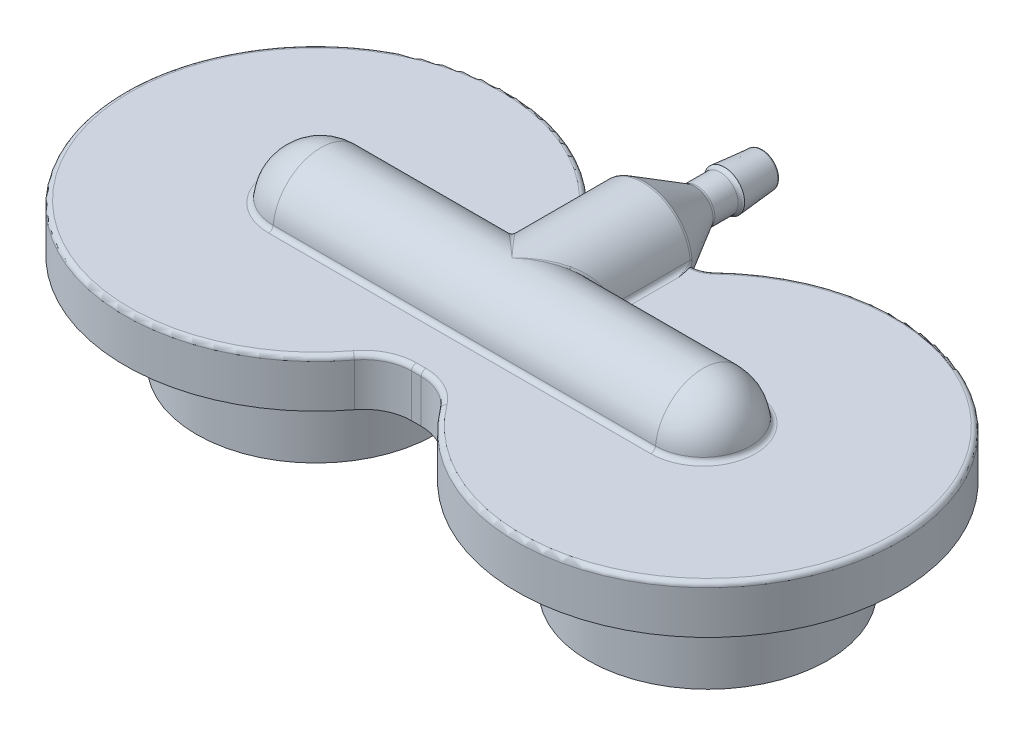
ISO-10303-21;
HEADER;
FILE_DESCRIPTION(('STEP AP214'),'2;1');
FILE_NAME('part.step','',(''),(''),'','','');
FILE_SCHEMA(('AUTOMOTIVE_DESIGN { 1 0 10303 214 1 1 1 1 }'));
ENDSEC;
DATA;
#1=APPLICATION_CONTEXT('core data for automotive mechanical design processes');
#2=APPLICATION_PROTOCOL_DEFINITION('international standard','automotive_design',2000,#1);
#3=PRODUCT_CONTEXT('',#1,'mechanical');
#4=PRODUCT('Part','Part','',(#3));
#5=PRODUCT_RELATED_PRODUCT_CATEGORY('part','',(#4));
#6=PRODUCT_DEFINITION_FORMATION('','',#4);
#7=PRODUCT_DEFINITION_CONTEXT('part definition',#1,'design');
#8=PRODUCT_DEFINITION('design','',#6,#7);
#9=PRODUCT_DEFINITION_SHAPE('','',#8);
#10=(LENGTH_UNIT() NAMED_UNIT(*) SI_UNIT(.MILLI.,.METRE.));
#11=(NAMED_UNIT(*) PLANE_ANGLE_UNIT() SI_UNIT($,.RADIAN.));
#12=(NAMED_UNIT(*) SI_UNIT($,.STERADIAN.) SOLID_ANGLE_UNIT());
#13=UNCERTAINTY_MEASURE_WITH_UNIT(LENGTH_MEASURE(1.E-05),#10,'distance_accuracy_value','');
#14=(GEOMETRIC_REPRESENTATION_CONTEXT(3) GLOBAL_UNCERTAINTY_ASSIGNED_CONTEXT((#13)) GLOBAL_UNIT_ASSIGNED_CONTEXT((#10,
#11,#12)) REPRESENTATION_CONTEXT('',''));
#15=CARTESIAN_POINT('',(0.,0.,0.));
#16=DIRECTION('',(0.,0.,1.));
#17=DIRECTION('',(1.,0.,0.));
#18=AXIS2_PLACEMENT_3D('',#15,#16,#17);
#19=CARTESIAN_POINT('',(-12.7,-12.7,-35.0761463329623));
#20=DIRECTION('',(0.,0.,-1.));
#21=DIRECTION('',(-1.,0.,0.));
#22=AXIS2_PLACEMENT_3D('',#19,#20,#21);
#23=PLANE('',#22);
#24=DIRECTION('',(0.,1.,0.));
#25=VECTOR('',#24,1.);
#26=CARTESIAN_POINT('',(-12.7,-12.7,-35.0761463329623));
#27=LINE('',#26,#25);
#28=CARTESIAN_POINT('',(-12.7,-12.7,-35.0761463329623));
#29=VERTEX_POINT('',#28);
#30=CARTESIAN_POINT('',(-12.7,-1.27,-35.0761463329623));
#31=VERTEX_POINT('',#30);
#32=EDGE_CURVE('E343',#29,#31,#27,.T.);
#33=ORIENTED_EDGE('',*,*,#32,.T.);
#34=CARTESIAN_POINT('',(-12.6390500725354,-1.24274424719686,-35.0761463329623));
#35=CARTESIAN_POINT('',(-12.6545172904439,-1.2496603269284,-35.0761463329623));
#36=CARTESIAN_POINT('',(-12.6699843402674,-1.25657678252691,-35.0761463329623));
#37=CARTESIAN_POINT('',(-12.6903008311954,-1.2656623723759,-35.0761463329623));
#38=CARTESIAN_POINT('',(-12.6951504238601,-1.26783116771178,-35.0761463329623));
#39=CARTESIAN_POINT('',(-12.7,-1.27,-35.0761463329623));
#40=B_SPLINE_CURVE_WITH_KNOTS('',3,(#34,#35,#36,#37,#38,#39),.UNSPECIFIED.,.F.,.F.,(4,2,4),(0.,
0.0508291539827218,0.0667665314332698),.UNSPECIFIED.);
#41=CARTESIAN_POINT('',(-12.6390500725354,-1.24274424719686,-35.0761463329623));
#42=VERTEX_POINT('',#41);
#43=EDGE_CURVE('E552',#31,#42,#40,.F.);
#44=ORIENTED_EDGE('',*,*,#43,.T.);
#45=CARTESIAN_POINT('',(0.,0.,-35.0761463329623));
#46=DIRECTION('',(0.,0.,1.));
#47=DIRECTION('',(1.,0.,0.));
#48=AXIS2_PLACEMENT_3D('',#45,#46,#47);
#49=CIRCLE('',#48,12.6999999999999);
#50=CARTESIAN_POINT('',(0.,-12.6999999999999,-35.0761463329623));
#51=VERTEX_POINT('',#50);
#52=EDGE_CURVE('E249',#42,#51,#49,.T.);
#53=ORIENTED_EDGE('',*,*,#52,.T.);
#54=DIRECTION('',(-1.,0.,0.));
#55=VECTOR('',#54,1.);
#56=CARTESIAN_POINT('',(-12.7,-12.7,-35.0761463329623));
#57=LINE('',#56,#55);
#58=EDGE_CURVE('E312',#51,#29,#57,.T.);
#59=ORIENTED_EDGE('',*,*,#58,.T.);
#60=EDGE_LOOP('',(#33,#44,#53,#59));
#61=FACE_BOUND('',#60,.T.);
#62=ADVANCED_FACE('F41',(#61),#23,.T.);
#63=CARTESIAN_POINT('',(12.6390500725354,-1.24274424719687,-35.0761463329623));
#64=VERTEX_POINT('',#63);
#65=EDGE_CURVE('E243',#51,#64,#49,.T.);
#66=ORIENTED_EDGE('',*,*,#65,.T.);
#67=CARTESIAN_POINT('',(12.6390500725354,-1.24274424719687,-35.0761463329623));
#68=CARTESIAN_POINT('',(12.6545172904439,-1.24966032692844,-35.0761463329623));
#69=CARTESIAN_POINT('',(12.6699843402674,-1.25657678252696,-35.0761463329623));
#70=CARTESIAN_POINT('',(12.6903008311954,-1.26566237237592,-35.0761463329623));
#71=CARTESIAN_POINT('',(12.6951504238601,-1.26783116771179,-35.0761463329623));
#72=CARTESIAN_POINT('',(12.7,-1.27,-35.0761463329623));
#73=B_SPLINE_CURVE_WITH_KNOTS('',3,(#67,#68,#69,#70,#71,#72),.UNSPECIFIED.,.F.,.F.,(4,2,4),(0.,
0.0508291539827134,0.0667665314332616),.UNSPECIFIED.);
#74=CARTESIAN_POINT('',(12.7,-1.27,-35.0761463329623));
#75=VERTEX_POINT('',#74);
#76=EDGE_CURVE('E575',#64,#75,#73,.T.);
#77=ORIENTED_EDGE('',*,*,#76,.T.);
#78=DIRECTION('',(0.,1.,0.));
#79=VECTOR('',#78,1.);
#80=CARTESIAN_POINT('',(12.7,-12.7,-35.0761463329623));
#81=LINE('',#80,#79);
#82=CARTESIAN_POINT('',(12.7,-12.7,-35.0761463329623));
#83=VERTEX_POINT('',#82);
#84=EDGE_CURVE('E346',#83,#75,#81,.T.);
#85=ORIENTED_EDGE('',*,*,#84,.F.);
#86=EDGE_CURVE('E313',#83,#51,#57,.T.);
#87=ORIENTED_EDGE('',*,*,#86,.T.);
#88=EDGE_LOOP('',(#66,#77,#85,#87));
#89=FACE_BOUND('',#88,.T.);
#90=ADVANCED_FACE('F567',(#89),#23,.T.);
#91=CARTESIAN_POINT('',(52.07,-38.1,0.));
#92=DIRECTION('',(0.,-1.,0.));
#93=DIRECTION('',(0.,0.,-1.));
#94=AXIS2_PLACEMENT_3D('',#91,#92,#93);
#95=PLANE('',#94);
#96=CARTESIAN_POINT('',(52.07,-38.1,0.));
#97=DIRECTION('',(0.,-1.,0.));
#98=DIRECTION('',(0.,0.,-1.));
#99=AXIS2_PLACEMENT_3D('',#96,#97,#98);
#100=CIRCLE('',#99,26.67);
#101=CARTESIAN_POINT('',(52.07,-38.1,-26.67));
#102=VERTEX_POINT('',#101);
#103=EDGE_CURVE('E256',#102,#102,#100,.T.);
#104=ORIENTED_EDGE('',*,*,#103,.F.);
#105=EDGE_LOOP('',(#104));
#106=FACE_BOUND('',#105,.T.);
#107=CARTESIAN_POINT('',(52.07,-38.1,0.));
#108=DIRECTION('',(0.,-1.,0.));
#109=DIRECTION('',(0.,0.,-1.));
#110=AXIS2_PLACEMENT_3D('',#107,#108,#109);
#111=CIRCLE('',#110,31.75);
#112=CARTESIAN_POINT('',(52.07,-38.1,-31.75));
#113=VERTEX_POINT('',#112);
#114=EDGE_CURVE('E294',#113,#113,#111,.T.);
#115=ORIENTED_EDGE('',*,*,#114,.T.);
#116=EDGE_LOOP('',(#115));
#117=FACE_BOUND('',#116,.T.);
#118=ADVANCED_FACE('F750',(#106,#117),#95,.T.);
#119=CARTESIAN_POINT('',(1.26999999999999,0.,38.1));
#120=DIRECTION('',(0.,1.,0.));
#121=DIRECTION('',(0.,0.,1.));
#122=AXIS2_PLACEMENT_3D('',#119,#120,#121);
#123=PLANE('',#122);
#124=CARTESIAN_POINT('',(-12.5126017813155,1.9605161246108,-35.136316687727));
#125=CARTESIAN_POINT('',(-12.6103615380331,1.85330481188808,-34.9977774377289));
#126=CARTESIAN_POINT('',(-12.650457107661,1.74302418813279,-34.8350663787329));
#127=CARTESIAN_POINT('',(-12.6905526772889,1.6327435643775,-34.672355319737));
#128=CARTESIAN_POINT('',(-12.6690796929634,1.53013237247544,-34.501316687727));
#129=CARTESIAN_POINT('',(-12.50519259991,1.91915388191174,-35.1600843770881));
#130=CARTESIAN_POINT('',(-12.6020316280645,1.81780247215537,-35.0208924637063));
#131=CARTESIAN_POINT('',(-12.642974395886,1.71332721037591,-34.8583140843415));
#132=CARTESIAN_POINT('',(-12.6839229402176,1.60887627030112,-34.695717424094));
#133=CARTESIAN_POINT('',(-12.6651081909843,1.51115481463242,-34.5250843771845));
#134=CARTESIAN_POINT('',(-12.4984890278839,1.87669923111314,-35.1826147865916));
#135=CARTESIAN_POINT('',(-12.5944060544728,1.78132241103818,-35.0428178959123));
#136=CARTESIAN_POINT('',(-12.6361091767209,1.68280532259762,-34.880354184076));
#137=CARTESIAN_POINT('',(-12.677816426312,1.58430968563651,-34.7178765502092));
#138=CARTESIAN_POINT('',(-12.6614885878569,1.49168912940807,-34.5476147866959));
#139=CARTESIAN_POINT('',(-12.4867064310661,1.78954704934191,-35.2247233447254));
#140=CARTESIAN_POINT('',(-12.5807971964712,1.70640201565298,-35.0837959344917));
#141=CARTESIAN_POINT('',(-12.6238131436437,1.62008240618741,-34.9215500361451));
#142=CARTESIAN_POINT('',(-12.6668332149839,1.53378343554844,-34.7592904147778));
#143=CARTESIAN_POINT('',(-12.6550628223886,1.45175518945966,-34.5897233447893));
#144=CARTESIAN_POINT('',(-12.4816335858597,1.7448417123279,-35.2442901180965));
#145=CARTESIAN_POINT('',(-12.5748183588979,1.66795230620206,-35.1028415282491));
#146=CARTESIAN_POINT('',(-12.6183877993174,1.5878755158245,-34.9406946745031));
#147=CARTESIAN_POINT('',(-12.6619598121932,1.50781722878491,-34.778538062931));
#148=CARTESIAN_POINT('',(-12.6522597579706,1.43128345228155,-34.6092901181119));
#149=CARTESIAN_POINT('',(-12.4733842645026,1.65343514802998,-35.2798097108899));
#150=CARTESIAN_POINT('',(-12.5647918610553,1.58931412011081,-35.1374142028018));
#151=CARTESIAN_POINT('',(-12.6092297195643,1.52197246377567,-34.9754504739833));
#152=CARTESIAN_POINT('',(-12.6536701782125,1.45464952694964,-34.813476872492));
#153=CARTESIAN_POINT('',(-12.6476079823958,1.38945106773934,-34.6448097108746));
#154=CARTESIAN_POINT('',(-12.4702080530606,1.60673364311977,-35.2957620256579));
#155=CARTESIAN_POINT('',(-12.5607427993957,1.54912183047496,-35.1529447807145));
#156=CARTESIAN_POINT('',(-12.6054972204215,1.4882760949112,-34.9910611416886));
#157=CARTESIAN_POINT('',(-12.6502528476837,1.42744547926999,-34.829171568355));
#158=CARTESIAN_POINT('',(-12.6457594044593,1.36809029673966,-34.6607620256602));
#159=CARTESIAN_POINT('',(-12.4659951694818,1.51173677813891,-35.3234196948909));
#160=CARTESIAN_POINT('',(-12.5548372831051,1.46735946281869,-35.1798694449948));
#161=CARTESIAN_POINT('',(-12.5999592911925,1.41970270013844,-35.0181278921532));
#162=CARTESIAN_POINT('',(-12.6450825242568,1.37206092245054,-34.8563803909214));
#163=CARTESIAN_POINT('',(-12.643143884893,1.32466276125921,-34.6884196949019));
#164=CARTESIAN_POINT('',(-12.4649545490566,1.46344452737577,-35.3351328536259));
#165=CARTESIAN_POINT('',(-12.552975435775,1.42578726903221,-35.1912747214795));
#166=CARTESIAN_POINT('',(-12.5981503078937,1.38482797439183,-35.029591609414));
#167=CARTESIAN_POINT('',(-12.6433253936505,1.34387907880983,-34.8679058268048));
#168=CARTESIAN_POINT('',(-12.642374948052,1.30259737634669,-34.7001328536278));
#169=CARTESIAN_POINT('',(-12.4651846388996,1.3692414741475,-35.3531347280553));
#170=CARTESIAN_POINT('',(-12.5516885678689,1.34470334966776,-35.2088016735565));
#171=CARTESIAN_POINT('',(-12.5966906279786,1.31679195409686,-35.0472106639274));
#172=CARTESIAN_POINT('',(-12.6416928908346,1.28888959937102,-34.8856172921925));
#173=CARTESIAN_POINT('',(-12.6420272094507,1.25957395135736,-34.7181347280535));
#174=CARTESIAN_POINT('',(-12.4662931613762,1.3234120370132,-35.3597552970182));
#175=CARTESIAN_POINT('',(-12.5520959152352,1.30525671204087,-35.2152487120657));
#176=CARTESIAN_POINT('',(-12.596892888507,1.28368987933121,-35.0536907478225));
#177=CARTESIAN_POINT('',(-12.6416897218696,1.26212772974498,-34.8921321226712));
#178=CARTESIAN_POINT('',(-12.6423661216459,1.23865169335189,-34.7247552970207));
#179=CARTESIAN_POINT('',(-12.4705801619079,1.23139052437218,-35.3686131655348));
#180=CARTESIAN_POINT('',(-12.5550525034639,1.22607581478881,-35.2238734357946));
#181=CARTESIAN_POINT('',(-12.5991871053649,1.21723906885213,-35.0623607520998));
#182=CARTESIAN_POINT('',(-12.643321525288,1.20840696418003,-34.90084751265));
#183=CARTESIAN_POINT('',(-12.6440983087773,1.1966555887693,-34.7336131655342));
#184=CARTESIAN_POINT('',(-12.473755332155,1.1851991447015,-35.3708574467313));
#185=CARTESIAN_POINT('',(-12.5575982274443,1.1863367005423,-35.2260591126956));
#186=CARTESIAN_POINT('',(-12.6012760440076,1.18389081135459,-35.0645575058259));
#187=CARTESIAN_POINT('',(-12.6449537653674,1.18144477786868,-34.9030561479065));
#188=CARTESIAN_POINT('',(-12.6454898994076,1.17558203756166,-34.7358574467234));
#189=CARTESIAN_POINT('',(-12.4846474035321,1.0659659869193,-35.3708404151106));
#190=CARTESIAN_POINT('',(-12.5669657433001,1.08381000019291,-35.2260421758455));
#191=CARTESIAN_POINT('',(-12.6091368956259,1.09785738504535,-35.0645408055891));
#192=CARTESIAN_POINT('',(-12.6513082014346,1.11190497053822,-34.9030390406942));
#193=CARTESIAN_POINT('',(-12.6504583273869,1.12119852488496,-34.7358404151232));
#194=CARTESIAN_POINT('',(-12.4939347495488,0.993029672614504,-35.365173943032));
#195=CARTESIAN_POINT('',(-12.5754198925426,1.02112482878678,-35.2205228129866));
#196=CARTESIAN_POINT('',(-12.6163486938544,1.04527642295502,-35.0589942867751));
#197=CARTESIAN_POINT('',(-12.6572809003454,1.06941000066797,-34.8974617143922));
#198=CARTESIAN_POINT('',(-12.6548374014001,1.08794448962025,-34.7301739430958));
#199=CARTESIAN_POINT('',(-12.5172239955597,0.849951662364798,-35.3431622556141));
#200=CARTESIAN_POINT('',(-12.5972505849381,0.898313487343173,-35.1990916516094));
#201=CARTESIAN_POINT('',(-12.6351253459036,0.94230029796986,-35.0374501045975));
#202=CARTESIAN_POINT('',(-12.6730032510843,0.986269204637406,-34.8758050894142));
#203=CARTESIAN_POINT('',(-12.6660164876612,1.02272119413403,-34.7081622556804));
#204=CARTESIAN_POINT('',(-12.5312371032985,0.779817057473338,-35.326791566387));
#205=CARTESIAN_POINT('',(-12.6106442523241,0.838173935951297,-35.1831477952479));
#206=CARTESIAN_POINT('',(-12.6467005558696,0.891910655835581,-35.021427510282));
#207=CARTESIAN_POINT('',(-12.6827658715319,0.945614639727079,-34.8596933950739));
#208=CARTESIAN_POINT('',(-12.672822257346,0.990755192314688,-34.6917915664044));
#209=CARTESIAN_POINT('',(-12.5670920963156,0.626997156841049,-35.2797837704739));
#210=CARTESIAN_POINT('',(-12.6453163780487,0.707338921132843,-35.1373829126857));
#211=CARTESIAN_POINT('',(-12.6767540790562,0.78237542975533,-34.9754245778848));
#212=CARTESIAN_POINT('',(-12.7082054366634,0.857362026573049,-34.8134453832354));
#213=CARTESIAN_POINT('',(-12.6903664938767,0.921099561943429,-34.6447837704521));
#214=CARTESIAN_POINT('',(-12.5900161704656,0.545580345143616,-35.2465971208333));
#215=CARTESIAN_POINT('',(-12.6677391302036,0.637771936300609,-35.1050670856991));
#216=CARTESIAN_POINT('',(-12.6962358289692,0.724206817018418,-34.9429502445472));
#217=CARTESIAN_POINT('',(-12.724758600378,0.810575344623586,-34.7807876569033));
#218=CARTESIAN_POINT('',(-12.7016633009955,0.88398726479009,-34.6115971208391));
#219=CARTESIAN_POINT('',(-12.6401408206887,0.390809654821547,-35.1697855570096));
#220=CARTESIAN_POINT('',(-12.7170735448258,0.50586294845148,-35.0303165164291));
#221=CARTESIAN_POINT('',(-12.7391601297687,0.614062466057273,-34.8678025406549));
#222=CARTESIAN_POINT('',(-12.7612731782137,0.722193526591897,-34.7052423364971));
#223=CARTESIAN_POINT('',(-12.7264726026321,0.813415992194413,-34.5347855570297));
#224=CARTESIAN_POINT('',(-12.6673493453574,0.317471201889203,-35.1261411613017));
#225=CARTESIAN_POINT('',(-12.744007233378,0.44352184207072,-34.9878380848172));
#226=CARTESIAN_POINT('',(-12.7626100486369,0.562098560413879,-34.8251101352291));
#227=CARTESIAN_POINT('',(-12.7812511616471,0.68060008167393,-34.6623105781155));
#228=CARTESIAN_POINT('',(-12.7399892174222,0.779964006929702,-34.4911411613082));
#229=CARTESIAN_POINT('',(-12.7434774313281,0.133099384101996,-35.0005542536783));
#230=CARTESIAN_POINT('',(-12.8196216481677,0.287189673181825,-34.8656178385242));
#231=CARTESIAN_POINT('',(-12.8284360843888,0.432089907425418,-34.7022928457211));
#232=CARTESIAN_POINT('',(-12.8373522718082,0.576788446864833,-34.5387782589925));
#233=CARTESIAN_POINT('',(-12.7778958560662,0.69582368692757,-34.3655542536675));
#234=CARTESIAN_POINT('',(-12.7949665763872,0.0287476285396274,-34.9122212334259));
#235=CARTESIAN_POINT('',(-12.8709934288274,0.199250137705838,-34.7796832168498));
#236=CARTESIAN_POINT('',(-12.873166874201,0.35918966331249,-34.6159366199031));
#237=CARTESIAN_POINT('',(-12.8754809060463,0.51893100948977,-34.4519137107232));
#238=CARTESIAN_POINT('',(-12.8036197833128,0.64815526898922,-34.2772212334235));
#239=CARTESIAN_POINT('',(-12.9026317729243,-0.162696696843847,-34.7240113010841));
#240=CARTESIAN_POINT('',(-12.9785298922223,0.0388877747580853,-34.5967777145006));
#241=CARTESIAN_POINT('',(-12.966748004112,0.226784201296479,-34.432033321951));
#242=CARTESIAN_POINT('',(-12.9551106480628,0.414475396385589,-34.2670049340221));
#243=CARTESIAN_POINT('',(-12.857495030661,0.560603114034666,-34.0890113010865));
#244=CARTESIAN_POINT('',(-12.9588200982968,-0.249741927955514,-34.6241038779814));
#245=CARTESIAN_POINT('',(-13.0347420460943,-0.0334749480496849,-34.499709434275));
#246=CARTESIAN_POINT('',(-13.0156091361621,0.167315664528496,-34.3344566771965));
#247=CARTESIAN_POINT('',(-12.9966458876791,0.367923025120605,-34.1688621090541));
#248=CARTESIAN_POINT('',(-12.8856527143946,0.520740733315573,-33.9891038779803));
#249=CARTESIAN_POINT('',(-13.0749003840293,-0.410834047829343,-34.4160392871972));
#250=CARTESIAN_POINT('',(-13.1508331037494,-0.166380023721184,-34.297748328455));
#251=CARTESIAN_POINT('',(-13.1163884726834,0.0586646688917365,-34.1313673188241));
#252=CARTESIAN_POINT('',(-13.0821181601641,0.283521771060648,-33.9646349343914));
#253=CARTESIAN_POINT('',(-12.9438621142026,0.446869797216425,-33.7810392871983));
#254=CARTESIAN_POINT('',(-13.1348278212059,-0.484717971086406,-34.3077996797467));
#255=CARTESIAN_POINT('',(-13.2107708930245,-0.226746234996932,-34.1927310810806));
#256=CARTESIAN_POINT('',(-13.1683356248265,0.00960989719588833,-34.0257754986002));
#257=CARTESIAN_POINT('',(-13.1260940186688,0.245802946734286,-33.8584243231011));
#258=CARTESIAN_POINT('',(-12.9739320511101,0.412934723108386,-33.6727996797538));
#259=CARTESIAN_POINT('',(-13.256956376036,-0.620843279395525,-34.0865822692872));
#260=CARTESIAN_POINT('',(-13.3327799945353,-0.336866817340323,-33.9783095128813));
#261=CARTESIAN_POINT('',(-13.2738980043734,-0.0792688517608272,-33.8101190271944));
#262=CARTESIAN_POINT('',(-13.215211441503,0.178164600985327,-33.6415292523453));
#263=CARTESIAN_POINT('',(-13.0352244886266,0.350317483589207,-33.4515822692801));
#264=CARTESIAN_POINT('',(-13.3191596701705,-0.683073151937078,-33.9735999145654));
#265=CARTESIAN_POINT('',(-13.3948728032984,-0.386581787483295,-33.868864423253));
#266=CARTESIAN_POINT('',(-13.3275148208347,-0.119083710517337,-33.7000500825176));
#267=CARTESIAN_POINT('',(-13.2603668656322,0.148275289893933,-33.5308033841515));
#268=CARTESIAN_POINT('',(-13.0664480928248,0.321640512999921,-33.3385999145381));
#269=CARTESIAN_POINT('',(-13.4454610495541,-0.797762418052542,-33.7441995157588));
#270=CARTESIAN_POINT('',(-13.5207414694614,-0.477016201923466,-33.646874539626));
#271=CARTESIAN_POINT('',(-13.4359811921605,-0.190862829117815,-33.4767418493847));
#272=CARTESIAN_POINT('',(-13.3514328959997,0.0951503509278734,-33.3061726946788));
#273=CARTESIAN_POINT('',(-13.1298425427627,0.268701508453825,-33.1091995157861));
#274=CARTESIAN_POINT('',(-13.5095635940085,-0.850196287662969,-33.6277733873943));
#275=CARTESIAN_POINT('',(-13.5845365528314,-0.517683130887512,-33.5342949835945));
#276=CARTESIAN_POINT('',(-13.4908335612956,-0.222806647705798,-33.363495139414));
#277=CARTESIAN_POINT('',(-13.3973544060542,0.0719544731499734,-33.1922324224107));
#278=CARTESIAN_POINT('',(-13.1620156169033,0.244451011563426,-32.9927733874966));
#279=CARTESIAN_POINT('',(-13.6392157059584,-0.946353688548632,-33.3926994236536));
#280=CARTESIAN_POINT('',(-13.7133042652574,-0.590943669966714,-33.3072427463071));
#281=CARTESIAN_POINT('',(-13.6012965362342,-0.279646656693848,-33.1350477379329));
#282=CARTESIAN_POINT('',(-13.4895142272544,0.0315345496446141,-32.9623864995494));
#283=CARTESIAN_POINT('',(-13.227074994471,0.199897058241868,-32.7576994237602));
#284=CARTESIAN_POINT('',(-13.7047657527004,-0.9900742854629,-33.2740508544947));
#285=CARTESIAN_POINT('',(-13.7782907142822,-0.623506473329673,-33.1927465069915));
#286=CARTESIAN_POINT('',(-13.6569073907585,-0.304540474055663,-33.0198464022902));
#287=CARTESIAN_POINT('',(-13.535760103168,0.0143342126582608,-32.8464567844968));
#288=CARTESIAN_POINT('',(-13.2599615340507,0.179594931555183,-32.6390508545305));
#289=CARTESIAN_POINT('',(-13.8943841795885,-1.10418414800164,-32.9318070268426));
#290=CARTESIAN_POINT('',(-13.9661780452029,-0.706522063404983,-32.8622892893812));
#291=CARTESIAN_POINT('',(-13.8169864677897,-0.366748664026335,-32.6878894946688));
#292=CARTESIAN_POINT('',(-13.6686185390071,-0.0272961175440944,-32.5117817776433));
#293=CARTESIAN_POINT('',(-13.3550664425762,0.126497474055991,-32.2968070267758));
#294=CARTESIAN_POINT('',(-14.0199847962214,-1.16489334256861,-32.7062817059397));
#295=CARTESIAN_POINT('',(-14.0899307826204,-0.747636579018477,-32.6453290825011));
#296=CARTESIAN_POINT('',(-13.9220724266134,-0.396158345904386,-32.4695571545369));
#297=CARTESIAN_POINT('',(-13.7550944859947,-0.0448453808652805,-32.2919541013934));
#298=CARTESIAN_POINT('',(-13.418030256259,0.0981025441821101,-32.0712817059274));
#299=CARTESIAN_POINT('',(-14.2745345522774,-1.26257459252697,-32.2525290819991));
#300=CARTESIAN_POINT('',(-14.3393293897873,-0.807462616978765,-32.2101324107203));
#301=CARTESIAN_POINT('',(-14.1326802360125,-0.435376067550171,-32.0313745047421));
#302=CARTESIAN_POINT('',(-13.9269225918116,-0.0634541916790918,-31.8507611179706));
#303=CARTESIAN_POINT('',(-13.5455555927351,0.0521776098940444,-31.6175290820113));
#304=CARTESIAN_POINT('',(-14.4034862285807,-1.29952808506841,-32.0242998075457));
#305=CARTESIAN_POINT('',(-14.4650437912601,-0.825978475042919,-31.9917951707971));
#306=CARTESIAN_POINT('',(-14.2382023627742,-0.445168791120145,-31.8115231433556));
#307=CARTESIAN_POINT('',(-14.0122994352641,-0.0643645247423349,-31.6292913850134));
#308=CARTESIAN_POINT('',(-13.610118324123,0.0346561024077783,-31.3892998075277));
#309=CARTESIAN_POINT('',(-14.6636997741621,-1.35104029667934,-31.5673561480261));
#310=CARTESIAN_POINT('',(-14.7169936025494,-0.841754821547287,-31.5563507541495));
#311=CARTESIAN_POINT('',(-14.4482750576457,-0.446274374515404,-31.3728073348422));
#312=CARTESIAN_POINT('',(-14.1804999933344,-0.0507984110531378,-31.187293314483));
#313=CARTESIAN_POINT('',(-13.7403197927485,0.00993825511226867,-30.932356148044));
#314=CARTESIAN_POINT('',(-14.79495739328,-1.3656365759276,-31.3386432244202));
#315=CARTESIAN_POINT('',(-14.8432938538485,-0.838863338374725,-31.3391471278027));
#316=CARTESIAN_POINT('',(-14.5528269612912,-0.43761828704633,-31.1539418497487));
#317=CARTESIAN_POINT('',(-14.2633457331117,-0.0362059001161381,-30.9666648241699));
#318=CARTESIAN_POINT('',(-13.8059565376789,0.0027245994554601,-30.7036432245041));
#319=CARTESIAN_POINT('',(-15.0591670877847,-1.37274674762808,-30.8818073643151));
#320=CARTESIAN_POINT('',(-15.0953711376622,-0.812092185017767,-30.9075228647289));
#321=CARTESIAN_POINT('',(-14.7597895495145,-0.40222273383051,-30.7187305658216));
#322=CARTESIAN_POINT('',(-14.4252014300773,0.00781787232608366,-30.527848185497));
#323=CARTESIAN_POINT('',(-13.938004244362,-0.00145354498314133,-30.246807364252));
#324=CARTESIAN_POINT('',(-15.1921185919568,-1.36526789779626,-30.653684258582));
#325=CARTESIAN_POINT('',(-15.2212098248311,-0.788009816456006,-30.6930142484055));
#326=CARTESIAN_POINT('',(-14.8622009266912,-0.37548921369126,-30.5023839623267));
#327=CARTESIAN_POINT('',(-14.5042183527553,0.0373990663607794,-30.3095669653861));
#328=CARTESIAN_POINT('',(-14.0044149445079,0.0015785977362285,-30.018684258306));
#329=CARTESIAN_POINT('',(-15.4245090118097,-1.33221870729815,-30.2577224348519));
#330=CARTESIAN_POINT('',(-15.438466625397,-0.727294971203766,-30.3238101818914));
#331=CARTESIAN_POINT('',(-15.0373933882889,-0.312907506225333,-30.1292329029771));
#332=CARTESIAN_POINT('',(-14.6368928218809,0.101683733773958,-29.9334363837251));
#333=CARTESIAN_POINT('',(-14.1204436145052,0.0162066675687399,-29.6227224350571));
#334=CARTESIAN_POINT('',(-15.5237880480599,-1.31178636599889,-30.0894437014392));
#335=CARTESIAN_POINT('',(-15.5306660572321,-0.695295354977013,-30.1674982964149));
#336=CARTESIAN_POINT('',(-15.1110310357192,-0.281161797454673,-29.9714026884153));
#337=CARTESIAN_POINT('',(-14.6919770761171,0.133268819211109,-29.7740504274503));
#338=CARTESIAN_POINT('',(-14.1699952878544,0.0254039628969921,-29.4544437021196));
#339=CARTESIAN_POINT('',(-15.7221707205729,-1.25748774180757,-29.7546989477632));
#340=CARTESIAN_POINT('',(-15.7130164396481,-0.618865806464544,-29.8587085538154));
#341=CARTESIAN_POINT('',(-15.2552506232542,-0.207304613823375,-29.6594111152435));
#342=CARTESIAN_POINT('',(-14.7980694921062,0.204556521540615,-29.4588484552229));
#343=CARTESIAN_POINT('',(-14.268984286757,0.0500927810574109,-29.1196989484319));
#344=CARTESIAN_POINT('',(-15.821274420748,-1.22362836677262,-29.5882320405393));
#345=CARTESIAN_POINT('',(-15.8031878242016,-0.574325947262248,-29.7061988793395));
#346=CARTESIAN_POINT('',(-15.3258341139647,-0.16519847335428,-29.5052479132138));
#347=CARTESIAN_POINT('',(-14.8490675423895,0.244335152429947,-29.3029973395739));
#348=CARTESIAN_POINT('',(-14.3184216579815,0.0655810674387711,-28.9532320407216));
#349=CARTESIAN_POINT('',(-16.0186138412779,-1.14135766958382,-29.2579257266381));
#350=CARTESIAN_POINT('',(-15.9803502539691,-0.472180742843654,-29.4064220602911));
#351=CARTESIAN_POINT('',(-15.4627736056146,-0.0703159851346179,-29.2019791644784));
#352=CARTESIAN_POINT('',(-14.9457868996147,0.331958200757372,-28.996229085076));
#353=CARTESIAN_POINT('',(-14.4168446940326,0.103395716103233,-28.6229257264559));
#354=CARTESIAN_POINT('',(-16.1168499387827,-1.09295302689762,-29.0940851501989));
#355=CARTESIAN_POINT('',(-16.0673552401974,-0.41444511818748,-29.259130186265));
#356=CARTESIAN_POINT('',(-15.5291315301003,-0.0175445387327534,-29.0528713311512));
#357=CARTESIAN_POINT('',(-14.9914867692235,0.379888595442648,-28.8452831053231));
#358=CARTESIAN_POINT('',(-14.4658305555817,0.125718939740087,-28.4590851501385));
#359=CARTESIAN_POINT('',(-16.2628629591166,-1.0081883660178,-28.8510629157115));
#360=CARTESIAN_POINT('',(-16.1940438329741,-0.31770076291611,-29.0440333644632));
#361=CARTESIAN_POINT('',(-15.6243317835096,0.0698227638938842,-28.8344077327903));
#362=CARTESIAN_POINT('',(-15.0547664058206,0.457480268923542,-28.6244459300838));
#363=CARTESIAN_POINT('',(-14.5386343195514,0.164929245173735,-28.2160629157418));
#364=CARTESIAN_POINT('',(-16.3113477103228,-0.977878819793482,-28.7704501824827));
#365=CARTESIAN_POINT('',(-16.2358128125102,-0.283591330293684,-28.9730074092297));
#366=CARTESIAN_POINT('',(-15.6553649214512,0.100340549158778,-28.762398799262));
#367=CARTESIAN_POINT('',(-15.075059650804,0.484423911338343,-28.5514541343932));
#368=CARTESIAN_POINT('',(-14.5628083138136,0.178966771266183,-28.1354501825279));
#369=CARTESIAN_POINT('',(-16.4076870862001,-0.912919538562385,-28.6103530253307));
#370=CARTESIAN_POINT('',(-16.3178935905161,-0.21181381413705,-28.8331007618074));
#371=CARTESIAN_POINT('',(-15.7157086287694,0.164114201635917,-28.6204786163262));
#372=CARTESIAN_POINT('',(-15.1136681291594,0.540194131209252,-28.4075173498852));
#373=CARTESIAN_POINT('',(-14.610841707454,0.209087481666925,-27.9753530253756));
#374=CARTESIAN_POINT('',(-16.4555415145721,-0.878268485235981,-28.5308689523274));
#375=CARTESIAN_POINT('',(-16.3582032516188,-0.174123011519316,-28.7642219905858));
#376=CARTESIAN_POINT('',(-15.7450186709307,0.197370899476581,-28.5505680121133));
#377=CARTESIAN_POINT('',(-15.1319757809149,0.569033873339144,-28.3365735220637));
#378=CARTESIAN_POINT('',(-14.6347010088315,0.225171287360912,-27.8958689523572));
#379=CARTESIAN_POINT('',(-16.5029878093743,-0.841310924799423,-28.452058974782));
#380=CARTESIAN_POINT('',(-16.3975423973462,-0.134710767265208,-28.6967699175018));
#381=CARTESIAN_POINT('',(-15.7733296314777,0.231991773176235,-28.4818894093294));
#382=CARTESIAN_POINT('',(-15.1491168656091,0.598694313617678,-28.2670089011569));
#383=CARTESIAN_POINT('',(-14.6583574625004,0.242343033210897,-27.817058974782));
#384=(BOUNDED_SURFACE() B_SPLINE_SURFACE(3,2,((#124,#125,#126,#127,#128),(#129,#130,#131,#132,
#133),(#134,#135,#136,#137,#138),(#139,#140,#141,#142,#143),(#144,#145,#146,#147,#148),(#149,
#150,#151,#152,#153),(#154,#155,#156,#157,#158),(#159,#160,#161,#162,#163),(#164,#165,#166,#167,
#168),(#169,#170,#171,#172,#173),(#174,#175,#176,#177,#178),(#179,#180,#181,#182,#183),(#184,
#185,#186,#187,#188),(#189,#190,#191,#192,#193),(#194,#195,#196,#197,#198),(#199,#200,#201,#202,
#203),(#204,#205,#206,#207,#208),(#209,#210,#211,#212,#213),(#214,#215,#216,#217,#218),(#219,
#220,#221,#222,#223),(#224,#225,#226,#227,#228),(#229,#230,#231,#232,#233),(#234,#235,#236,#237,
#238),(#239,#240,#241,#242,#243),(#244,#245,#246,#247,#248),(#249,#250,#251,#252,#253),(#254,
#255,#256,#257,#258),(#259,#260,#261,#262,#263),(#264,#265,#266,#267,#268),(#269,#270,#271,#272,
#273),(#274,#275,#276,#277,#278),(#279,#280,#281,#282,#283),(#284,#285,#286,#287,#288),(#289,
#290,#291,#292,#293),(#294,#295,#296,#297,#298),(#299,#300,#301,#302,#303),(#304,#305,#306,#307,
#308),(#309,#310,#311,#312,#313),(#314,#315,#316,#317,#318),(#319,#320,#321,#322,#323),(#324,
#325,#326,#327,#328),(#329,#330,#331,#332,#333),(#334,#335,#336,#337,#338),(#339,#340,#341,#342,
#343),(#344,#345,#346,#347,#348),(#349,#350,#351,#352,#353),(#354,#355,#356,#357,#358),(#359,
#360,#361,#362,#363),(#364,#365,#366,#367,#368),(#369,#370,#371,#372,#373),(#374,#375,#376,#377,
#378),(#379,#380,#381,#382,#383)),.UNSPECIFIED.,.F.,.F.,.F.) B_SPLINE_SURFACE_WITH_KNOTS((4,2,2,
2,2,2,2,2,2,2,2,2,2,2,2,2,2,2,2,2,2,2,2,2,2,4),(3,2,3),(0.,0.136480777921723,0.273472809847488,
0.410483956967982,0.547241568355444,0.674078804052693,0.800713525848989,1.00145331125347,
1.20267256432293,1.45439924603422,1.70659856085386,2.1235890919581,2.54170498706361,
2.96468416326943,3.3880790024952,3.81256208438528,4.23718787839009,5.02942371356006,
5.8222778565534,6.61379853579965,7.40505901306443,7.99316339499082,8.58096560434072,
9.16849829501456,9.46272364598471,9.75703855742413),(0.,0.5,1.),
.UNSPECIFIED.) GEOMETRIC_REPRESENTATION_ITEM() RATIONAL_B_SPLINE_SURFACE(((1.,0.987752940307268,
1.,0.987752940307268,1.),(1.,0.988128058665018,1.,0.988128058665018,1.),(1.,0.988483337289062,
1.,0.988483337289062,1.),(1.,0.98914690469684,1.,0.98914690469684,1.),(1.,0.989455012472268,1.,
0.989455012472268,1.),(1.,0.990014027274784,1.,0.990014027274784,1.),(1.,0.990264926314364,1.,
0.990264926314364,1.),(1.,0.990699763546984,1.,0.990699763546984,1.),(1.,0.990883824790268,1.,
0.990883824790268,1.),(1.,0.991166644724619,1.,0.991166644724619,1.),(1.,0.991270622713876,1.,
0.991270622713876,1.),(1.,0.99140972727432,1.,0.99140972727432,1.),(1.,0.991444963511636,1.,
0.991444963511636,1.),(1.,0.9914446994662,1.,0.9914446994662,1.),(1.,0.99135573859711,1.,
0.99135573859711,1.),(1.,0.991009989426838,1.,0.991009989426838,1.),(1.,0.990752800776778,1.,
0.990752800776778,1.),(1.,0.990013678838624,1.,0.990013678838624,1.),(1.,0.989491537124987,1.,
0.989491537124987,1.),(1.,0.988281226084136,1.,0.988281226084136,1.),(1.,0.98759274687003,1.,
0.98759274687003,1.),(1.,0.985607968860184,1.,0.985607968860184,1.),(1.,0.984208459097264,1.,
0.984208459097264,1.),(1.,0.981214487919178,1.,0.981214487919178,1.),(1.,0.979619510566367,1.,
0.979619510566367,1.),(1.,0.976281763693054,1.,0.976281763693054,1.),(1.,0.974537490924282,1.,
0.974537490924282,1.),(1.,0.970952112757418,1.,0.970952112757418,1.),(1.,0.969110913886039,1.,
0.969110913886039,1.),(1.,0.965347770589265,1.,0.965347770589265,1.),(1.,0.963425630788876,1.,
0.963425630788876,1.),(1.,0.959515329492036,1.,0.959515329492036,1.),(1.,0.957527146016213,1.,
0.957527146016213,1.),(1.,0.951743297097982,1.,0.951743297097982,1.),(1.,0.94787295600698,1.,
0.94787295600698,1.),(1.,0.939931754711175,1.,0.939931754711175,1.),(1.,0.935860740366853,1.,
0.935860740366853,1.),(1.,0.927514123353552,1.,0.927514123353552,1.),(1.,0.923238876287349,1.,
0.923238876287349,1.),(1.,0.914452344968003,1.,0.914452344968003,1.),(1.,0.909941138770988,1.,
0.909941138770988,1.),(1.,0.901837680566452,1.,0.901837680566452,1.),(1.,0.898306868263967,1.,
0.898306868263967,1.),(1.,0.89107504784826,1.,0.89107504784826,1.),(1.,0.887374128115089,1.,
0.887374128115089,1.),(1.,0.87977931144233,1.,0.87977931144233,1.),(1.,0.875885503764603,1.,
0.875885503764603,1.),(1.,0.869880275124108,1.,0.869880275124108,1.),(1.,0.867849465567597,1.,
0.867849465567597,1.),(1.,0.863730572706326,1.,0.863730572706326,1.),(1.,0.861642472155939,1.,
0.861642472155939,1.),(1.,0.859524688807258,1.,0.859524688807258,1.))) REPRESENTATION_ITEM('') SURFACE());
#385=CARTESIAN_POINT('',(-12.812300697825,0.,-34.8816358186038));
#386=CARTESIAN_POINT('',(-12.8422650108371,0.,-34.8297134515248));
#387=CARTESIAN_POINT('',(-12.8705754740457,0.,-34.7768754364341));
#388=CARTESIAN_POINT('',(-12.9242843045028,0.,-34.6697966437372));
#389=CARTESIAN_POINT('',(-12.9496853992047,0.,-34.6155572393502));
#390=CARTESIAN_POINT('',(-12.997941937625,0.,-34.5061954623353));
#391=CARTESIAN_POINT('',(-13.0208059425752,0.,-34.4510768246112));
#392=CARTESIAN_POINT('',(-13.0644639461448,0.,-34.3400137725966));
#393=CARTESIAN_POINT('',(-13.0852573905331,0.,-34.2840691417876));
#394=CARTESIAN_POINT('',(-13.1447421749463,0.,-34.1161164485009));
#395=CARTESIAN_POINT('',(-13.1808723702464,0.,-34.0032029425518));
#396=CARTESIAN_POINT('',(-13.2482887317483,0.,-33.7758429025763));
#397=CARTESIAN_POINT('',(-13.2795694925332,0.,-33.66139481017));
#398=CARTESIAN_POINT('',(-13.3427149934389,0.,-33.4156101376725));
#399=CARTESIAN_POINT('',(-13.374055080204,0.,-33.2841399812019));
#400=CARTESIAN_POINT('',(-13.4335540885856,0.,-33.0204785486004));
#401=CARTESIAN_POINT('',(-13.4617126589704,0.,-32.8882871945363));
#402=CARTESIAN_POINT('',(-13.5157185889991,0.,-32.6234544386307));
#403=CARTESIAN_POINT('',(-13.5415662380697,0.,-32.4908130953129));
#404=CARTESIAN_POINT('',(-13.5916904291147,0.,-32.2252428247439));
#405=CARTESIAN_POINT('',(-13.6159670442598,0.,-32.0923139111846));
#406=CARTESIAN_POINT('',(-13.6872490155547,0.,-31.6923519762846));
#407=CARTESIAN_POINT('',(-13.7325358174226,0.,-31.4250149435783));
#408=CARTESIAN_POINT('',(-13.8214924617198,0.,-30.8900985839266));
#409=CARTESIAN_POINT('',(-13.8651624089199,0.,-30.6225192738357));
#410=CARTESIAN_POINT('',(-13.910122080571,0.,-30.3488030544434));
#411=CARTESIAN_POINT('',(-13.9111374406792,0.,-30.3426224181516));
#412=CARTESIAN_POINT('',(-13.9121529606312,0.,-30.3364418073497));
#413=B_SPLINE_CURVE_WITH_KNOTS('',3,(#385,#386,#387,#388,#389,#390,#391,#392,#393,#394,#395,
#396,#397,#398,#399,#400,#401,#402,#403,#404,#405,#406,#407,#408,#409,#410,#411,#412),
.UNSPECIFIED.,.F.,.F.,(4,2,2,2,2,2,2,2,2,2,2,2,2,4),(0.,0.179766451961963,0.359362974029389,
0.538333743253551,0.717352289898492,1.07283016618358,1.42870146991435,1.83410249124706,
2.239548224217,2.64494310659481,3.05031909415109,3.86373385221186,4.6770958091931,
4.69588625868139),.UNSPECIFIED.);
#414=CARTESIAN_POINT('',(-13.9121529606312,0.,-30.3364418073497));
#415=VERTEX_POINT('',#414);
#416=CARTESIAN_POINT('',(-13.2334775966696,0.,-33.8248437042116));
#417=VERTEX_POINT('',#416);
#418=EDGE_CURVE('E665',#415,#417,#413,.F.);
#419=ORIENTED_EDGE('',*,*,#418,.T.);
#420=CARTESIAN_POINT('',(-12.7,0.,-41.4261463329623));
#421=DIRECTION('',(0.,1.,0.));
#422=DIRECTION('',(0.,0.,1.));
#423=AXIS2_PLACEMENT_3D('',#420,#421,#422);
#424=CIRCLE('',#423,7.62);
#425=CARTESIAN_POINT('',(-17.9493333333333,0.,-35.9026601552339));
#426=VERTEX_POINT('',#425);
#427=EDGE_CURVE('E635',#417,#426,#424,.F.);
#428=ORIENTED_EDGE('',*,*,#427,.T.);
#429=CARTESIAN_POINT('',(-52.07,0.,0.));
#430=DIRECTION('',(0.,1.,0.));
#431=DIRECTION('',(0.,0.,1.));
#432=AXIS2_PLACEMENT_3D('',#429,#430,#431);
#433=CIRCLE('',#432,49.53);
#434=CARTESIAN_POINT('',(-12.446,0.,29.718));
#435=VERTEX_POINT('',#434);
#436=EDGE_CURVE('E636',#426,#435,#433,.T.);
#437=ORIENTED_EDGE('',*,*,#436,.T.);
#438=CARTESIAN_POINT('',(-1.26999999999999,0.,38.1));
#439=DIRECTION('',(0.,1.,0.));
#440=DIRECTION('',(0.,0.,1.));
#441=AXIS2_PLACEMENT_3D('',#438,#439,#440);
#442=CIRCLE('',#441,13.97);
#443=CARTESIAN_POINT('',(-1.26999999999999,0.,24.13));
#444=VERTEX_POINT('',#443);
#445=EDGE_CURVE('E656',#435,#444,#442,.F.);
#446=ORIENTED_EDGE('',*,*,#445,.T.);
#447=DIRECTION('',(1.,0.,0.));
#448=VECTOR('',#447,1.);
#449=CARTESIAN_POINT('',(1.26999999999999,0.,24.13));
#450=LINE('',#449,#448);
#451=CARTESIAN_POINT('',(1.26999999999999,0.,24.13));
#452=VERTEX_POINT('',#451);
#453=EDGE_CURVE('E652',#444,#452,#450,.T.);
#454=ORIENTED_EDGE('',*,*,#453,.T.);
#455=CARTESIAN_POINT('',(1.26999999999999,0.,38.1));
#456=DIRECTION('',(0.,1.,0.));
#457=DIRECTION('',(0.,0.,1.));
#458=AXIS2_PLACEMENT_3D('',#455,#456,#457);
#459=CIRCLE('',#458,13.97);
#460=CARTESIAN_POINT('',(12.446,0.,29.718));
#461=VERTEX_POINT('',#460);
#462=EDGE_CURVE('E660',#452,#461,#459,.F.);
#463=ORIENTED_EDGE('',*,*,#462,.T.);
#464=CARTESIAN_POINT('',(52.07,0.,0.));
#465=DIRECTION('',(0.,1.,0.));
#466=DIRECTION('',(0.,0.,1.));
#467=AXIS2_PLACEMENT_3D('',#464,#465,#466);
#468=CIRCLE('',#467,49.53);
#469=CARTESIAN_POINT('',(17.9493333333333,0.,-35.902660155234));
#470=VERTEX_POINT('',#469);
#471=EDGE_CURVE('E605',#461,#470,#468,.T.);
#472=ORIENTED_EDGE('',*,*,#471,.T.);
#473=CARTESIAN_POINT('',(12.7,0.,-41.4261463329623));
#474=DIRECTION('',(0.,1.,0.));
#475=DIRECTION('',(0.,0.,1.));
#476=AXIS2_PLACEMENT_3D('',#473,#474,#475);
#477=CIRCLE('',#476,7.62000000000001);
#478=CARTESIAN_POINT('',(13.2334775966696,0.,-33.8248437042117));
#479=VERTEX_POINT('',#478);
#480=EDGE_CURVE('E689',#470,#479,#477,.F.);
#481=ORIENTED_EDGE('',*,*,#480,.T.);
#482=CARTESIAN_POINT('',(12.6690796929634,1.53013237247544,-34.501316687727));
#483=CARTESIAN_POINT('',(12.6905526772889,1.6327435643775,-34.672355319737));
#484=CARTESIAN_POINT('',(12.650457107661,1.74302418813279,-34.8350663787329));
#485=CARTESIAN_POINT('',(12.6103615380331,1.85330481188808,-34.9977774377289));
#486=CARTESIAN_POINT('',(12.5126017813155,1.9605161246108,-35.136316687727));
#487=CARTESIAN_POINT('',(12.6651081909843,1.51115481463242,-34.5250843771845));
#488=CARTESIAN_POINT('',(12.6839229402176,1.60887627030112,-34.695717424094));
#489=CARTESIAN_POINT('',(12.642974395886,1.71332721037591,-34.8583140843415));
#490=CARTESIAN_POINT('',(12.6020316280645,1.81780247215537,-35.0208924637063));
#491=CARTESIAN_POINT('',(12.50519259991,1.91915388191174,-35.1600843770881));
#492=CARTESIAN_POINT('',(12.6614885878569,1.49168912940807,-34.5476147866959));
#493=CARTESIAN_POINT('',(12.677816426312,1.58430968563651,-34.7178765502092));
#494=CARTESIAN_POINT('',(12.6361091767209,1.68280532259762,-34.880354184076));
#495=CARTESIAN_POINT('',(12.5944060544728,1.78132241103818,-35.0428178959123));
#496=CARTESIAN_POINT('',(12.4984890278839,1.87669923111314,-35.1826147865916));
#497=CARTESIAN_POINT('',(12.6550628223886,1.45175518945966,-34.5897233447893));
#498=CARTESIAN_POINT('',(12.6668332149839,1.53378343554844,-34.7592904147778));
#499=CARTESIAN_POINT('',(12.6238131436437,1.62008240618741,-34.9215500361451));
#500=CARTESIAN_POINT('',(12.5807971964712,1.70640201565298,-35.0837959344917));
#501=CARTESIAN_POINT('',(12.4867064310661,1.78954704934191,-35.2247233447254));
#502=CARTESIAN_POINT('',(12.6522597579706,1.43128345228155,-34.6092901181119));
#503=CARTESIAN_POINT('',(12.6619598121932,1.50781722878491,-34.778538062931));
#504=CARTESIAN_POINT('',(12.6183877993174,1.5878755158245,-34.9406946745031));
#505=CARTESIAN_POINT('',(12.5748183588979,1.66795230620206,-35.1028415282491));
#506=CARTESIAN_POINT('',(12.4816335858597,1.7448417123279,-35.2442901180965));
#507=CARTESIAN_POINT('',(12.6476079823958,1.38945106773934,-34.6448097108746));
#508=CARTESIAN_POINT('',(12.6536701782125,1.45464952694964,-34.813476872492));
#509=CARTESIAN_POINT('',(12.6092297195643,1.52197246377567,-34.9754504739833));
#510=CARTESIAN_POINT('',(12.5647918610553,1.58931412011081,-35.1374142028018));
#511=CARTESIAN_POINT('',(12.4733842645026,1.65343514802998,-35.2798097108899));
#512=CARTESIAN_POINT('',(12.6457594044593,1.36809029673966,-34.6607620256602));
#513=CARTESIAN_POINT('',(12.6502528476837,1.42744547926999,-34.829171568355));
#514=CARTESIAN_POINT('',(12.6054972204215,1.4882760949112,-34.9910611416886));
#515=CARTESIAN_POINT('',(12.5607427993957,1.54912183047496,-35.1529447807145));
#516=CARTESIAN_POINT('',(12.4702080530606,1.60673364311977,-35.2957620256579));
#517=CARTESIAN_POINT('',(12.643143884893,1.32466276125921,-34.6884196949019));
#518=CARTESIAN_POINT('',(12.6450825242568,1.37206092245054,-34.8563803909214));
#519=CARTESIAN_POINT('',(12.5999592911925,1.41970270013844,-35.0181278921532));
#520=CARTESIAN_POINT('',(12.5548372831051,1.46735946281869,-35.1798694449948));
#521=CARTESIAN_POINT('',(12.4659951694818,1.51173677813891,-35.3234196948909));
#522=CARTESIAN_POINT('',(12.642374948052,1.30259737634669,-34.7001328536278));
#523=CARTESIAN_POINT('',(12.6433253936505,1.34387907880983,-34.8679058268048));
#524=CARTESIAN_POINT('',(12.5981503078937,1.38482797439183,-35.029591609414));
#525=CARTESIAN_POINT('',(12.552975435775,1.42578726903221,-35.1912747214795));
#526=CARTESIAN_POINT('',(12.4649545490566,1.46344452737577,-35.3351328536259));
#527=CARTESIAN_POINT('',(12.6420272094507,1.25957395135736,-34.7181347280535));
#528=CARTESIAN_POINT('',(12.6416928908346,1.28888959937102,-34.8856172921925));
#529=CARTESIAN_POINT('',(12.5966906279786,1.31679195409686,-35.0472106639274));
#530=CARTESIAN_POINT('',(12.5516885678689,1.34470334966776,-35.2088016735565));
#531=CARTESIAN_POINT('',(12.4651846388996,1.3692414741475,-35.3531347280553));
#532=CARTESIAN_POINT('',(12.6423661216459,1.23865169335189,-34.7247552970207));
#533=CARTESIAN_POINT('',(12.6416897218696,1.26212772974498,-34.8921321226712));
#534=CARTESIAN_POINT('',(12.596892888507,1.28368987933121,-35.0536907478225));
#535=CARTESIAN_POINT('',(12.5520959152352,1.30525671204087,-35.2152487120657));
#536=CARTESIAN_POINT('',(12.4662931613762,1.3234120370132,-35.3597552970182));
#537=CARTESIAN_POINT('',(12.6440983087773,1.1966555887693,-34.7336131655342));
#538=CARTESIAN_POINT('',(12.643321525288,1.20840696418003,-34.90084751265));
#539=CARTESIAN_POINT('',(12.5991871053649,1.21723906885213,-35.0623607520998));
#540=CARTESIAN_POINT('',(12.5550525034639,1.22607581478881,-35.2238734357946));
#541=CARTESIAN_POINT('',(12.4705801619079,1.23139052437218,-35.3686131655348));
#542=CARTESIAN_POINT('',(12.6454898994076,1.17558203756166,-34.7358574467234));
#543=CARTESIAN_POINT('',(12.6449537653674,1.18144477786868,-34.9030561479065));
#544=CARTESIAN_POINT('',(12.6012760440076,1.18389081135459,-35.0645575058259));
#545=CARTESIAN_POINT('',(12.5575982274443,1.1863367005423,-35.2260591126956));
#546=CARTESIAN_POINT('',(12.473755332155,1.1851991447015,-35.3708574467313));
#547=CARTESIAN_POINT('',(12.6504583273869,1.12119852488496,-34.7358404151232));
#548=CARTESIAN_POINT('',(12.6513082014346,1.11190497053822,-34.9030390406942));
#549=CARTESIAN_POINT('',(12.6091368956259,1.09785738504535,-35.0645408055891));
#550=CARTESIAN_POINT('',(12.5669657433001,1.08381000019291,-35.2260421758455));
#551=CARTESIAN_POINT('',(12.4846474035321,1.0659659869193,-35.3708404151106));
#552=CARTESIAN_POINT('',(12.6548374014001,1.08794448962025,-34.7301739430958));
#553=CARTESIAN_POINT('',(12.6572809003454,1.06941000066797,-34.8974617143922));
#554=CARTESIAN_POINT('',(12.6163486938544,1.04527642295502,-35.0589942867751));
#555=CARTESIAN_POINT('',(12.5754198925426,1.02112482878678,-35.2205228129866));
#556=CARTESIAN_POINT('',(12.4939347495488,0.993029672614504,-35.365173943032));
#557=CARTESIAN_POINT('',(12.6660164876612,1.02272119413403,-34.7081622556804));
#558=CARTESIAN_POINT('',(12.6730032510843,0.986269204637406,-34.8758050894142));
#559=CARTESIAN_POINT('',(12.6351253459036,0.94230029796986,-35.0374501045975));
#560=CARTESIAN_POINT('',(12.5972505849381,0.898313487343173,-35.1990916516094));
#561=CARTESIAN_POINT('',(12.5172239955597,0.849951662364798,-35.3431622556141));
#562=CARTESIAN_POINT('',(12.672822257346,0.990755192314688,-34.6917915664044));
#563=CARTESIAN_POINT('',(12.6827658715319,0.945614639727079,-34.8596933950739));
#564=CARTESIAN_POINT('',(12.6467005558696,0.891910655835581,-35.021427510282));
#565=CARTESIAN_POINT('',(12.6106442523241,0.838173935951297,-35.1831477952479));
#566=CARTESIAN_POINT('',(12.5312371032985,0.779817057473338,-35.326791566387));
#567=CARTESIAN_POINT('',(12.6903664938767,0.921099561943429,-34.6447837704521));
#568=CARTESIAN_POINT('',(12.7082054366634,0.857362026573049,-34.8134453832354));
#569=CARTESIAN_POINT('',(12.6767540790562,0.78237542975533,-34.9754245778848));
#570=CARTESIAN_POINT('',(12.6453163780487,0.707338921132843,-35.1373829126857));
#571=CARTESIAN_POINT('',(12.5670920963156,0.626997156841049,-35.2797837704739));
#572=CARTESIAN_POINT('',(12.7016633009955,0.88398726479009,-34.6115971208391));
#573=CARTESIAN_POINT('',(12.724758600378,0.810575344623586,-34.7807876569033));
#574=CARTESIAN_POINT('',(12.6962358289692,0.724206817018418,-34.9429502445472));
#575=CARTESIAN_POINT('',(12.6677391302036,0.637771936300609,-35.1050670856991));
#576=CARTESIAN_POINT('',(12.5900161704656,0.545580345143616,-35.2465971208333));
#577=CARTESIAN_POINT('',(12.7264726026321,0.813415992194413,-34.5347855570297));
#578=CARTESIAN_POINT('',(12.7612731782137,0.722193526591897,-34.7052423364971));
#579=CARTESIAN_POINT('',(12.7391601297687,0.614062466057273,-34.8678025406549));
#580=CARTESIAN_POINT('',(12.7170735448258,0.50586294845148,-35.0303165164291));
#581=CARTESIAN_POINT('',(12.6401408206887,0.390809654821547,-35.1697855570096));
#582=CARTESIAN_POINT('',(12.7399892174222,0.779964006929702,-34.4911411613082));
#583=CARTESIAN_POINT('',(12.7812511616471,0.68060008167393,-34.6623105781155));
#584=CARTESIAN_POINT('',(12.7626100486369,0.562098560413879,-34.8251101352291));
#585=CARTESIAN_POINT('',(12.744007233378,0.44352184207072,-34.9878380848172));
#586=CARTESIAN_POINT('',(12.6673493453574,0.317471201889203,-35.1261411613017));
#587=CARTESIAN_POINT('',(12.7778958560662,0.69582368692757,-34.3655542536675));
#588=CARTESIAN_POINT('',(12.8373522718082,0.576788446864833,-34.5387782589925));
#589=CARTESIAN_POINT('',(12.8284360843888,0.432089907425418,-34.7022928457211));
#590=CARTESIAN_POINT('',(12.8196216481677,0.287189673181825,-34.8656178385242));
#591=CARTESIAN_POINT('',(12.7434774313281,0.133099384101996,-35.0005542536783));
#592=CARTESIAN_POINT('',(12.8036197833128,0.64815526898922,-34.2772212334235));
#593=CARTESIAN_POINT('',(12.8754809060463,0.51893100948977,-34.4519137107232));
#594=CARTESIAN_POINT('',(12.873166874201,0.35918966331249,-34.6159366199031));
#595=CARTESIAN_POINT('',(12.8709934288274,0.199250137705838,-34.7796832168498));
#596=CARTESIAN_POINT('',(12.7949665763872,0.0287476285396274,-34.9122212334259));
#597=CARTESIAN_POINT('',(12.857495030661,0.560603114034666,-34.0890113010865));
#598=CARTESIAN_POINT('',(12.9551106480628,0.414475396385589,-34.2670049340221));
#599=CARTESIAN_POINT('',(12.966748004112,0.226784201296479,-34.432033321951));
#600=CARTESIAN_POINT('',(12.9785298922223,0.0388877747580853,-34.5967777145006));
#601=CARTESIAN_POINT('',(12.9026317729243,-0.162696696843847,-34.7240113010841));
#602=CARTESIAN_POINT('',(12.8856527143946,0.520740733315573,-33.9891038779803));
#603=CARTESIAN_POINT('',(12.9966458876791,0.367923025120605,-34.1688621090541));
#604=CARTESIAN_POINT('',(13.0156091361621,0.167315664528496,-34.3344566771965));
#605=CARTESIAN_POINT('',(13.0347420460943,-0.0334749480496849,-34.499709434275));
#606=CARTESIAN_POINT('',(12.9588200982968,-0.249741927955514,-34.6241038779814));
#607=CARTESIAN_POINT('',(12.9438621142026,0.446869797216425,-33.7810392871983));
#608=CARTESIAN_POINT('',(13.0821181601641,0.283521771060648,-33.9646349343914));
#609=CARTESIAN_POINT('',(13.1163884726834,0.0586646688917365,-34.1313673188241));
#610=CARTESIAN_POINT('',(13.1508331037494,-0.166380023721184,-34.297748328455));
#611=CARTESIAN_POINT('',(13.0749003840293,-0.410834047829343,-34.4160392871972));
#612=CARTESIAN_POINT('',(12.9739320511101,0.412934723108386,-33.6727996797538));
#613=CARTESIAN_POINT('',(13.1260940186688,0.245802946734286,-33.8584243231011));
#614=CARTESIAN_POINT('',(13.1683356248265,0.00960989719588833,-34.0257754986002));
#615=CARTESIAN_POINT('',(13.2107708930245,-0.226746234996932,-34.1927310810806));
#616=CARTESIAN_POINT('',(13.1348278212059,-0.484717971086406,-34.3077996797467));
#617=CARTESIAN_POINT('',(13.0352244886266,0.350317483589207,-33.4515822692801));
#618=CARTESIAN_POINT('',(13.215211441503,0.178164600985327,-33.6415292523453));
#619=CARTESIAN_POINT('',(13.2738980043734,-0.0792688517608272,-33.8101190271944));
#620=CARTESIAN_POINT('',(13.3327799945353,-0.336866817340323,-33.9783095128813));
#621=CARTESIAN_POINT('',(13.256956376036,-0.620843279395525,-34.0865822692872));
#622=CARTESIAN_POINT('',(13.0664480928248,0.321640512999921,-33.3385999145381));
#623=CARTESIAN_POINT('',(13.2603668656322,0.148275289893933,-33.5308033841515));
#624=CARTESIAN_POINT('',(13.3275148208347,-0.119083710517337,-33.7000500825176));
#625=CARTESIAN_POINT('',(13.3948728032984,-0.386581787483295,-33.868864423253));
#626=CARTESIAN_POINT('',(13.3191596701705,-0.683073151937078,-33.9735999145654));
#627=CARTESIAN_POINT('',(13.1298425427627,0.268701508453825,-33.1091995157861));
#628=CARTESIAN_POINT('',(13.3514328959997,0.0951503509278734,-33.3061726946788));
#629=CARTESIAN_POINT('',(13.4359811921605,-0.190862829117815,-33.4767418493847));
#630=CARTESIAN_POINT('',(13.5207414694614,-0.477016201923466,-33.646874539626));
#631=CARTESIAN_POINT('',(13.4454610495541,-0.797762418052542,-33.7441995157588));
#632=CARTESIAN_POINT('',(13.1620156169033,0.244451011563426,-32.9927733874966));
#633=CARTESIAN_POINT('',(13.3973544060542,0.0719544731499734,-33.1922324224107));
#634=CARTESIAN_POINT('',(13.4908335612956,-0.222806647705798,-33.363495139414));
#635=CARTESIAN_POINT('',(13.5845365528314,-0.517683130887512,-33.5342949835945));
#636=CARTESIAN_POINT('',(13.5095635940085,-0.850196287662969,-33.6277733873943));
#637=CARTESIAN_POINT('',(13.227074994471,0.199897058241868,-32.7576994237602));
#638=CARTESIAN_POINT('',(13.4895142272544,0.0315345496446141,-32.9623864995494));
#639=CARTESIAN_POINT('',(13.6012965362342,-0.279646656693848,-33.1350477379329));
#640=CARTESIAN_POINT('',(13.7133042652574,-0.590943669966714,-33.3072427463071));
#641=CARTESIAN_POINT('',(13.6392157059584,-0.946353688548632,-33.3926994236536));
#642=CARTESIAN_POINT('',(13.2599615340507,0.179594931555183,-32.6390508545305));
#643=CARTESIAN_POINT('',(13.535760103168,0.0143342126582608,-32.8464567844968));
#644=CARTESIAN_POINT('',(13.6569073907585,-0.304540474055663,-33.0198464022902));
#645=CARTESIAN_POINT('',(13.7782907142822,-0.623506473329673,-33.1927465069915));
#646=CARTESIAN_POINT('',(13.7047657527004,-0.9900742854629,-33.2740508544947));
#647=CARTESIAN_POINT('',(13.3550664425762,0.126497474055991,-32.2968070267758));
#648=CARTESIAN_POINT('',(13.6686185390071,-0.0272961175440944,-32.5117817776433));
#649=CARTESIAN_POINT('',(13.8169864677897,-0.366748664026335,-32.6878894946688));
#650=CARTESIAN_POINT('',(13.9661780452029,-0.706522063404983,-32.8622892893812));
#651=CARTESIAN_POINT('',(13.8943841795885,-1.10418414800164,-32.9318070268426));
#652=CARTESIAN_POINT('',(13.418030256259,0.0981025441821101,-32.0712817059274));
#653=CARTESIAN_POINT('',(13.7550944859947,-0.0448453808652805,-32.2919541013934));
#654=CARTESIAN_POINT('',(13.9220724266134,-0.396158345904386,-32.4695571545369));
#655=CARTESIAN_POINT('',(14.0899307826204,-0.747636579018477,-32.6453290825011));
#656=CARTESIAN_POINT('',(14.0199847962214,-1.16489334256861,-32.7062817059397));
#657=CARTESIAN_POINT('',(13.5455555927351,0.0521776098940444,-31.6175290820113));
#658=CARTESIAN_POINT('',(13.9269225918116,-0.0634541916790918,-31.8507611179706));
#659=CARTESIAN_POINT('',(14.1326802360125,-0.435376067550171,-32.0313745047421));
#660=CARTESIAN_POINT('',(14.3393293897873,-0.807462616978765,-32.2101324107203));
#661=CARTESIAN_POINT('',(14.2745345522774,-1.26257459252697,-32.2525290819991));
#662=CARTESIAN_POINT('',(13.610118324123,0.0346561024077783,-31.3892998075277));
#663=CARTESIAN_POINT('',(14.0122994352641,-0.0643645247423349,-31.6292913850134));
#664=CARTESIAN_POINT('',(14.2382023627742,-0.445168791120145,-31.8115231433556));
#665=CARTESIAN_POINT('',(14.4650437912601,-0.825978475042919,-31.9917951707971));
#666=CARTESIAN_POINT('',(14.4034862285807,-1.29952808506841,-32.0242998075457));
#667=CARTESIAN_POINT('',(13.7403197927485,0.00993825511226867,-30.932356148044));
#668=CARTESIAN_POINT('',(14.1804999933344,-0.0507984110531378,-31.187293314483));
#669=CARTESIAN_POINT('',(14.4482750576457,-0.446274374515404,-31.3728073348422));
#670=CARTESIAN_POINT('',(14.7169936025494,-0.841754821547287,-31.5563507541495));
#671=CARTESIAN_POINT('',(14.6636997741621,-1.35104029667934,-31.5673561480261));
#672=CARTESIAN_POINT('',(13.8059565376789,0.0027245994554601,-30.7036432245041));
#673=CARTESIAN_POINT('',(14.2633457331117,-0.0362059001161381,-30.9666648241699));
#674=CARTESIAN_POINT('',(14.5528269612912,-0.43761828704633,-31.1539418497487));
#675=CARTESIAN_POINT('',(14.8432938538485,-0.838863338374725,-31.3391471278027));
#676=CARTESIAN_POINT('',(14.79495739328,-1.3656365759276,-31.3386432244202));
#677=CARTESIAN_POINT('',(13.938004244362,-0.00145354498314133,-30.246807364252));
#678=CARTESIAN_POINT('',(14.4252014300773,0.00781787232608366,-30.527848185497));
#679=CARTESIAN_POINT('',(14.7597895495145,-0.40222273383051,-30.7187305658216));
#680=CARTESIAN_POINT('',(15.0953711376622,-0.812092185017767,-30.9075228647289));
#681=CARTESIAN_POINT('',(15.0591670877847,-1.37274674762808,-30.8818073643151));
#682=CARTESIAN_POINT('',(14.0044149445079,0.0015785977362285,-30.018684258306));
#683=CARTESIAN_POINT('',(14.5042183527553,0.0373990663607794,-30.3095669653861));
#684=CARTESIAN_POINT('',(14.8622009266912,-0.37548921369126,-30.5023839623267));
#685=CARTESIAN_POINT('',(15.2212098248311,-0.788009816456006,-30.6930142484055));
#686=CARTESIAN_POINT('',(15.1921185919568,-1.36526789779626,-30.653684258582));
#687=CARTESIAN_POINT('',(14.1204436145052,0.0162066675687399,-29.6227224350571));
#688=CARTESIAN_POINT('',(14.6368928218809,0.101683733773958,-29.9334363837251));
#689=CARTESIAN_POINT('',(15.0373933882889,-0.312907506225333,-30.1292329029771));
#690=CARTESIAN_POINT('',(15.438466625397,-0.727294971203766,-30.3238101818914));
#691=CARTESIAN_POINT('',(15.4245090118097,-1.33221870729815,-30.2577224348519));
#692=CARTESIAN_POINT('',(14.1699952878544,0.0254039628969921,-29.4544437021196));
#693=CARTESIAN_POINT('',(14.6919770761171,0.133268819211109,-29.7740504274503));
#694=CARTESIAN_POINT('',(15.1110310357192,-0.281161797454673,-29.9714026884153));
#695=CARTESIAN_POINT('',(15.5306660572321,-0.695295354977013,-30.1674982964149));
#696=CARTESIAN_POINT('',(15.5237880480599,-1.31178636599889,-30.0894437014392));
#697=CARTESIAN_POINT('',(14.268984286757,0.0500927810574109,-29.1196989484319));
#698=CARTESIAN_POINT('',(14.7980694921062,0.204556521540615,-29.4588484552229));
#699=CARTESIAN_POINT('',(15.2552506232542,-0.207304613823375,-29.6594111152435));
#700=CARTESIAN_POINT('',(15.7130164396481,-0.618865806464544,-29.8587085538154));
#701=CARTESIAN_POINT('',(15.7221707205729,-1.25748774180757,-29.7546989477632));
#702=CARTESIAN_POINT('',(14.3184216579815,0.0655810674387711,-28.9532320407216));
#703=CARTESIAN_POINT('',(14.8490675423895,0.244335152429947,-29.3029973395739));
#704=CARTESIAN_POINT('',(15.3258341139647,-0.16519847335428,-29.5052479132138));
#705=CARTESIAN_POINT('',(15.8031878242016,-0.574325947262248,-29.7061988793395));
#706=CARTESIAN_POINT('',(15.821274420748,-1.22362836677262,-29.5882320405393));
#707=CARTESIAN_POINT('',(14.4168446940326,0.103395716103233,-28.6229257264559));
#708=CARTESIAN_POINT('',(14.9457868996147,0.331958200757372,-28.996229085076));
#709=CARTESIAN_POINT('',(15.4627736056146,-0.0703159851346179,-29.2019791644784));
#710=CARTESIAN_POINT('',(15.9803502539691,-0.472180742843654,-29.4064220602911));
#711=CARTESIAN_POINT('',(16.0186138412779,-1.14135766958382,-29.2579257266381));
#712=CARTESIAN_POINT('',(14.4658305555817,0.125718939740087,-28.4590851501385));
#713=CARTESIAN_POINT('',(14.9914867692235,0.379888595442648,-28.8452831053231));
#714=CARTESIAN_POINT('',(15.5291315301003,-0.0175445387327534,-29.0528713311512));
#715=CARTESIAN_POINT('',(16.0673552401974,-0.41444511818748,-29.259130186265));
#716=CARTESIAN_POINT('',(16.1168499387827,-1.09295302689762,-29.0940851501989));
#717=CARTESIAN_POINT('',(14.5386343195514,0.164929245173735,-28.2160629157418));
#718=CARTESIAN_POINT('',(15.0547664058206,0.457480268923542,-28.6244459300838));
#719=CARTESIAN_POINT('',(15.6243317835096,0.0698227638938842,-28.8344077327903));
#720=CARTESIAN_POINT('',(16.1940438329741,-0.31770076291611,-29.0440333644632));
#721=CARTESIAN_POINT('',(16.2628629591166,-1.0081883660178,-28.8510629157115));
#722=CARTESIAN_POINT('',(14.5628083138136,0.178966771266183,-28.1354501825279));
#723=CARTESIAN_POINT('',(15.075059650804,0.484423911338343,-28.5514541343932));
#724=CARTESIAN_POINT('',(15.6553649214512,0.100340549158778,-28.762398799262));
#725=CARTESIAN_POINT('',(16.2358128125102,-0.283591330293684,-28.9730074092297));
#726=CARTESIAN_POINT('',(16.3113477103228,-0.977878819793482,-28.7704501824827));
#727=CARTESIAN_POINT('',(14.610841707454,0.209087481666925,-27.9753530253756));
#728=CARTESIAN_POINT('',(15.1136681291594,0.540194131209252,-28.4075173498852));
#729=CARTESIAN_POINT('',(15.7157086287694,0.164114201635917,-28.6204786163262));
#730=CARTESIAN_POINT('',(16.3178935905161,-0.21181381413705,-28.8331007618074));
#731=CARTESIAN_POINT('',(16.4076870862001,-0.912919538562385,-28.6103530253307));
#732=CARTESIAN_POINT('',(14.6347010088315,0.225171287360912,-27.8958689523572));
#733=CARTESIAN_POINT('',(15.1319757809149,0.569033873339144,-28.3365735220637));
#734=CARTESIAN_POINT('',(15.7450186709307,0.197370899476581,-28.5505680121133));
#735=CARTESIAN_POINT('',(16.3582032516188,-0.174123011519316,-28.7642219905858));
#736=CARTESIAN_POINT('',(16.4555415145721,-0.878268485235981,-28.5308689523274));
#737=CARTESIAN_POINT('',(14.6583574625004,0.242343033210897,-27.817058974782));
#738=CARTESIAN_POINT('',(15.1491168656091,0.598694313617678,-28.2670089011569));
#739=CARTESIAN_POINT('',(15.7733296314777,0.231991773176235,-28.4818894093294));
#740=CARTESIAN_POINT('',(16.3975423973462,-0.134710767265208,-28.6967699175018));
#741=CARTESIAN_POINT('',(16.5029878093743,-0.841310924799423,-28.452058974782));
#742=(BOUNDED_SURFACE() B_SPLINE_SURFACE(3,2,((#482,#483,#484,#485,#486),(#487,#488,#489,#490,
#491),(#492,#493,#494,#495,#496),(#497,#498,#499,#500,#501),(#502,#503,#504,#505,#506),(#507,
#508,#509,#510,#511),(#512,#513,#514,#515,#516),(#517,#518,#519,#520,#521),(#522,#523,#524,#525,
#526),(#527,#528,#529,#530,#531),(#532,#533,#534,#535,#536),(#537,#538,#539,#540,#541),(#542,
#543,#544,#545,#546),(#547,#548,#549,#550,#551),(#552,#553,#554,#555,#556),(#557,#558,#559,#560,
#561),(#562,#563,#564,#565,#566),(#567,#568,#569,#570,#571),(#572,#573,#574,#575,#576),(#577,
#578,#579,#580,#581),(#582,#583,#584,#585,#586),(#587,#588,#589,#590,#591),(#592,#593,#594,#595,
#596),(#597,#598,#599,#600,#601),(#602,#603,#604,#605,#606),(#607,#608,#609,#610,#611),(#612,
#613,#614,#615,#616),(#617,#618,#619,#620,#621),(#622,#623,#624,#625,#626),(#627,#628,#629,#630,
#631),(#632,#633,#634,#635,#636),(#637,#638,#639,#640,#641),(#642,#643,#644,#645,#646),(#647,
#648,#649,#650,#651),(#652,#653,#654,#655,#656),(#657,#658,#659,#660,#661),(#662,#663,#664,#665,
#666),(#667,#668,#669,#670,#671),(#672,#673,#674,#675,#676),(#677,#678,#679,#680,#681),(#682,
#683,#684,#685,#686),(#687,#688,#689,#690,#691),(#692,#693,#694,#695,#696),(#697,#698,#699,#700,
#701),(#702,#703,#704,#705,#706),(#707,#708,#709,#710,#711),(#712,#713,#714,#715,#716),(#717,
#718,#719,#720,#721),(#722,#723,#724,#725,#726),(#727,#728,#729,#730,#731),(#732,#733,#734,#735,
#736),(#737,#738,#739,#740,#741)),.UNSPECIFIED.,.F.,.F.,.F.) B_SPLINE_SURFACE_WITH_KNOTS((4,2,2,
2,2,2,2,2,2,2,2,2,2,2,2,2,2,2,2,2,2,2,2,2,2,4),(3,2,3),(0.,0.136480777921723,0.273472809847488,
0.410483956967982,0.547241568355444,0.674078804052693,0.800713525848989,1.00145331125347,
1.20267256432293,1.45439924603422,1.70659856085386,2.1235890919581,2.54170498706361,
2.96468416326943,3.3880790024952,3.81256208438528,4.23718787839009,5.02942371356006,
5.8222778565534,6.61379853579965,7.40505901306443,7.99316339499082,8.58096560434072,
9.16849829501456,9.46272364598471,9.75703855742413),(0.,0.5,1.),
.UNSPECIFIED.) GEOMETRIC_REPRESENTATION_ITEM() RATIONAL_B_SPLINE_SURFACE(((1.,0.987752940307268,
1.,0.987752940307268,1.),(1.,0.988128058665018,1.,0.988128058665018,1.),(1.,0.988483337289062,
1.,0.988483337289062,1.),(1.,0.98914690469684,1.,0.98914690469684,1.),(1.,0.989455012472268,1.,
0.989455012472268,1.),(1.,0.990014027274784,1.,0.990014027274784,1.),(1.,0.990264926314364,1.,
0.990264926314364,1.),(1.,0.990699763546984,1.,0.990699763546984,1.),(1.,0.990883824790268,1.,
0.990883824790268,1.),(1.,0.991166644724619,1.,0.991166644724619,1.),(1.,0.991270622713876,1.,
0.991270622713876,1.),(1.,0.99140972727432,1.,0.99140972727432,1.),(1.,0.991444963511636,1.,
0.991444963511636,1.),(1.,0.9914446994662,1.,0.9914446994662,1.),(1.,0.99135573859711,1.,
0.99135573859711,1.),(1.,0.991009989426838,1.,0.991009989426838,1.),(1.,0.990752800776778,1.,
0.990752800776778,1.),(1.,0.990013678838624,1.,0.990013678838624,1.),(1.,0.989491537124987,1.,
0.989491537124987,1.),(1.,0.988281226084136,1.,0.988281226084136,1.),(1.,0.98759274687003,1.,
0.98759274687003,1.),(1.,0.985607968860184,1.,0.985607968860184,1.),(1.,0.984208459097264,1.,
0.984208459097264,1.),(1.,0.981214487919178,1.,0.981214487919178,1.),(1.,0.979619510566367,1.,
0.979619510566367,1.),(1.,0.976281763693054,1.,0.976281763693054,1.),(1.,0.974537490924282,1.,
0.974537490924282,1.),(1.,0.970952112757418,1.,0.970952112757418,1.),(1.,0.969110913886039,1.,
0.969110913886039,1.),(1.,0.965347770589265,1.,0.965347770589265,1.),(1.,0.963425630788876,1.,
0.963425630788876,1.),(1.,0.959515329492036,1.,0.959515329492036,1.),(1.,0.957527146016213,1.,
0.957527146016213,1.),(1.,0.951743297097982,1.,0.951743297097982,1.),(1.,0.94787295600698,1.,
0.94787295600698,1.),(1.,0.939931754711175,1.,0.939931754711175,1.),(1.,0.935860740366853,1.,
0.935860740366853,1.),(1.,0.927514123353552,1.,0.927514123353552,1.),(1.,0.923238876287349,1.,
0.923238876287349,1.),(1.,0.914452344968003,1.,0.914452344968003,1.),(1.,0.909941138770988,1.,
0.909941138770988,1.),(1.,0.901837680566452,1.,0.901837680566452,1.),(1.,0.898306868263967,1.,
0.898306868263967,1.),(1.,0.89107504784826,1.,0.89107504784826,1.),(1.,0.887374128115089,1.,
0.887374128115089,1.),(1.,0.87977931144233,1.,0.87977931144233,1.),(1.,0.875885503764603,1.,
0.875885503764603,1.),(1.,0.869880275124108,1.,0.869880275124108,1.),(1.,0.867849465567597,1.,
0.867849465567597,1.),(1.,0.863730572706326,1.,0.863730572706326,1.),(1.,0.861642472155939,1.,
0.861642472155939,1.),(1.,0.859524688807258,1.,0.859524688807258,1.))) REPRESENTATION_ITEM('') SURFACE());
#743=CARTESIAN_POINT('',(12.812300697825,0.,-34.8816358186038));
#744=CARTESIAN_POINT('',(12.8471553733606,0.,-34.8212233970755));
#745=CARTESIAN_POINT('',(12.8797752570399,0.,-34.7595891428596));
#746=CARTESIAN_POINT('',(12.9411606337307,0.,-34.6345210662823));
#747=CARTESIAN_POINT('',(12.9699311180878,0.,-34.5710897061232));
#748=CARTESIAN_POINT('',(13.0242082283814,0.,-34.4431754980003));
#749=CARTESIAN_POINT('',(13.0497278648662,0.,-34.3786980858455));
#750=CARTESIAN_POINT('',(13.0981937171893,0.,-34.248762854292));
#751=CARTESIAN_POINT('',(13.1211389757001,0.,-34.1833046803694));
#752=CARTESIAN_POINT('',(13.1865042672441,0.,-33.9868683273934));
#753=CARTESIAN_POINT('',(13.2258421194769,0.,-33.8548689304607));
#754=CARTESIAN_POINT('',(13.2989886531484,0.,-33.5892125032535));
#755=CARTESIAN_POINT('',(13.3327900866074,0.,-33.4555535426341));
#756=CARTESIAN_POINT('',(13.3936828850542,0.,-33.1992781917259));
#757=CARTESIAN_POINT('',(13.4211037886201,0.,-33.0767392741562));
#758=CARTESIAN_POINT('',(13.4736169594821,0.,-32.8311628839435));
#759=CARTESIAN_POINT('',(13.4987091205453,0.,-32.7081253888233));
#760=CARTESIAN_POINT('',(13.5471713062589,0.,-32.4617638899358));
#761=CARTESIAN_POINT('',(13.5705419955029,0.,-32.3384400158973));
#762=CARTESIAN_POINT('',(13.6160880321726,0.,-32.0915709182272));
#763=CARTESIAN_POINT('',(13.6382633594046,0.,-31.9680256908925));
#764=CARTESIAN_POINT('',(13.7035764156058,0.,-31.5965211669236));
#765=CARTESIAN_POINT('',(13.7453800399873,0.,-31.3483288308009));
#766=CARTESIAN_POINT('',(13.8277478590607,0.,-30.8517399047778));
#767=CARTESIAN_POINT('',(13.8683120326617,0.,-30.6033433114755));
#768=CARTESIAN_POINT('',(13.9101220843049,0.,-30.3488030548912));
#769=CARTESIAN_POINT('',(13.911137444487,0.,-30.3426224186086));
#770=CARTESIAN_POINT('',(13.9121529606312,0.,-30.3364418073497));
#771=B_SPLINE_CURVE_WITH_KNOTS('',3,(#743,#744,#745,#746,#747,#748,#749,#750,#751,#752,#753,
#754,#755,#756,#757,#758,#759,#760,#761,#762,#763,#764,#765,#766,#767,#768,#769,#770),
.UNSPECIFIED.,.F.,.F.,(4,2,2,2,2,2,2,2,2,2,2,2,2,4),(0.,0.209107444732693,0.417941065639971,
0.62591071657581,0.833957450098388,1.24695261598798,1.66048420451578,2.03716130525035,
2.41385558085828,2.79040365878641,3.16695809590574,3.92200848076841,4.67707170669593,
4.6958621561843),.UNSPECIFIED.);
#772=CARTESIAN_POINT('',(13.9121529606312,0.,-30.3364418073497));
#773=VERTEX_POINT('',#772);
#774=EDGE_CURVE('E677',#479,#773,#771,.T.);
#775=ORIENTED_EDGE('',*,*,#774,.T.);
#776=DIRECTION('',(0.,0.,1.));
#777=VECTOR('',#776,1.);
#778=CARTESIAN_POINT('',(13.9121529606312,0.,38.1));
#779=LINE('',#778,#777);
#780=CARTESIAN_POINT('',(13.9121529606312,0.,-13.9121529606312));
#781=VERTEX_POINT('',#780);
#782=EDGE_CURVE('E379',#773,#781,#779,.T.);
#783=ORIENTED_EDGE('',*,*,#782,.T.);
#784=DIRECTION('',(-1.,0.,0.));
#785=VECTOR('',#784,1.);
#786=CARTESIAN_POINT('',(1.26999999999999,0.,-13.9121529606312));
#787=LINE('',#786,#785);
#788=CARTESIAN_POINT('',(50.8,0.,-13.9121529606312));
#789=VERTEX_POINT('',#788);
#790=EDGE_CURVE('E377',#781,#789,#787,.F.);
#791=ORIENTED_EDGE('',*,*,#790,.T.);
#792=CARTESIAN_POINT('',(50.8,0.,0.));
#793=DIRECTION('',(0.,1.,0.));
#794=DIRECTION('',(0.,0.,1.));
#795=AXIS2_PLACEMENT_3D('',#792,#793,#794);
#796=CIRCLE('',#795,13.9121529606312);
#797=CARTESIAN_POINT('',(50.8,0.,13.9121529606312));
#798=VERTEX_POINT('',#797);
#799=EDGE_CURVE('E382',#789,#798,#796,.F.);
#800=ORIENTED_EDGE('',*,*,#799,.T.);
#801=DIRECTION('',(-1.,0.,0.));
#802=VECTOR('',#801,1.);
#803=CARTESIAN_POINT('',(1.26999999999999,0.,13.9121529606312));
#804=LINE('',#803,#802);
#805=CARTESIAN_POINT('',(-50.8,0.,13.9121529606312));
#806=VERTEX_POINT('',#805);
#807=EDGE_CURVE('E384',#798,#806,#804,.T.);
#808=ORIENTED_EDGE('',*,*,#807,.T.);
#809=CARTESIAN_POINT('',(-50.8,0.,0.));
#810=DIRECTION('',(0.,1.,0.));
#811=DIRECTION('',(0.,0.,1.));
#812=AXIS2_PLACEMENT_3D('',#809,#810,#811);
#813=CIRCLE('',#812,13.9121529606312);
#814=CARTESIAN_POINT('',(-50.8,0.,-13.9121529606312));
#815=VERTEX_POINT('',#814);
#816=EDGE_CURVE('E387',#806,#815,#813,.F.);
#817=ORIENTED_EDGE('',*,*,#816,.T.);
#818=DIRECTION('',(-1.,0.,0.));
#819=VECTOR('',#818,1.);
#820=CARTESIAN_POINT('',(1.26999999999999,0.,-13.9121529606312));
#821=LINE('',#820,#819);
#822=CARTESIAN_POINT('',(-13.9121529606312,0.,-13.9121529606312));
#823=VERTEX_POINT('',#822);
#824=EDGE_CURVE('E389',#815,#823,#821,.F.);
#825=ORIENTED_EDGE('',*,*,#824,.T.);
#826=DIRECTION('',(0.,0.,1.));
#827=VECTOR('',#826,1.);
#828=CARTESIAN_POINT('',(-13.9121529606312,0.,38.1));
#829=LINE('',#828,#827);
#830=EDGE_CURVE('E392',#823,#415,#829,.F.);
#831=ORIENTED_EDGE('',*,*,#830,.T.);
#832=EDGE_LOOP('',(#419,#428,#437,#446,#454,#463,#472,#481,#775,#783,#791,#800,#808,#817,#825,#831));
#833=FACE_BOUND('',#832,.T.);
#834=ADVANCED_FACE('F462',(#833),#123,.T.);
#835=CARTESIAN_POINT('',(-63.5,0.,0.));
#836=DIRECTION('',(-1.,0.,0.));
#837=DIRECTION('',(0.,0.,1.));
#838=AXIS2_PLACEMENT_3D('',#835,#836,#837);
#839=CYLINDRICAL_SURFACE('',#838,12.7);
#840=CARTESIAN_POINT('',(-50.8,0.,0.));
#841=DIRECTION('',(-1.,0.,0.));
#842=DIRECTION('',(0.,0.,1.));
#843=AXIS2_PLACEMENT_3D('',#840,#841,#842);
#844=CIRCLE('',#843,12.7);
#845=CARTESIAN_POINT('',(-50.8,1.15454545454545,12.647411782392));
#846=VERTEX_POINT('',#845);
#847=CARTESIAN_POINT('',(-50.8,1.15454545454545,-12.647411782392));
#848=VERTEX_POINT('',#847);
#849=EDGE_CURVE('E288',#846,#848,#844,.T.);
#850=ORIENTED_EDGE('',*,*,#849,.F.);
#851=DIRECTION('',(-1.,0.,0.));
#852=VECTOR('',#851,1.);
#853=CARTESIAN_POINT('',(-63.5,1.15454545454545,12.647411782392));
#854=LINE('',#853,#852);
#855=CARTESIAN_POINT('',(50.8,1.15454545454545,12.647411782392));
#856=VERTEX_POINT('',#855);
#857=EDGE_CURVE('E374',#846,#856,#854,.F.);
#858=ORIENTED_EDGE('',*,*,#857,.T.);
#859=CARTESIAN_POINT('',(50.8,0.,0.));
#860=DIRECTION('',(-1.,0.,0.));
#861=DIRECTION('',(0.,0.,1.));
#862=AXIS2_PLACEMENT_3D('',#859,#860,#861);
#863=CIRCLE('',#862,12.7);
#864=CARTESIAN_POINT('',(50.8,1.15454545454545,-12.647411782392));
#865=VERTEX_POINT('',#864);
#866=EDGE_CURVE('E291',#856,#865,#863,.T.);
#867=ORIENTED_EDGE('',*,*,#866,.T.);
#868=DIRECTION('',(-1.,0.,0.));
#869=VECTOR('',#868,1.);
#870=CARTESIAN_POINT('',(-63.5,1.15454545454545,-12.647411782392));
#871=LINE('',#870,#869);
#872=CARTESIAN_POINT('',(13.9121529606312,1.15454545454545,-12.647411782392));
#873=VERTEX_POINT('',#872);
#874=EDGE_CURVE('E362',#865,#873,#871,.T.);
#875=ORIENTED_EDGE('',*,*,#874,.T.);
#876=CARTESIAN_POINT('',(0.,0.,0.));
#877=DIRECTION('',(-0.672672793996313,0.,-0.739940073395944));
#878=DIRECTION('',(-0.739940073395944,0.,0.672672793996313));
#879=AXIS2_PLACEMENT_3D('',#876,#877,#878);
#880=ELLIPSE('',#879,18.8799073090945,12.7);
#881=CARTESIAN_POINT('',(0.,12.7,0.));
#882=VERTEX_POINT('',#881);
#883=EDGE_CURVE('E364',#873,#882,#880,.F.);
#884=ORIENTED_EDGE('',*,*,#883,.T.);
#885=CARTESIAN_POINT('',(0.,0.,0.));
#886=DIRECTION('',(0.672672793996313,0.,-0.739940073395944));
#887=DIRECTION('',(0.739940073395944,0.,0.672672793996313));
#888=AXIS2_PLACEMENT_3D('',#885,#886,#887);
#889=ELLIPSE('',#888,18.8799073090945,12.7);
#890=CARTESIAN_POINT('',(-13.9121529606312,1.15454545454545,-12.647411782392));
#891=VERTEX_POINT('',#890);
#892=EDGE_CURVE('E367',#882,#891,#889,.F.);
#893=ORIENTED_EDGE('',*,*,#892,.T.);
#894=DIRECTION('',(-1.,0.,0.));
#895=VECTOR('',#894,1.);
#896=CARTESIAN_POINT('',(-63.5,1.15454545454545,-12.647411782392));
#897=LINE('',#896,#895);
#898=EDGE_CURVE('E370',#891,#848,#897,.T.);
#899=ORIENTED_EDGE('',*,*,#898,.T.);
#900=EDGE_LOOP('',(#850,#858,#867,#875,#884,#893,#899));
#901=FACE_BOUND('',#900,.T.);
#902=ADVANCED_FACE('F457',(#901),#839,.T.);
#903=CARTESIAN_POINT('',(1.26999999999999,-12.7,38.1));
#904=DIRECTION('',(0.,1.,0.));
#905=DIRECTION('',(0.,0.,1.));
#906=AXIS2_PLACEMENT_3D('',#903,#904,#905);
#907=PLANE('',#906);
#908=CARTESIAN_POINT('',(-12.7,-12.7,-41.4261463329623));
#909=DIRECTION('',(0.,-1.,0.));
#910=DIRECTION('',(0.,0.,-1.));
#911=AXIS2_PLACEMENT_3D('',#908,#909,#910);
#912=CIRCLE('',#911,6.35);
#913=CARTESIAN_POINT('',(-17.0744444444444,-12.7,-36.8232411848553));
#914=VERTEX_POINT('',#913);
#915=EDGE_CURVE('E317',#29,#914,#912,.T.);
#916=ORIENTED_EDGE('',*,*,#915,.F.);
#917=ORIENTED_EDGE('',*,*,#58,.F.);
#918=ORIENTED_EDGE('',*,*,#86,.F.);
#919=CARTESIAN_POINT('',(12.7,-12.7,-41.4261463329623));
#920=DIRECTION('',(0.,-1.,0.));
#921=DIRECTION('',(0.,0.,-1.));
#922=AXIS2_PLACEMENT_3D('',#919,#920,#921);
#923=CIRCLE('',#922,6.35);
#924=CARTESIAN_POINT('',(17.0744444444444,-12.7,-36.8232411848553));
#925=VERTEX_POINT('',#924);
#926=EDGE_CURVE('E308',#925,#83,#923,.T.);
#927=ORIENTED_EDGE('',*,*,#926,.F.);
#928=CARTESIAN_POINT('',(52.07,-12.7,0.));
#929=DIRECTION('',(0.,1.,0.));
#930=DIRECTION('',(0.,0.,-1.));
#931=AXIS2_PLACEMENT_3D('',#928,#929,#930);
#932=CIRCLE('',#931,50.8);
#933=CARTESIAN_POINT('',(11.43,-12.7,30.48));
#934=VERTEX_POINT('',#933);
#935=EDGE_CURVE('E304',#934,#925,#932,.T.);
#936=ORIENTED_EDGE('',*,*,#935,.F.);
#937=CARTESIAN_POINT('',(1.26999999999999,-12.7,38.1));
#938=DIRECTION('',(0.,-1.,0.));
#939=DIRECTION('',(0.,0.,1.));
#940=AXIS2_PLACEMENT_3D('',#937,#938,#939);
#941=CIRCLE('',#940,12.7);
#942=CARTESIAN_POINT('',(1.26999999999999,-12.7,25.4));
#943=VERTEX_POINT('',#942);
#944=EDGE_CURVE('E301',#943,#934,#941,.T.);
#945=ORIENTED_EDGE('',*,*,#944,.F.);
#946=DIRECTION('',(1.,0.,0.));
#947=VECTOR('',#946,1.);
#948=CARTESIAN_POINT('',(-1.26999999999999,-12.7,25.4));
#949=LINE('',#948,#947);
#950=CARTESIAN_POINT('',(-1.26999999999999,-12.7,25.4));
#951=VERTEX_POINT('',#950);
#952=EDGE_CURVE('E326',#951,#943,#949,.T.);
#953=ORIENTED_EDGE('',*,*,#952,.F.);
#954=CARTESIAN_POINT('',(-1.26999999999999,-12.7,38.1));
#955=DIRECTION('',(0.,-1.,0.));
#956=DIRECTION('',(0.,0.,1.));
#957=AXIS2_PLACEMENT_3D('',#954,#955,#956);
#958=CIRCLE('',#957,12.7);
#959=CARTESIAN_POINT('',(-11.43,-12.7,30.48));
#960=VERTEX_POINT('',#959);
#961=EDGE_CURVE('E323',#960,#951,#958,.T.);
#962=ORIENTED_EDGE('',*,*,#961,.F.);
#963=CARTESIAN_POINT('',(-52.07,-12.7,0.));
#964=DIRECTION('',(0.,1.,0.));
#965=DIRECTION('',(0.,0.,1.));
#966=AXIS2_PLACEMENT_3D('',#963,#964,#965);
#967=CIRCLE('',#966,50.8);
#968=EDGE_CURVE('E320',#914,#960,#967,.T.);
#969=ORIENTED_EDGE('',*,*,#968,.F.);
#970=EDGE_LOOP('',(#916,#917,#918,#927,#936,#945,#953,#962,#969));
#971=FACE_BOUND('',#970,.T.);
#972=CARTESIAN_POINT('',(-52.07,-12.7,0.));
#973=DIRECTION('',(0.,1.,0.));
#974=DIRECTION('',(0.,0.,1.));
#975=AXIS2_PLACEMENT_3D('',#972,#973,#974);
#976=CIRCLE('',#975,31.75);
#977=CARTESIAN_POINT('',(-52.07,-12.7,31.75));
#978=VERTEX_POINT('',#977);
#979=EDGE_CURVE('E333',#978,#978,#976,.F.);
#980=ORIENTED_EDGE('',*,*,#979,.F.);
#981=EDGE_LOOP('',(#980));
#982=FACE_BOUND('',#981,.T.);
#983=CARTESIAN_POINT('',(52.07,-12.7,0.));
#984=DIRECTION('',(0.,1.,0.));
#985=DIRECTION('',(0.,0.,1.));
#986=AXIS2_PLACEMENT_3D('',#983,#984,#985);
#987=CIRCLE('',#986,31.75);
#988=CARTESIAN_POINT('',(52.07,-12.7,31.75));
#989=VERTEX_POINT('',#988);
#990=EDGE_CURVE('E358',#989,#989,#987,.F.);
#991=ORIENTED_EDGE('',*,*,#990,.F.);
#992=EDGE_LOOP('',(#991));
#993=FACE_BOUND('',#992,.T.);
#994=ADVANCED_FACE('F461',(#971,#982,#993),#907,.F.);
#995=CARTESIAN_POINT('',(1.26999999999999,-12.7,38.1));
#996=DIRECTION('',(0.,1.,0.));
#997=DIRECTION('',(0.,0.,1.));
#998=AXIS2_PLACEMENT_3D('',#995,#996,#997);
#999=CYLINDRICAL_SURFACE('',#998,12.7);
#1000=DIRECTION('',(0.,1.,0.));
#1001=VECTOR('',#1000,1.);
#1002=CARTESIAN_POINT('',(11.43,-12.7,30.48));
#1003=LINE('',#1002,#1001);
#1004=CARTESIAN_POINT('',(11.43,-1.27,30.48));
#1005=VERTEX_POINT('',#1004);
#1006=EDGE_CURVE('E329',#934,#1005,#1003,.T.);
#1007=ORIENTED_EDGE('',*,*,#1006,.T.);
#1008=CARTESIAN_POINT('',(1.26999999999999,-1.27,38.1));
#1009=DIRECTION('',(0.,1.,0.));
#1010=DIRECTION('',(0.,0.,1.));
#1011=AXIS2_PLACEMENT_3D('',#1008,#1009,#1010);
#1012=CIRCLE('',#1011,12.7);
#1013=CARTESIAN_POINT('',(1.26999999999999,-1.27,25.4));
#1014=VERTEX_POINT('',#1013);
#1015=EDGE_CURVE('E582',#1005,#1014,#1012,.T.);
#1016=ORIENTED_EDGE('',*,*,#1015,.T.);
#1017=DIRECTION('',(0.,1.,0.));
#1018=VECTOR('',#1017,1.);
#1019=CARTESIAN_POINT('',(1.26999999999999,-12.7,25.4));
#1020=LINE('',#1019,#1018);
#1021=EDGE_CURVE('E330',#943,#1014,#1020,.T.);
#1022=ORIENTED_EDGE('',*,*,#1021,.F.);
#1023=ORIENTED_EDGE('',*,*,#944,.T.);
#1024=EDGE_LOOP('',(#1007,#1016,#1022,#1023));
#1025=FACE_BOUND('',#1024,.T.);
#1026=ADVANCED_FACE('F598',(#1025),#999,.F.);
#1027=CARTESIAN_POINT('',(-1.26999999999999,-12.7,25.4));
#1028=DIRECTION('',(0.,0.,1.));
#1029=DIRECTION('',(1.,0.,0.));
#1030=AXIS2_PLACEMENT_3D('',#1027,#1028,#1029);
#1031=PLANE('',#1030);
#1032=ORIENTED_EDGE('',*,*,#1021,.T.);
#1033=DIRECTION('',(1.,0.,0.));
#1034=VECTOR('',#1033,1.);
#1035=CARTESIAN_POINT('',(-1.26999999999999,-1.27,25.4));
#1036=LINE('',#1035,#1034);
#1037=CARTESIAN_POINT('',(-1.26999999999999,-1.27,25.4));
#1038=VERTEX_POINT('',#1037);
#1039=EDGE_CURVE('E613',#1014,#1038,#1036,.F.);
#1040=ORIENTED_EDGE('',*,*,#1039,.T.);
#1041=DIRECTION('',(0.,1.,0.));
#1042=VECTOR('',#1041,1.);
#1043=CARTESIAN_POINT('',(-1.26999999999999,-12.7,25.4));
#1044=LINE('',#1043,#1042);
#1045=EDGE_CURVE('E334',#951,#1038,#1044,.T.);
#1046=ORIENTED_EDGE('',*,*,#1045,.F.);
#1047=ORIENTED_EDGE('',*,*,#952,.T.);
#1048=EDGE_LOOP('',(#1032,#1040,#1046,#1047));
#1049=FACE_BOUND('',#1048,.T.);
#1050=ADVANCED_FACE('F752',(#1049),#1031,.T.);
#1051=CARTESIAN_POINT('',(-1.26999999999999,-12.7,38.1));
#1052=DIRECTION('',(0.,1.,0.));
#1053=DIRECTION('',(0.,0.,1.));
#1054=AXIS2_PLACEMENT_3D('',#1051,#1052,#1053);
#1055=CYLINDRICAL_SURFACE('',#1054,12.7);
#1056=ORIENTED_EDGE('',*,*,#1045,.T.);
#1057=CARTESIAN_POINT('',(-1.26999999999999,-1.27,38.1));
#1058=DIRECTION('',(0.,1.,0.));
#1059=DIRECTION('',(0.,0.,1.));
#1060=AXIS2_PLACEMENT_3D('',#1057,#1058,#1059);
#1061=CIRCLE('',#1060,12.7);
#1062=CARTESIAN_POINT('',(-11.43,-1.27,30.48));
#1063=VERTEX_POINT('',#1062);
#1064=EDGE_CURVE('E614',#1038,#1063,#1061,.T.);
#1065=ORIENTED_EDGE('',*,*,#1064,.T.);
#1066=DIRECTION('',(0.,1.,0.));
#1067=VECTOR('',#1066,1.);
#1068=CARTESIAN_POINT('',(-11.43,-12.7,30.48));
#1069=LINE('',#1068,#1067);
#1070=EDGE_CURVE('E337',#960,#1063,#1069,.T.);
#1071=ORIENTED_EDGE('',*,*,#1070,.F.);
#1072=ORIENTED_EDGE('',*,*,#961,.T.);
#1073=EDGE_LOOP('',(#1056,#1065,#1071,#1072));
#1074=FACE_BOUND('',#1073,.T.);
#1075=ADVANCED_FACE('F756',(#1074),#1055,.F.);
#1076=CARTESIAN_POINT('',(-52.07,-12.7,0.));
#1077=DIRECTION('',(0.,1.,0.));
#1078=DIRECTION('',(0.,0.,1.));
#1079=AXIS2_PLACEMENT_3D('',#1076,#1077,#1078);
#1080=CYLINDRICAL_SURFACE('',#1079,50.8);
#1081=ORIENTED_EDGE('',*,*,#1070,.T.);
#1082=CARTESIAN_POINT('',(-52.07,-1.27,0.));
#1083=DIRECTION('',(0.,1.,0.));
#1084=DIRECTION('',(0.,0.,1.));
#1085=AXIS2_PLACEMENT_3D('',#1082,#1083,#1084);
#1086=CIRCLE('',#1085,50.8);
#1087=CARTESIAN_POINT('',(-17.0744444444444,-1.27,-36.8232411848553));
#1088=VERTEX_POINT('',#1087);
#1089=EDGE_CURVE('E559',#1063,#1088,#1086,.F.);
#1090=ORIENTED_EDGE('',*,*,#1089,.T.);
#1091=DIRECTION('',(0.,1.,0.));
#1092=VECTOR('',#1091,1.);
#1093=CARTESIAN_POINT('',(-17.0744444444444,-12.7,-36.8232411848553));
#1094=LINE('',#1093,#1092);
#1095=EDGE_CURVE('E340',#914,#1088,#1094,.T.);
#1096=ORIENTED_EDGE('',*,*,#1095,.F.);
#1097=ORIENTED_EDGE('',*,*,#968,.T.);
#1098=EDGE_LOOP('',(#1081,#1090,#1096,#1097));
#1099=FACE_BOUND('',#1098,.T.);
#1100=ADVANCED_FACE('F620',(#1099),#1080,.T.);
#1101=CARTESIAN_POINT('',(-12.7,-12.7,-41.4261463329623));
#1102=DIRECTION('',(0.,1.,0.));
#1103=DIRECTION('',(0.,0.,1.));
#1104=AXIS2_PLACEMENT_3D('',#1101,#1102,#1103);
#1105=CYLINDRICAL_SURFACE('',#1104,6.35);
#1106=ORIENTED_EDGE('',*,*,#1095,.T.);
#1107=CARTESIAN_POINT('',(-12.7,-1.27,-41.4261463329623));
#1108=DIRECTION('',(0.,1.,0.));
#1109=DIRECTION('',(0.,0.,1.));
#1110=AXIS2_PLACEMENT_3D('',#1107,#1108,#1109);
#1111=CIRCLE('',#1110,6.35);
#1112=EDGE_CURVE('E560',#1088,#31,#1111,.T.);
#1113=ORIENTED_EDGE('',*,*,#1112,.T.);
#1114=ORIENTED_EDGE('',*,*,#32,.F.);
#1115=ORIENTED_EDGE('',*,*,#915,.T.);
#1116=EDGE_LOOP('',(#1106,#1113,#1114,#1115));
#1117=FACE_BOUND('',#1116,.T.);
#1118=ADVANCED_FACE('F569',(#1117),#1105,.F.);
#1119=CARTESIAN_POINT('',(12.7,-12.7,-41.4261463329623));
#1120=DIRECTION('',(0.,1.,0.));
#1121=DIRECTION('',(0.,0.,1.));
#1122=AXIS2_PLACEMENT_3D('',#1119,#1120,#1121);
#1123=CYLINDRICAL_SURFACE('',#1122,6.35);
#1124=ORIENTED_EDGE('',*,*,#84,.T.);
#1125=CARTESIAN_POINT('',(12.7,-1.27,-41.4261463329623));
#1126=DIRECTION('',(0.,1.,0.));
#1127=DIRECTION('',(0.,0.,1.));
#1128=AXIS2_PLACEMENT_3D('',#1125,#1126,#1127);
#1129=CIRCLE('',#1128,6.35);
#1130=CARTESIAN_POINT('',(17.0744444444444,-1.27,-36.8232411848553));
#1131=VERTEX_POINT('',#1130);
#1132=EDGE_CURVE('E581',#75,#1131,#1129,.T.);
#1133=ORIENTED_EDGE('',*,*,#1132,.T.);
#1134=DIRECTION('',(0.,1.,0.));
#1135=VECTOR('',#1134,1.);
#1136=CARTESIAN_POINT('',(17.0744444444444,-12.7,-36.8232411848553));
#1137=LINE('',#1136,#1135);
#1138=EDGE_CURVE('E350',#925,#1131,#1137,.T.);
#1139=ORIENTED_EDGE('',*,*,#1138,.F.);
#1140=ORIENTED_EDGE('',*,*,#926,.T.);
#1141=EDGE_LOOP('',(#1124,#1133,#1139,#1140));
#1142=FACE_BOUND('',#1141,.T.);
#1143=ADVANCED_FACE('F571',(#1142),#1123,.F.);
#1144=CARTESIAN_POINT('',(52.07,-12.7,0.));
#1145=DIRECTION('',(0.,1.,0.));
#1146=DIRECTION('',(0.,0.,1.));
#1147=AXIS2_PLACEMENT_3D('',#1144,#1145,#1146);
#1148=CYLINDRICAL_SURFACE('',#1147,50.8);
#1149=ORIENTED_EDGE('',*,*,#1138,.T.);
#1150=CARTESIAN_POINT('',(52.07,-1.27,0.));
#1151=DIRECTION('',(0.,1.,0.));
#1152=DIRECTION('',(0.,0.,1.));
#1153=AXIS2_PLACEMENT_3D('',#1150,#1151,#1152);
#1154=CIRCLE('',#1153,50.8);
#1155=EDGE_CURVE('E533',#1131,#1005,#1154,.F.);
#1156=ORIENTED_EDGE('',*,*,#1155,.T.);
#1157=ORIENTED_EDGE('',*,*,#1006,.F.);
#1158=ORIENTED_EDGE('',*,*,#935,.T.);
#1159=EDGE_LOOP('',(#1149,#1156,#1157,#1158));
#1160=FACE_BOUND('',#1159,.T.);
#1161=ADVANCED_FACE('F591',(#1160),#1148,.T.);
#1162=CARTESIAN_POINT('',(-52.07,-38.1,0.));
#1163=DIRECTION('',(0.,1.,0.));
#1164=DIRECTION('',(0.,0.,1.));
#1165=AXIS2_PLACEMENT_3D('',#1162,#1163,#1164);
#1166=CYLINDRICAL_SURFACE('',#1165,31.75);
#1167=CARTESIAN_POINT('',(-52.07,-38.1,0.));
#1168=DIRECTION('',(0.,-1.,0.));
#1169=DIRECTION('',(0.,0.,-1.));
#1170=AXIS2_PLACEMENT_3D('',#1167,#1168,#1169);
#1171=CIRCLE('',#1170,31.75);
#1172=CARTESIAN_POINT('',(-52.07,-38.1,-31.75));
#1173=VERTEX_POINT('',#1172);
#1174=EDGE_CURVE('E298',#1173,#1173,#1171,.T.);
#1175=ORIENTED_EDGE('',*,*,#1174,.F.);
#1176=EDGE_LOOP('',(#1175));
#1177=FACE_BOUND('',#1176,.T.);
#1178=ORIENTED_EDGE('',*,*,#979,.T.);
#1179=EDGE_LOOP('',(#1178));
#1180=FACE_BOUND('',#1179,.T.);
#1181=ADVANCED_FACE('F768',(#1177,#1180),#1166,.T.);
#1182=CARTESIAN_POINT('',(-52.07,-38.1,0.));
#1183=DIRECTION('',(0.,-1.,0.));
#1184=DIRECTION('',(0.,0.,-1.));
#1185=AXIS2_PLACEMENT_3D('',#1182,#1183,#1184);
#1186=PLANE('',#1185);
#1187=CARTESIAN_POINT('',(-52.07,-38.1,0.));
#1188=DIRECTION('',(0.,1.,0.));
#1189=DIRECTION('',(0.,0.,-1.));
#1190=AXIS2_PLACEMENT_3D('',#1187,#1188,#1189);
#1191=CIRCLE('',#1190,26.67);
#1192=CARTESIAN_POINT('',(-52.07,-38.1,-26.67));
#1193=VERTEX_POINT('',#1192);
#1194=EDGE_CURVE('E250',#1193,#1193,#1191,.T.);
#1195=ORIENTED_EDGE('',*,*,#1194,.T.);
#1196=EDGE_LOOP('',(#1195));
#1197=FACE_BOUND('',#1196,.T.);
#1198=ORIENTED_EDGE('',*,*,#1174,.T.);
#1199=EDGE_LOOP('',(#1198));
#1200=FACE_BOUND('',#1199,.T.);
#1201=ADVANCED_FACE('F772',(#1197,#1200),#1186,.T.);
#1202=CARTESIAN_POINT('',(52.07,-38.1,0.));
#1203=DIRECTION('',(0.,1.,0.));
#1204=DIRECTION('',(0.,0.,1.));
#1205=AXIS2_PLACEMENT_3D('',#1202,#1203,#1204);
#1206=CYLINDRICAL_SURFACE('',#1205,31.75);
#1207=ORIENTED_EDGE('',*,*,#114,.F.);
#1208=EDGE_LOOP('',(#1207));
#1209=FACE_BOUND('',#1208,.T.);
#1210=ORIENTED_EDGE('',*,*,#990,.T.);
#1211=EDGE_LOOP('',(#1210));
#1212=FACE_BOUND('',#1211,.T.);
#1213=ADVANCED_FACE('F806',(#1209,#1212),#1206,.T.);
#1214=CARTESIAN_POINT('',(-50.8,0.,0.));
#1215=DIRECTION('',(-1.,0.,0.));
#1216=DIRECTION('',(0.,0.,1.));
#1217=AXIS2_PLACEMENT_3D('',#1214,#1215,#1216);
#1218=SPHERICAL_SURFACE('',#1217,12.7);
#1219=ORIENTED_EDGE('',*,*,#849,.T.);
#1220=CARTESIAN_POINT('',(-50.8,1.15454545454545,0.));
#1221=DIRECTION('',(0.,-1.,0.));
#1222=DIRECTION('',(0.,0.,-1.));
#1223=AXIS2_PLACEMENT_3D('',#1220,#1221,#1222);
#1224=CIRCLE('',#1223,12.647411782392);
#1225=EDGE_CURVE('E396',#848,#846,#1224,.F.);
#1226=ORIENTED_EDGE('',*,*,#1225,.T.);
#1227=EDGE_LOOP('',(#1219,#1226));
#1228=FACE_BOUND('',#1227,.T.);
#1229=ADVANCED_FACE('F464',(#1228),#1218,.T.);
#1230=CARTESIAN_POINT('',(50.8,0.,0.));
#1231=DIRECTION('',(-1.,0.,0.));
#1232=DIRECTION('',(0.,0.,1.));
#1233=AXIS2_PLACEMENT_3D('',#1230,#1231,#1232);
#1234=SPHERICAL_SURFACE('',#1233,12.7);
#1235=ORIENTED_EDGE('',*,*,#866,.F.);
#1236=CARTESIAN_POINT('',(50.8,1.15454545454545,0.));
#1237=DIRECTION('',(0.,-1.,0.));
#1238=DIRECTION('',(0.,0.,-1.));
#1239=AXIS2_PLACEMENT_3D('',#1236,#1237,#1238);
#1240=CIRCLE('',#1239,12.647411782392);
#1241=EDGE_CURVE('E398',#856,#865,#1240,.F.);
#1242=ORIENTED_EDGE('',*,*,#1241,.T.);
#1243=EDGE_LOOP('',(#1235,#1242));
#1244=FACE_BOUND('',#1243,.T.);
#1245=ADVANCED_FACE('F465',(#1244),#1234,.T.);
#1246=CARTESIAN_POINT('',(0.,0.,0.));
#1247=DIRECTION('',(0.,0.,1.));
#1248=DIRECTION('',(1.,0.,0.));
#1249=AXIS2_PLACEMENT_3D('',#1246,#1247,#1248);
#1250=CYLINDRICAL_SURFACE('',#1249,12.7);
#1251=DIRECTION('',(0.,0.,1.));
#1252=VECTOR('',#1251,1.);
#1253=CARTESIAN_POINT('',(12.647411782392,1.15454545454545,0.));
#1254=LINE('',#1253,#1252);
#1255=CARTESIAN_POINT('',(12.647411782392,1.15454545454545,-13.9121529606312));
#1256=VERTEX_POINT('',#1255);
#1257=CARTESIAN_POINT('',(12.647411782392,1.15454545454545,-34.7358508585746));
#1258=VERTEX_POINT('',#1257);
#1259=EDGE_CURVE('E408',#1256,#1258,#1254,.F.);
#1260=ORIENTED_EDGE('',*,*,#1259,.T.);
#1261=CARTESIAN_POINT('',(0.,0.,-34.7358508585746));
#1262=DIRECTION('',(0.,0.,-1.));
#1263=DIRECTION('',(-1.,0.,0.));
#1264=AXIS2_PLACEMENT_3D('',#1261,#1262,#1263);
#1265=CIRCLE('',#1264,12.7);
#1266=CARTESIAN_POINT('',(-12.647411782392,1.15454545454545,-34.7358508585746));
#1267=VERTEX_POINT('',#1266);
#1268=EDGE_CURVE('E721',#1258,#1267,#1265,.F.);
#1269=ORIENTED_EDGE('',*,*,#1268,.T.);
#1270=DIRECTION('',(0.,0.,1.));
#1271=VECTOR('',#1270,1.);
#1272=CARTESIAN_POINT('',(-12.647411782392,1.15454545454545,0.));
#1273=LINE('',#1272,#1271);
#1274=CARTESIAN_POINT('',(-12.647411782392,1.15454545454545,-13.9121529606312));
#1275=VERTEX_POINT('',#1274);
#1276=EDGE_CURVE('E400',#1267,#1275,#1273,.T.);
#1277=ORIENTED_EDGE('',*,*,#1276,.T.);
#1278=CARTESIAN_POINT('',(0.,0.,0.));
#1279=DIRECTION('',(0.739940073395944,0.,-0.672672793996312));
#1280=DIRECTION('',(0.672672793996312,0.,0.739940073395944));
#1281=AXIS2_PLACEMENT_3D('',#1278,#1279,#1280);
#1282=ELLIPSE('',#1281,18.8799073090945,12.7);
#1283=EDGE_CURVE('E403',#1275,#882,#1282,.T.);
#1284=ORIENTED_EDGE('',*,*,#1283,.T.);
#1285=CARTESIAN_POINT('',(0.,0.,0.));
#1286=DIRECTION('',(-0.739940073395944,0.,-0.672672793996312));
#1287=DIRECTION('',(-0.672672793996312,0.,0.739940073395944));
#1288=AXIS2_PLACEMENT_3D('',#1285,#1286,#1287);
#1289=ELLIPSE('',#1288,18.8799073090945,12.7);
#1290=EDGE_CURVE('E406',#882,#1256,#1289,.T.);
#1291=ORIENTED_EDGE('',*,*,#1290,.T.);
#1292=EDGE_LOOP('',(#1260,#1269,#1277,#1284,#1291));
#1293=FACE_BOUND('',#1292,.T.);
#1294=ADVANCED_FACE('F453',(#1293),#1250,.T.);
#1295=CARTESIAN_POINT('',(52.07,-15.8596088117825,0.));
#1296=DIRECTION('',(0.,-1.,0.));
#1297=DIRECTION('',(1.,0.,0.));
#1298=AXIS2_PLACEMENT_3D('',#1295,#1296,#1297);
#1299=CYLINDRICAL_SURFACE('',#1298,3.175);
#1300=CARTESIAN_POINT('',(52.07,-17.78,0.));
#1301=DIRECTION('',(0.,-1.,0.));
#1302=DIRECTION('',(0.,0.,-1.));
#1303=AXIS2_PLACEMENT_3D('',#1300,#1301,#1302);
#1304=CIRCLE('',#1303,3.175);
#1305=CARTESIAN_POINT('',(55.245,-17.78,0.));
#1306=VERTEX_POINT('',#1305);
#1307=EDGE_CURVE('E260',#1306,#1306,#1304,.T.);
#1308=CARTESIAN_POINT('',(52.07,-15.8596088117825,0.));
#1309=DIRECTION('',(0.,1.,0.));
#1310=DIRECTION('',(0.,0.,-1.));
#1311=AXIS2_PLACEMENT_3D('',#1308,#1309,#1310);
#1312=CIRCLE('',#1311,3.175);
#1313=CARTESIAN_POINT('',(55.245,-15.8596088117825,0.));
#1314=VERTEX_POINT('',#1313);
#1315=EDGE_CURVE('E285',#1314,#1314,#1312,.T.);
#1316=CARTESIAN_POINT('',(55.245,-17.78,0.));
#1317=CARTESIAN_POINT('',(55.245,-17.7599959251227,0.));
#1318=CARTESIAN_POINT('',(55.245,-17.7399918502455,0.));
#1319=CARTESIAN_POINT('',(55.245,-17.6999837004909,0.));
#1320=CARTESIAN_POINT('',(55.245,-17.6799796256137,0.));
#1321=CARTESIAN_POINT('',(55.245,-17.6399714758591,0.));
#1322=CARTESIAN_POINT('',(55.245,-17.6199674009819,0.));
#1323=CARTESIAN_POINT('',(55.245,-17.5799592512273,0.));
#1324=CARTESIAN_POINT('',(55.245,-17.5599551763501,0.));
#1325=CARTESIAN_POINT('',(55.245,-17.5199470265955,0.));
#1326=CARTESIAN_POINT('',(55.245,-17.4999429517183,0.));
#1327=CARTESIAN_POINT('',(55.245,-17.4599348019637,0.));
#1328=CARTESIAN_POINT('',(55.245,-17.4399307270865,0.));
#1329=CARTESIAN_POINT('',(55.245,-17.3999225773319,0.));
#1330=CARTESIAN_POINT('',(55.245,-17.3799185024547,0.));
#1331=CARTESIAN_POINT('',(55.245,-17.3399103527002,0.));
#1332=CARTESIAN_POINT('',(55.245,-17.3199062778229,0.));
#1333=CARTESIAN_POINT('',(55.245,-17.2798981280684,0.));
#1334=CARTESIAN_POINT('',(55.245,-17.2598940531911,0.));
#1335=CARTESIAN_POINT('',(55.245,-17.2198859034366,0.));
#1336=CARTESIAN_POINT('',(55.245,-17.1998818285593,0.));
#1337=CARTESIAN_POINT('',(55.245,-17.1598736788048,0.));
#1338=CARTESIAN_POINT('',(55.245,-17.1398696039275,0.));
#1339=CARTESIAN_POINT('',(55.245,-17.099861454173,0.));
#1340=CARTESIAN_POINT('',(55.245,-17.0798573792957,0.));
#1341=CARTESIAN_POINT('',(55.245,-17.0398492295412,0.));
#1342=CARTESIAN_POINT('',(55.245,-17.0198451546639,0.));
#1343=CARTESIAN_POINT('',(55.245,-16.9798370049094,0.));
#1344=CARTESIAN_POINT('',(55.245,-16.9598329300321,0.));
#1345=CARTESIAN_POINT('',(55.245,-16.9198247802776,0.));
#1346=CARTESIAN_POINT('',(55.245,-16.8998207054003,0.));
#1347=CARTESIAN_POINT('',(55.245,-16.8598125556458,0.));
#1348=CARTESIAN_POINT('',(55.245,-16.8398084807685,0.));
#1349=CARTESIAN_POINT('',(55.245,-16.799800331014,0.));
#1350=CARTESIAN_POINT('',(55.245,-16.7797962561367,0.));
#1351=CARTESIAN_POINT('',(55.245,-16.7397881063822,0.));
#1352=CARTESIAN_POINT('',(55.245,-16.7197840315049,0.));
#1353=CARTESIAN_POINT('',(55.245,-16.6797758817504,0.));
#1354=CARTESIAN_POINT('',(55.245,-16.6597718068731,0.));
#1355=CARTESIAN_POINT('',(55.245,-16.6197636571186,0.));
#1356=CARTESIAN_POINT('',(55.245,-16.5997595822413,0.));
#1357=CARTESIAN_POINT('',(55.245,-16.5597514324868,0.));
#1358=CARTESIAN_POINT('',(55.245,-16.5397473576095,0.));
#1359=CARTESIAN_POINT('',(55.245,-16.499739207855,0.));
#1360=CARTESIAN_POINT('',(55.245,-16.4797351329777,0.));
#1361=CARTESIAN_POINT('',(55.245,-16.4397269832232,0.));
#1362=CARTESIAN_POINT('',(55.245,-16.4197229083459,0.));
#1363=CARTESIAN_POINT('',(55.245,-16.3797147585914,0.));
#1364=CARTESIAN_POINT('',(55.245,-16.3597106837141,0.));
#1365=CARTESIAN_POINT('',(55.245,-16.3197025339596,0.));
#1366=CARTESIAN_POINT('',(55.245,-16.2996984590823,0.));
#1367=CARTESIAN_POINT('',(55.245,-16.2596903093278,0.));
#1368=CARTESIAN_POINT('',(55.245,-16.2396862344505,0.));
#1369=CARTESIAN_POINT('',(55.245,-16.199678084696,0.));
#1370=CARTESIAN_POINT('',(55.245,-16.1796740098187,0.));
#1371=CARTESIAN_POINT('',(55.245,-16.1396658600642,0.));
#1372=CARTESIAN_POINT('',(55.245,-16.1196617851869,0.));
#1373=CARTESIAN_POINT('',(55.245,-16.0796536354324,0.));
#1374=CARTESIAN_POINT('',(55.245,-16.0596495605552,0.));
#1375=CARTESIAN_POINT('',(55.245,-16.0196414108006,0.));
#1376=CARTESIAN_POINT('',(55.245,-15.9996373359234,0.));
#1377=CARTESIAN_POINT('',(55.245,-15.9596291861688,0.));
#1378=CARTESIAN_POINT('',(55.245,-15.9396251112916,0.));
#1379=CARTESIAN_POINT('',(55.245,-15.899616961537,0.));
#1380=CARTESIAN_POINT('',(55.245,-15.8796128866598,0.));
#1381=CARTESIAN_POINT('',(55.245,-15.8596088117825,0.));
#1382=B_SPLINE_CURVE_WITH_KNOTS('',3,(#1316,#1317,#1318,#1319,#1320,#1321,#1322,#1323,#1324,
#1325,#1326,#1327,#1328,#1329,#1330,#1331,#1332,#1333,#1334,#1335,#1336,#1337,#1338,#1339,#1340,
#1341,#1342,#1343,#1344,#1345,#1346,#1347,#1348,#1349,#1350,#1351,#1352,#1353,#1354,#1355,#1356,
#1357,#1358,#1359,#1360,#1361,#1362,#1363,#1364,#1365,#1366,#1367,#1368,#1369,#1370,#1371,#1372,
#1373,#1374,#1375,#1376,#1377,#1378,#1379,#1380,#1381),.UNSPECIFIED.,.F.,.F.,(4,2,2,2,2,2,2,2,2,
2,2,2,2,2,2,2,2,2,2,2,2,2,2,2,2,2,2,2,2,2,2,2,4),(0.,0.0600122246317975,0.120024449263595,
0.180036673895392,0.240048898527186,0.300061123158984,0.360073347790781,0.420085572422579,
0.480097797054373,0.54011002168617,0.600122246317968,0.660134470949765,0.720146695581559,
0.780158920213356,0.840171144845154,0.900183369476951,0.960195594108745,1.02020781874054,
1.08022004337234,1.14023226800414,1.20024449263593,1.26025671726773,1.32026894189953,
1.38028116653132,1.44029339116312,1.50030561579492,1.56031784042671,1.62033006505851,
1.68034228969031,1.7403545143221,1.8003667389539,1.8603789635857,1.92039118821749),.UNSPECIFIED.);
#1383=EDGE_CURVE('BSEAM866',#1306,#1314,#1382,.T.);
#1384=ORIENTED_EDGE('',*,*,#1307,.T.);
#1385=ORIENTED_EDGE('',*,*,#1315,.T.);
#1386=ORIENTED_EDGE('',*,*,#1383,.T.);
#1387=ORIENTED_EDGE('',*,*,#1383,.F.);
#1388=EDGE_LOOP('',(#1384,#1386,#1385,#1387));
#1389=FACE_BOUND('',#1388,.T.);
#1390=ADVANCED_FACE('F866',(#1389),#1299,.F.);
#1391=CARTESIAN_POINT('',(39.37,-15.8596088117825,0.));
#1392=DIRECTION('',(0.,0.,-1.));
#1393=DIRECTION('',(-1.,0.,0.));
#1394=AXIS2_PLACEMENT_3D('',#1391,#1392,#1393);
#1395=TOROIDAL_SURFACE('',#1394,12.7,3.175);
#1396=CARTESIAN_POINT('',(40.4768779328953,-3.20793614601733,0.));
#1397=DIRECTION('',(-0.996194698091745,0.0871557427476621,0.));
#1398=DIRECTION('',(0.,0.,-1.));
#1399=AXIS2_PLACEMENT_3D('',#1396,#1397,#1398);
#1400=CIRCLE('',#1399,3.175);
#1401=CARTESIAN_POINT('',(40.7535974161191,-0.0450179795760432,0.));
#1402=VERTEX_POINT('',#1401);
#1403=EDGE_CURVE('E281',#1402,#1402,#1400,.T.);
#1404=CARTESIAN_POINT('',(39.37,-15.8596088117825,0.));
#1405=DIRECTION('',(0.,0.,-1.));
#1406=DIRECTION('',(-1.,0.,0.));
#1407=AXIS2_PLACEMENT_3D('',#1404,#1405,#1406);
#1408=CIRCLE('',#1407,15.875);
#1409=EDGE_CURVE('',#1402,#1314,#1408,.T.);
#1410=ORIENTED_EDGE('',*,*,#1403,.T.);
#1411=ORIENTED_EDGE('',*,*,#1315,.F.);
#1412=ORIENTED_EDGE('',*,*,#1409,.T.);
#1413=ORIENTED_EDGE('',*,*,#1409,.F.);
#1414=EDGE_LOOP('',(#1410,#1412,#1411,#1413));
#1415=FACE_BOUND('',#1414,.T.);
#1416=ADVANCED_FACE('F863',(#1415),#1395,.F.);
#1417=CARTESIAN_POINT('',(4.36238395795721,-0.0483273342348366,0.));
#1418=DIRECTION('',(0.996194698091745,-0.0871557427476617,0.));
#1419=DIRECTION('',(0.0871557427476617,0.996194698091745,0.));
#1420=AXIS2_PLACEMENT_3D('',#1417,#1418,#1419);
#1421=CYLINDRICAL_SURFACE('',#1420,3.175);
#1422=CARTESIAN_POINT('',(4.36238395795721,-0.0483273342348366,0.));
#1423=DIRECTION('',(-0.996194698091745,0.0871557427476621,0.));
#1424=DIRECTION('',(0.,0.,-1.));
#1425=AXIS2_PLACEMENT_3D('',#1422,#1423,#1424);
#1426=CIRCLE('',#1425,3.175);
#1427=CARTESIAN_POINT('',(4.63910344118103,3.11459083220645,0.));
#1428=VERTEX_POINT('',#1427);
#1429=EDGE_CURVE('E278',#1428,#1428,#1426,.T.);
#1430=ORIENTED_EDGE('',*,*,#1429,.T.);
#1431=EDGE_LOOP('',(#1430));
#1432=FACE_BOUND('',#1431,.T.);
#1433=ORIENTED_EDGE('',*,*,#1403,.F.);
#1434=EDGE_LOOP('',(#1433));
#1435=FACE_BOUND('',#1434,.T.);
#1436=ADVANCED_FACE('F859',(#1432,#1435),#1421,.F.);
#1437=CARTESIAN_POINT('',(3.2555060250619,-12.7,0.));
#1438=DIRECTION('',(0.,0.,-1.));
#1439=DIRECTION('',(-1.,0.,0.));
#1440=AXIS2_PLACEMENT_3D('',#1437,#1438,#1439);
#1441=TOROIDAL_SURFACE('',#1440,12.7,3.175);
#1442=CARTESIAN_POINT('',(3.2555060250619,0.,0.));
#1443=DIRECTION('',(-1.,0.,0.));
#1444=DIRECTION('',(0.,0.,-1.));
#1445=AXIS2_PLACEMENT_3D('',#1442,#1443,#1444);
#1446=CIRCLE('',#1445,3.175);
#1447=CARTESIAN_POINT('',(3.2555060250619,3.175,0.));
#1448=VERTEX_POINT('',#1447);
#1449=EDGE_CURVE('E275',#1448,#1448,#1446,.T.);
#1450=CARTESIAN_POINT('',(3.2555060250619,-12.7,0.));
#1451=DIRECTION('',(0.,0.,-1.));
#1452=DIRECTION('',(-1.,0.,0.));
#1453=AXIS2_PLACEMENT_3D('',#1450,#1451,#1452);
#1454=CIRCLE('',#1453,15.875);
#1455=EDGE_CURVE('',#1448,#1428,#1454,.T.);
#1456=ORIENTED_EDGE('',*,*,#1449,.T.);
#1457=ORIENTED_EDGE('',*,*,#1429,.F.);
#1458=ORIENTED_EDGE('',*,*,#1455,.T.);
#1459=ORIENTED_EDGE('',*,*,#1455,.F.);
#1460=EDGE_LOOP('',(#1456,#1458,#1457,#1459));
#1461=FACE_BOUND('',#1460,.T.);
#1462=ADVANCED_FACE('F856',(#1461),#1441,.F.);
#1463=CARTESIAN_POINT('',(-3.25550602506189,0.,0.));
#1464=DIRECTION('',(1.,0.,0.));
#1465=DIRECTION('',(0.,1.,0.));
#1466=AXIS2_PLACEMENT_3D('',#1463,#1464,#1465);
#1467=CYLINDRICAL_SURFACE('',#1466,3.175);
#1468=CARTESIAN_POINT('',(0.,0.,0.));
#1469=DIRECTION('',(0.707106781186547,0.,-0.707106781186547));
#1470=DIRECTION('',(-0.707106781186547,0.,-0.707106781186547));
#1471=AXIS2_PLACEMENT_3D('',#1468,#1469,#1470);
#1472=ELLIPSE('',#1471,4.49012806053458,3.175);
#1473=CARTESIAN_POINT('',(0.,-3.175,0.));
#1474=VERTEX_POINT('',#1473);
#1475=CARTESIAN_POINT('',(0.,3.175,0.));
#1476=VERTEX_POINT('',#1475);
#1477=EDGE_CURVE('E234',#1474,#1476,#1472,.T.);
#1478=ORIENTED_EDGE('',*,*,#1477,.T.);
#1479=CARTESIAN_POINT('',(0.,0.,0.));
#1480=DIRECTION('',(-0.707106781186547,0.,-0.707106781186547));
#1481=DIRECTION('',(0.707106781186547,0.,-0.707106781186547));
#1482=AXIS2_PLACEMENT_3D('',#1479,#1480,#1481);
#1483=ELLIPSE('',#1482,4.49012806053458,3.175);
#1484=EDGE_CURVE('E231',#1476,#1474,#1483,.T.);
#1485=ORIENTED_EDGE('',*,*,#1484,.T.);
#1486=EDGE_LOOP('',(#1478,#1485));
#1487=FACE_BOUND('',#1486,.T.);
#1488=CARTESIAN_POINT('',(-3.25550602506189,0.,0.));
#1489=DIRECTION('',(-1.,0.,0.));
#1490=DIRECTION('',(0.,0.,-1.));
#1491=AXIS2_PLACEMENT_3D('',#1488,#1489,#1490);
#1492=CIRCLE('',#1491,3.175);
#1493=CARTESIAN_POINT('',(-3.25550602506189,3.17499999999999,0.));
#1494=VERTEX_POINT('',#1493);
#1495=EDGE_CURVE('E272',#1494,#1494,#1492,.T.);
#1496=ORIENTED_EDGE('',*,*,#1495,.T.);
#1497=EDGE_LOOP('',(#1496));
#1498=FACE_BOUND('',#1497,.T.);
#1499=ORIENTED_EDGE('',*,*,#1449,.F.);
#1500=EDGE_LOOP('',(#1499));
#1501=FACE_BOUND('',#1500,.T.);
#1502=ADVANCED_FACE('F238',(#1487,#1498,#1501),#1467,.F.);
#1503=CARTESIAN_POINT('',(-3.2555060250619,-12.7,0.));
#1504=DIRECTION('',(0.,0.,-1.));
#1505=DIRECTION('',(-1.,0.,0.));
#1506=AXIS2_PLACEMENT_3D('',#1503,#1504,#1505);
#1507=TOROIDAL_SURFACE('',#1506,12.7,3.175);
#1508=CARTESIAN_POINT('',(-4.3623839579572,-0.0483273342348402,0.));
#1509=DIRECTION('',(-0.996194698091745,-0.0871557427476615,0.));
#1510=DIRECTION('',(0.,0.,-1.));
#1511=AXIS2_PLACEMENT_3D('',#1508,#1509,#1510);
#1512=CIRCLE('',#1511,3.175);
#1513=CARTESIAN_POINT('',(-4.63910344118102,3.11459083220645,0.));
#1514=VERTEX_POINT('',#1513);
#1515=EDGE_CURVE('E269',#1514,#1514,#1512,.T.);
#1516=CARTESIAN_POINT('',(-3.2555060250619,-12.7,0.));
#1517=DIRECTION('',(0.,0.,-1.));
#1518=DIRECTION('',(-1.,0.,0.));
#1519=AXIS2_PLACEMENT_3D('',#1516,#1517,#1518);
#1520=CIRCLE('',#1519,15.875);
#1521=EDGE_CURVE('',#1514,#1494,#1520,.T.);
#1522=ORIENTED_EDGE('',*,*,#1515,.T.);
#1523=ORIENTED_EDGE('',*,*,#1495,.F.);
#1524=ORIENTED_EDGE('',*,*,#1521,.T.);
#1525=ORIENTED_EDGE('',*,*,#1521,.F.);
#1526=EDGE_LOOP('',(#1522,#1524,#1523,#1525));
#1527=FACE_BOUND('',#1526,.T.);
#1528=ADVANCED_FACE('F849',(#1527),#1507,.F.);
#1529=CARTESIAN_POINT('',(-40.4768779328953,-3.20793614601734,0.));
#1530=DIRECTION('',(0.996194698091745,0.0871557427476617,0.));
#1531=DIRECTION('',(-0.0871557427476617,0.996194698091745,0.));
#1532=AXIS2_PLACEMENT_3D('',#1529,#1530,#1531);
#1533=CYLINDRICAL_SURFACE('',#1532,3.175);
#1534=CARTESIAN_POINT('',(-40.4768779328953,-3.20793614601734,0.));
#1535=DIRECTION('',(-0.996194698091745,-0.0871557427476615,0.));
#1536=DIRECTION('',(0.,0.,-1.));
#1537=AXIS2_PLACEMENT_3D('',#1534,#1535,#1536);
#1538=CIRCLE('',#1537,3.175);
#1539=CARTESIAN_POINT('',(-40.7535974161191,-0.0450179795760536,0.));
#1540=VERTEX_POINT('',#1539);
#1541=EDGE_CURVE('E266',#1540,#1540,#1538,.T.);
#1542=ORIENTED_EDGE('',*,*,#1541,.T.);
#1543=EDGE_LOOP('',(#1542));
#1544=FACE_BOUND('',#1543,.T.);
#1545=ORIENTED_EDGE('',*,*,#1515,.F.);
#1546=EDGE_LOOP('',(#1545));
#1547=FACE_BOUND('',#1546,.T.);
#1548=ADVANCED_FACE('F845',(#1544,#1547),#1533,.F.);
#1549=CARTESIAN_POINT('',(-39.37,-15.8596088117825,0.));
#1550=DIRECTION('',(0.,0.,-1.));
#1551=DIRECTION('',(-1.,0.,0.));
#1552=AXIS2_PLACEMENT_3D('',#1549,#1550,#1551);
#1553=TOROIDAL_SURFACE('',#1552,12.7,3.175);
#1554=CARTESIAN_POINT('',(-52.07,-15.8596088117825,0.));
#1555=DIRECTION('',(0.,-1.,0.));
#1556=DIRECTION('',(0.,0.,-1.));
#1557=AXIS2_PLACEMENT_3D('',#1554,#1555,#1556);
#1558=CIRCLE('',#1557,3.175);
#1559=CARTESIAN_POINT('',(-55.245,-15.8596088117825,0.));
#1560=VERTEX_POINT('',#1559);
#1561=EDGE_CURVE('E263',#1560,#1560,#1558,.T.);
#1562=CARTESIAN_POINT('',(-39.37,-15.8596088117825,0.));
#1563=DIRECTION('',(0.,0.,-1.));
#1564=DIRECTION('',(-1.,0.,0.));
#1565=AXIS2_PLACEMENT_3D('',#1562,#1563,#1564);
#1566=CIRCLE('',#1565,15.875);
#1567=EDGE_CURVE('',#1560,#1540,#1566,.T.);
#1568=ORIENTED_EDGE('',*,*,#1561,.T.);
#1569=ORIENTED_EDGE('',*,*,#1541,.F.);
#1570=ORIENTED_EDGE('',*,*,#1567,.T.);
#1571=ORIENTED_EDGE('',*,*,#1567,.F.);
#1572=EDGE_LOOP('',(#1568,#1570,#1569,#1571));
#1573=FACE_BOUND('',#1572,.T.);
#1574=ADVANCED_FACE('F838',(#1573),#1553,.F.);
#1575=CARTESIAN_POINT('',(-52.07,-15.8596088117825,0.));
#1576=DIRECTION('',(0.,-1.,0.));
#1577=DIRECTION('',(0.,0.,-1.));
#1578=AXIS2_PLACEMENT_3D('',#1575,#1576,#1577);
#1579=CYLINDRICAL_SURFACE('',#1578,3.175);
#1580=CARTESIAN_POINT('',(-52.07,-17.78,0.));
#1581=DIRECTION('',(0.,1.,0.));
#1582=DIRECTION('',(0.,0.,-1.));
#1583=AXIS2_PLACEMENT_3D('',#1580,#1581,#1582);
#1584=CIRCLE('',#1583,3.175);
#1585=CARTESIAN_POINT('',(-52.07,-17.78,-3.175));
#1586=VERTEX_POINT('',#1585);
#1587=EDGE_CURVE('E253',#1586,#1586,#1584,.T.);
#1588=ORIENTED_EDGE('',*,*,#1587,.F.);
#1589=EDGE_LOOP('',(#1588));
#1590=FACE_BOUND('',#1589,.T.);
#1591=ORIENTED_EDGE('',*,*,#1561,.F.);
#1592=EDGE_LOOP('',(#1591));
#1593=FACE_BOUND('',#1592,.T.);
#1594=ADVANCED_FACE('F831',(#1590,#1593),#1579,.F.);
#1595=CARTESIAN_POINT('',(52.07,-38.1,0.));
#1596=DIRECTION('',(0.,-1.,0.));
#1597=DIRECTION('',(0.,0.,-1.));
#1598=AXIS2_PLACEMENT_3D('',#1595,#1596,#1597);
#1599=CONICAL_SURFACE('',#1598,26.67,0.857735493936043);
#1600=ORIENTED_EDGE('',*,*,#1307,.F.);
#1601=EDGE_LOOP('',(#1600));
#1602=FACE_BOUND('',#1601,.T.);
#1603=ORIENTED_EDGE('',*,*,#103,.T.);
#1604=EDGE_LOOP('',(#1603));
#1605=FACE_BOUND('',#1604,.T.);
#1606=ADVANCED_FACE('F829',(#1602,#1605),#1599,.F.);
#1607=CARTESIAN_POINT('',(-52.07,-38.1,0.));
#1608=DIRECTION('',(0.,-1.,0.));
#1609=DIRECTION('',(0.,0.,-1.));
#1610=AXIS2_PLACEMENT_3D('',#1607,#1608,#1609);
#1611=CONICAL_SURFACE('',#1610,26.67,0.857735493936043);
#1612=CARTESIAN_POINT('',(-52.07,-17.78,-3.175));
#1613=CARTESIAN_POINT('',(-52.07,-17.9916666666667,-3.41973958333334));
#1614=CARTESIAN_POINT('',(-52.07,-18.2033333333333,-3.66447916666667));
#1615=CARTESIAN_POINT('',(-52.07,-18.6266666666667,-4.15395833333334));
#1616=CARTESIAN_POINT('',(-52.07,-18.8383333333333,-4.39869791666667));
#1617=CARTESIAN_POINT('',(-52.07,-19.2616666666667,-4.88817708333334));
#1618=CARTESIAN_POINT('',(-52.07,-19.4733333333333,-5.13291666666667));
#1619=CARTESIAN_POINT('',(-52.07,-19.8966666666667,-5.62239583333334));
#1620=CARTESIAN_POINT('',(-52.07,-20.1083333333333,-5.86713541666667));
#1621=CARTESIAN_POINT('',(-52.07,-20.5316666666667,-6.35661458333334));
#1622=CARTESIAN_POINT('',(-52.07,-20.7433333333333,-6.60135416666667));
#1623=CARTESIAN_POINT('',(-52.07,-21.1666666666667,-7.09083333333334));
#1624=CARTESIAN_POINT('',(-52.07,-21.3783333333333,-7.33557291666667));
#1625=CARTESIAN_POINT('',(-52.07,-21.8016666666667,-7.82505208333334));
#1626=CARTESIAN_POINT('',(-52.07,-22.0133333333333,-8.06979166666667));
#1627=CARTESIAN_POINT('',(-52.07,-22.4366666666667,-8.55927083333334));
#1628=CARTESIAN_POINT('',(-52.07,-22.6483333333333,-8.80401041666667));
#1629=CARTESIAN_POINT('',(-52.07,-23.0716666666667,-9.29348958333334));
#1630=CARTESIAN_POINT('',(-52.07,-23.2833333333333,-9.53822916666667));
#1631=CARTESIAN_POINT('',(-52.07,-23.7066666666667,-10.0277083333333));
#1632=CARTESIAN_POINT('',(-52.07,-23.9183333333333,-10.2724479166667));
#1633=CARTESIAN_POINT('',(-52.07,-24.3416666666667,-10.7619270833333));
#1634=CARTESIAN_POINT('',(-52.07,-24.5533333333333,-11.0066666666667));
#1635=CARTESIAN_POINT('',(-52.07,-24.9766666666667,-11.4961458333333));
#1636=CARTESIAN_POINT('',(-52.07,-25.1883333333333,-11.7408854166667));
#1637=CARTESIAN_POINT('',(-52.07,-25.6116666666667,-12.2303645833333));
#1638=CARTESIAN_POINT('',(-52.07,-25.8233333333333,-12.4751041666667));
#1639=CARTESIAN_POINT('',(-52.07,-26.2466666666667,-12.9645833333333));
#1640=CARTESIAN_POINT('',(-52.07,-26.4583333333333,-13.2093229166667));
#1641=CARTESIAN_POINT('',(-52.07,-26.8816666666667,-13.6988020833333));
#1642=CARTESIAN_POINT('',(-52.07,-27.0933333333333,-13.9435416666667));
#1643=CARTESIAN_POINT('',(-52.07,-27.5166666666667,-14.4330208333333));
#1644=CARTESIAN_POINT('',(-52.07,-27.7283333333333,-14.6777604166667));
#1645=CARTESIAN_POINT('',(-52.07,-28.1516666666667,-15.1672395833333));
#1646=CARTESIAN_POINT('',(-52.07,-28.3633333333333,-15.4119791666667));
#1647=CARTESIAN_POINT('',(-52.07,-28.7866666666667,-15.9014583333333));
#1648=CARTESIAN_POINT('',(-52.07,-28.9983333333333,-16.1461979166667));
#1649=CARTESIAN_POINT('',(-52.07,-29.4216666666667,-16.6356770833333));
#1650=CARTESIAN_POINT('',(-52.07,-29.6333333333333,-16.8804166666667));
#1651=CARTESIAN_POINT('',(-52.07,-30.0566666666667,-17.3698958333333));
#1652=CARTESIAN_POINT('',(-52.07,-30.2683333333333,-17.6146354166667));
#1653=CARTESIAN_POINT('',(-52.07,-30.6916666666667,-18.1041145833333));
#1654=CARTESIAN_POINT('',(-52.07,-30.9033333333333,-18.3488541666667));
#1655=CARTESIAN_POINT('',(-52.07,-31.3266666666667,-18.8383333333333));
#1656=CARTESIAN_POINT('',(-52.07,-31.5383333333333,-19.0830729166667));
#1657=CARTESIAN_POINT('',(-52.07,-31.9616666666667,-19.5725520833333));
#1658=CARTESIAN_POINT('',(-52.07,-32.1733333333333,-19.8172916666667));
#1659=CARTESIAN_POINT('',(-52.07,-32.5966666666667,-20.3067708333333));
#1660=CARTESIAN_POINT('',(-52.07,-32.8083333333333,-20.5515104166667));
#1661=CARTESIAN_POINT('',(-52.07,-33.2316666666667,-21.0409895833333));
#1662=CARTESIAN_POINT('',(-52.07,-33.4433333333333,-21.2857291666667));
#1663=CARTESIAN_POINT('',(-52.07,-33.8666666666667,-21.7752083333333));
#1664=CARTESIAN_POINT('',(-52.07,-34.0783333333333,-22.0199479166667));
#1665=CARTESIAN_POINT('',(-52.07,-34.5016666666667,-22.5094270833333));
#1666=CARTESIAN_POINT('',(-52.07,-34.7133333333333,-22.7541666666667));
#1667=CARTESIAN_POINT('',(-52.07,-35.1366666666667,-23.2436458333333));
#1668=CARTESIAN_POINT('',(-52.07,-35.3483333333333,-23.4883854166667));
#1669=CARTESIAN_POINT('',(-52.07,-35.7716666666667,-23.9778645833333));
#1670=CARTESIAN_POINT('',(-52.07,-35.9833333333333,-24.2226041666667));
#1671=CARTESIAN_POINT('',(-52.07,-36.4066666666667,-24.7120833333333));
#1672=CARTESIAN_POINT('',(-52.07,-36.6183333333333,-24.9568229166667));
#1673=CARTESIAN_POINT('',(-52.07,-37.0416666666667,-25.4463020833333));
#1674=CARTESIAN_POINT('',(-52.07,-37.2533333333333,-25.6910416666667));
#1675=CARTESIAN_POINT('',(-52.07,-37.6766666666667,-26.1805208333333));
#1676=CARTESIAN_POINT('',(-52.07,-37.8883333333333,-26.4252604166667));
#1677=CARTESIAN_POINT('',(-52.07,-38.1,-26.67));
#1678=B_SPLINE_CURVE_WITH_KNOTS('',3,(#1612,#1613,#1614,#1615,#1616,#1617,#1618,#1619,#1620,
#1621,#1622,#1623,#1624,#1625,#1626,#1627,#1628,#1629,#1630,#1631,#1632,#1633,#1634,#1635,#1636,
#1637,#1638,#1639,#1640,#1641,#1642,#1643,#1644,#1645,#1646,#1647,#1648,#1649,#1650,#1651,#1652,
#1653,#1654,#1655,#1656,#1657,#1658,#1659,#1660,#1661,#1662,#1663,#1664,#1665,#1666,#1667,#1668,
#1669,#1670,#1671,#1672,#1673,#1674,#1675,#1676,#1677),.UNSPECIFIED.,.F.,.F.,(4,2,2,2,2,2,2,2,2,
2,2,2,2,2,2,2,2,2,2,2,2,2,2,2,2,2,2,2,2,2,2,2,4),(0.,0.970722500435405,1.94144500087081,
2.91216750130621,3.88289000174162,4.85361250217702,5.82433500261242,6.79505750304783,
7.76578000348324,8.73650250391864,9.70722500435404,10.6779475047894,11.6486700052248,
12.6193925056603,13.5901150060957,14.5608375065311,15.5315600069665,16.5022825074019,
17.4730050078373,18.4437275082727,19.4144500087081,20.3851725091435,21.3558950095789,
22.3266175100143,23.2973400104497,24.2680625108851,25.2387850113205,26.2095075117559,
27.1802300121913,28.1509525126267,29.1216750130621,30.0923975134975,31.0631200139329),.UNSPECIFIED.);
#1679=EDGE_CURVE('BSEAM504',#1586,#1193,#1678,.T.);
#1680=ORIENTED_EDGE('',*,*,#1587,.T.);
#1681=ORIENTED_EDGE('',*,*,#1194,.F.);
#1682=ORIENTED_EDGE('',*,*,#1679,.T.);
#1683=ORIENTED_EDGE('',*,*,#1679,.F.);
#1684=EDGE_LOOP('',(#1680,#1682,#1681,#1683));
#1685=FACE_BOUND('',#1684,.T.);
#1686=ADVANCED_FACE('F504',(#1685),#1611,.F.);
#1687=CARTESIAN_POINT('',(0.,0.,-48.8242996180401));
#1688=DIRECTION('',(0.,0.,1.));
#1689=DIRECTION('',(1.,0.,0.));
#1690=AXIS2_PLACEMENT_3D('',#1687,#1688,#1689);
#1691=CONICAL_SURFACE('',#1690,4.7625,0.523598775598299);
#1692=CARTESIAN_POINT('',(0.,0.,-48.5295950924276));
#1693=DIRECTION('',(0.,0.,1.));
#1694=DIRECTION('',(1.,0.,0.));
#1695=AXIS2_PLACEMENT_3D('',#1692,#1693,#1694);
#1696=CIRCLE('',#1695,4.93264773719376);
#1697=CARTESIAN_POINT('',(4.93264773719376,0.,-48.5295950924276));
#1698=VERTEX_POINT('',#1697);
#1699=EDGE_CURVE('E923',#1698,#1698,#1696,.T.);
#1700=ORIENTED_EDGE('',*,*,#1699,.T.);
#1701=EDGE_LOOP('',(#1700));
#1702=FACE_BOUND('',#1701,.T.);
#1703=CARTESIAN_POINT('',(0.,0.,-35.3708508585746));
#1704=DIRECTION('',(0.,0.,-1.));
#1705=DIRECTION('',(-1.,0.,0.));
#1706=AXIS2_PLACEMENT_3D('',#1703,#1704,#1705);
#1707=CIRCLE('',#1706,12.5298522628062);
#1708=CARTESIAN_POINT('',(-12.4779685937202,1.13907747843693,-35.3708508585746));
#1709=VERTEX_POINT('',#1708);
#1710=CARTESIAN_POINT('',(12.4779685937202,1.13907747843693,-35.3708508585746));
#1711=VERTEX_POINT('',#1710);
#1712=EDGE_CURVE('E412',#1709,#1711,#1707,.T.);
#1713=ORIENTED_EDGE('',*,*,#1712,.T.);
#1714=CARTESIAN_POINT('',(12.5126017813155,1.9605161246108,-35.136316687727));
#1715=CARTESIAN_POINT('',(12.50519259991,1.91915388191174,-35.1600843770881));
#1716=CARTESIAN_POINT('',(12.4984890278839,1.87669923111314,-35.1826147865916));
#1717=CARTESIAN_POINT('',(12.4867064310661,1.78954704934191,-35.2247233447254));
#1718=CARTESIAN_POINT('',(12.4816335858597,1.7448417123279,-35.2442901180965));
#1719=CARTESIAN_POINT('',(12.4733842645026,1.65343514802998,-35.2798097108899));
#1720=CARTESIAN_POINT('',(12.4702080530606,1.60673364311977,-35.2957620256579));
#1721=CARTESIAN_POINT('',(12.4659951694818,1.51173677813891,-35.3234196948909));
#1722=CARTESIAN_POINT('',(12.4649545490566,1.46344452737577,-35.3351328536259));
#1723=CARTESIAN_POINT('',(12.4651846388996,1.3692414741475,-35.3531347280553));
#1724=CARTESIAN_POINT('',(12.4662931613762,1.3234120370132,-35.3597552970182));
#1725=CARTESIAN_POINT('',(12.4705801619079,1.23139052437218,-35.3686131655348));
#1726=CARTESIAN_POINT('',(12.473755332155,1.1851991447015,-35.3708574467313));
#1727=CARTESIAN_POINT('',(12.4846474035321,1.0659659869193,-35.3708404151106));
#1728=CARTESIAN_POINT('',(12.4939347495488,0.993029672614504,-35.365173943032));
#1729=CARTESIAN_POINT('',(12.5172239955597,0.849951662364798,-35.3431622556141));
#1730=CARTESIAN_POINT('',(12.5312371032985,0.779817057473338,-35.326791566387));
#1731=CARTESIAN_POINT('',(12.5670920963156,0.626997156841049,-35.2797837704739));
#1732=CARTESIAN_POINT('',(12.5900161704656,0.545580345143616,-35.2465971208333));
#1733=CARTESIAN_POINT('',(12.6401408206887,0.390809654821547,-35.1697855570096));
#1734=CARTESIAN_POINT('',(12.6673493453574,0.317471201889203,-35.1261411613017));
#1735=CARTESIAN_POINT('',(12.7434774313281,0.133099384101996,-35.0005542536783));
#1736=CARTESIAN_POINT('',(12.7949665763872,0.0287476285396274,-34.9122212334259));
#1737=CARTESIAN_POINT('',(12.9026317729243,-0.162696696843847,-34.7240113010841));
#1738=CARTESIAN_POINT('',(12.9588200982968,-0.249741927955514,-34.6241038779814));
#1739=CARTESIAN_POINT('',(13.0749003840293,-0.410834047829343,-34.4160392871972));
#1740=CARTESIAN_POINT('',(13.1348278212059,-0.484717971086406,-34.3077996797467));
#1741=CARTESIAN_POINT('',(13.256956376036,-0.620843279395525,-34.0865822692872));
#1742=CARTESIAN_POINT('',(13.3191596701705,-0.683073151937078,-33.9735999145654));
#1743=CARTESIAN_POINT('',(13.4454610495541,-0.797762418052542,-33.7441995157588));
#1744=CARTESIAN_POINT('',(13.5095635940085,-0.850196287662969,-33.6277733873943));
#1745=CARTESIAN_POINT('',(13.6392157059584,-0.946353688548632,-33.3926994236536));
#1746=CARTESIAN_POINT('',(13.7047657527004,-0.9900742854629,-33.2740508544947));
#1747=CARTESIAN_POINT('',(13.8943841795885,-1.10418414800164,-32.9318070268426));
#1748=CARTESIAN_POINT('',(14.0199847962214,-1.16489334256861,-32.7062817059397));
#1749=CARTESIAN_POINT('',(14.2745345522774,-1.26257459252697,-32.2525290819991));
#1750=CARTESIAN_POINT('',(14.4034862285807,-1.29952808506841,-32.0242998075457));
#1751=CARTESIAN_POINT('',(14.6636997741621,-1.35104029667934,-31.5673561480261));
#1752=CARTESIAN_POINT('',(14.79495739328,-1.3656365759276,-31.3386432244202));
#1753=CARTESIAN_POINT('',(15.0591670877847,-1.37274674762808,-30.8818073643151));
#1754=CARTESIAN_POINT('',(15.1921185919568,-1.36526789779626,-30.653684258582));
#1755=CARTESIAN_POINT('',(15.4245090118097,-1.33221870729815,-30.2577224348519));
#1756=CARTESIAN_POINT('',(15.5237880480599,-1.31178636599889,-30.0894437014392));
#1757=CARTESIAN_POINT('',(15.7221707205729,-1.25748774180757,-29.7546989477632));
#1758=CARTESIAN_POINT('',(15.821274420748,-1.22362836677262,-29.5882320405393));
#1759=CARTESIAN_POINT('',(16.0186138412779,-1.14135766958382,-29.2579257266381));
#1760=CARTESIAN_POINT('',(16.1168499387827,-1.09295302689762,-29.0940851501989));
#1761=CARTESIAN_POINT('',(16.2628629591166,-1.0081883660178,-28.8510629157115));
#1762=CARTESIAN_POINT('',(16.3113477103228,-0.977878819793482,-28.7704501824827));
#1763=CARTESIAN_POINT('',(16.4076870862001,-0.912919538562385,-28.6103530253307));
#1764=CARTESIAN_POINT('',(16.4555415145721,-0.878268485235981,-28.5308689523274));
#1765=CARTESIAN_POINT('',(16.5029878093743,-0.841310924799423,-28.452058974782));
#1766=B_SPLINE_CURVE_WITH_KNOTS('',3,(#1714,#1715,#1716,#1717,#1718,#1719,#1720,#1721,#1722,
#1723,#1724,#1725,#1726,#1727,#1728,#1729,#1730,#1731,#1732,#1733,#1734,#1735,#1736,#1737,#1738,
#1739,#1740,#1741,#1742,#1743,#1744,#1745,#1746,#1747,#1748,#1749,#1750,#1751,#1752,#1753,#1754,
#1755,#1756,#1757,#1758,#1759,#1760,#1761,#1762,#1763,#1764,#1765),.UNSPECIFIED.,.F.,.F.,(4,2,2,
2,2,2,2,2,2,2,2,2,2,2,2,2,2,2,2,2,2,2,2,2,2,4),(0.,0.136480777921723,0.273472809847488,
0.410483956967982,0.547241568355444,0.674078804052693,0.800713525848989,1.00145331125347,
1.20267256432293,1.45439924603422,1.70659856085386,2.1235890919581,2.54170498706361,
2.96468416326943,3.3880790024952,3.81256208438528,4.23718787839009,5.02942371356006,
5.8222778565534,6.61379853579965,7.40505901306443,7.99316339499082,8.58096560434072,
9.16849829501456,9.46272364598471,9.75703855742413),.UNSPECIFIED.);
#1767=CARTESIAN_POINT('',(12.9749140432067,-0.270427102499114,-34.5951005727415));
#1768=VERTEX_POINT('',#1767);
#1769=EDGE_CURVE('E62',#1711,#1768,#1766,.T.);
#1770=ORIENTED_EDGE('',*,*,#1769,.T.);
#1771=CARTESIAN_POINT('',(12.9749140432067,-0.270427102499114,-34.5951005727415));
#1772=CARTESIAN_POINT('',(12.9420108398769,-0.314774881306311,-34.650476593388));
#1773=CARTESIAN_POINT('',(12.9105883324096,-0.364325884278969,-34.7026984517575));
#1774=CARTESIAN_POINT('',(12.8512671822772,-0.472972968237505,-34.799280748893));
#1775=CARTESIAN_POINT('',(12.8233898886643,-0.532122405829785,-34.8435941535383));
#1776=CARTESIAN_POINT('',(12.7720334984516,-0.658775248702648,-34.9222549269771));
#1777=CARTESIAN_POINT('',(12.748569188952,-0.726305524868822,-34.9565689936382));
#1778=CARTESIAN_POINT('',(12.7070474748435,-0.867556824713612,-35.0130505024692));
#1779=CARTESIAN_POINT('',(12.6889676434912,-0.94125048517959,-35.0352686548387));
#1780=CARTESIAN_POINT('',(12.6666272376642,-1.05376859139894,-35.0582559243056));
#1781=CARTESIAN_POINT('',(12.6600292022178,-1.09114088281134,-35.0641830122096));
#1782=CARTESIAN_POINT('',(12.6483667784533,-1.16653658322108,-35.0727006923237));
#1783=CARTESIAN_POINT('',(12.6433038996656,-1.20456059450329,-35.0752880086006));
#1784=CARTESIAN_POINT('',(12.6390500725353,-1.24274424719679,-35.0761463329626));
#1785=B_SPLINE_CURVE_WITH_KNOTS('',3,(#1771,#1772,#1773,#1774,#1775,#1776,#1777,#1778,#1779,
#1780,#1781,#1782,#1783,#1784),.UNSPECIFIED.,.F.,.F.,(4,2,2,2,2,2,4),(0.,0.234519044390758,
0.47038946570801,0.707036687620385,0.942684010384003,1.05775633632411,1.17294144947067),.UNSPECIFIED.);
#1786=EDGE_CURVE('E11',#1768,#64,#1785,.T.);
#1787=ORIENTED_EDGE('',*,*,#1786,.T.);
#1788=ORIENTED_EDGE('',*,*,#65,.F.);
#1789=ORIENTED_EDGE('',*,*,#52,.F.);
#1790=CARTESIAN_POINT('',(-12.6390500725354,-1.24274424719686,-35.0761463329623));
#1791=CARTESIAN_POINT('',(-12.6429286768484,-1.20792767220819,-35.0753633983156));
#1792=CARTESIAN_POINT('',(-12.6474803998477,-1.17324081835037,-35.0731433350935));
#1793=CARTESIAN_POINT('',(-12.6578699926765,-1.10437211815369,-35.0659127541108));
#1794=CARTESIAN_POINT('',(-12.6637071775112,-1.07019001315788,-35.0609037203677));
#1795=CARTESIAN_POINT('',(-12.6829856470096,-0.969125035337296,-35.0418925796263));
#1796=CARTESIAN_POINT('',(-12.6982425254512,-0.903294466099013,-35.0238946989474));
#1797=CARTESIAN_POINT('',(-12.7329911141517,-0.776444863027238,-34.9783211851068));
#1798=CARTESIAN_POINT('',(-12.7524756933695,-0.71541796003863,-34.950761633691));
#1799=CARTESIAN_POINT('',(-12.7951809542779,-0.599200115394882,-34.8872369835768));
#1800=CARTESIAN_POINT('',(-12.8184078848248,-0.544019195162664,-34.851257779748));
#1801=CARTESIAN_POINT('',(-12.8633043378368,-0.450469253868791,-34.7797599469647));
#1802=CARTESIAN_POINT('',(-12.8844310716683,-0.410898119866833,-34.7454530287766));
#1803=CARTESIAN_POINT('',(-12.9284229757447,-0.336826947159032,-34.6730017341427));
#1804=CARTESIAN_POINT('',(-12.9512820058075,-0.302310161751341,-34.63487076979));
#1805=CARTESIAN_POINT('',(-12.9749140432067,-0.270427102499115,-34.5951005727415));
#1806=B_SPLINE_CURVE_WITH_KNOTS('',3,(#1790,#1791,#1792,#1793,#1794,#1795,#1796,#1797,#1798,
#1799,#1800,#1801,#1802,#1803,#1804,#1805),.UNSPECIFIED.,.F.,.F.,(4,2,2,2,2,2,2,4),(0.,
0.105045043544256,0.210034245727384,0.418734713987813,0.627085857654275,0.835788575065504,
1.00483192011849,1.17330184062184),.UNSPECIFIED.);
#1807=CARTESIAN_POINT('',(-12.9749140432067,-0.270427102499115,-34.5951005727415));
#1808=VERTEX_POINT('',#1807);
#1809=EDGE_CURVE('E525',#42,#1808,#1806,.T.);
#1810=ORIENTED_EDGE('',*,*,#1809,.T.);
#1811=CARTESIAN_POINT('',(-16.5029878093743,-0.841310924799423,-28.452058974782));
#1812=CARTESIAN_POINT('',(-16.4555415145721,-0.878268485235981,-28.5308689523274));
#1813=CARTESIAN_POINT('',(-16.4076870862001,-0.912919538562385,-28.6103530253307));
#1814=CARTESIAN_POINT('',(-16.3113477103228,-0.977878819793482,-28.7704501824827));
#1815=CARTESIAN_POINT('',(-16.2628629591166,-1.0081883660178,-28.8510629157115));
#1816=CARTESIAN_POINT('',(-16.1168499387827,-1.09295302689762,-29.0940851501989));
#1817=CARTESIAN_POINT('',(-16.0186138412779,-1.14135766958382,-29.2579257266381));
#1818=CARTESIAN_POINT('',(-15.821274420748,-1.22362836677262,-29.5882320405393));
#1819=CARTESIAN_POINT('',(-15.7221707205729,-1.25748774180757,-29.7546989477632));
#1820=CARTESIAN_POINT('',(-15.5237880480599,-1.31178636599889,-30.0894437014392));
#1821=CARTESIAN_POINT('',(-15.4245090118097,-1.33221870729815,-30.2577224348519));
#1822=CARTESIAN_POINT('',(-15.1921185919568,-1.36526789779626,-30.653684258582));
#1823=CARTESIAN_POINT('',(-15.0591670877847,-1.37274674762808,-30.8818073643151));
#1824=CARTESIAN_POINT('',(-14.79495739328,-1.3656365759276,-31.3386432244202));
#1825=CARTESIAN_POINT('',(-14.6636997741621,-1.35104029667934,-31.5673561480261));
#1826=CARTESIAN_POINT('',(-14.4034862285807,-1.29952808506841,-32.0242998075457));
#1827=CARTESIAN_POINT('',(-14.2745345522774,-1.26257459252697,-32.2525290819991));
#1828=CARTESIAN_POINT('',(-14.0199847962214,-1.16489334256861,-32.7062817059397));
#1829=CARTESIAN_POINT('',(-13.8943841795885,-1.10418414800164,-32.9318070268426));
#1830=CARTESIAN_POINT('',(-13.7047657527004,-0.9900742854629,-33.2740508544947));
#1831=CARTESIAN_POINT('',(-13.6392157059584,-0.946353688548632,-33.3926994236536));
#1832=CARTESIAN_POINT('',(-13.5095635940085,-0.850196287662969,-33.6277733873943));
#1833=CARTESIAN_POINT('',(-13.4454610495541,-0.797762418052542,-33.7441995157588));
#1834=CARTESIAN_POINT('',(-13.3191596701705,-0.683073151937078,-33.9735999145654));
#1835=CARTESIAN_POINT('',(-13.256956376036,-0.620843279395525,-34.0865822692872));
#1836=CARTESIAN_POINT('',(-13.1348278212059,-0.484717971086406,-34.3077996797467));
#1837=CARTESIAN_POINT('',(-13.0749003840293,-0.410834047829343,-34.4160392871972));
#1838=CARTESIAN_POINT('',(-12.9588200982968,-0.249741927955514,-34.6241038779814));
#1839=CARTESIAN_POINT('',(-12.9026317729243,-0.162696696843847,-34.7240113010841));
#1840=CARTESIAN_POINT('',(-12.7949665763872,0.0287476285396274,-34.9122212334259));
#1841=CARTESIAN_POINT('',(-12.7434774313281,0.133099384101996,-35.0005542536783));
#1842=CARTESIAN_POINT('',(-12.6673493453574,0.317471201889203,-35.1261411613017));
#1843=CARTESIAN_POINT('',(-12.6401408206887,0.390809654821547,-35.1697855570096));
#1844=CARTESIAN_POINT('',(-12.5900161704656,0.545580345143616,-35.2465971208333));
#1845=CARTESIAN_POINT('',(-12.5670920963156,0.626997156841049,-35.2797837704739));
#1846=CARTESIAN_POINT('',(-12.5312371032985,0.779817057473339,-35.326791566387));
#1847=CARTESIAN_POINT('',(-12.5172239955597,0.849951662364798,-35.3431622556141));
#1848=CARTESIAN_POINT('',(-12.4939347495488,0.993029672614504,-35.365173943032));
#1849=CARTESIAN_POINT('',(-12.4846474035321,1.0659659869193,-35.3708404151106));
#1850=CARTESIAN_POINT('',(-12.473755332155,1.1851991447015,-35.3708574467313));
#1851=CARTESIAN_POINT('',(-12.4705801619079,1.23139052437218,-35.3686131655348));
#1852=CARTESIAN_POINT('',(-12.4662931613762,1.3234120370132,-35.3597552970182));
#1853=CARTESIAN_POINT('',(-12.4651846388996,1.3692414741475,-35.3531347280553));
#1854=CARTESIAN_POINT('',(-12.4649545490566,1.46344452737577,-35.3351328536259));
#1855=CARTESIAN_POINT('',(-12.4659951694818,1.51173677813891,-35.3234196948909));
#1856=CARTESIAN_POINT('',(-12.4702080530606,1.60673364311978,-35.2957620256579));
#1857=CARTESIAN_POINT('',(-12.4733842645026,1.65343514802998,-35.2798097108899));
#1858=CARTESIAN_POINT('',(-12.4816335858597,1.7448417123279,-35.2442901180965));
#1859=CARTESIAN_POINT('',(-12.4867064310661,1.78954704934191,-35.2247233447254));
#1860=CARTESIAN_POINT('',(-12.4984890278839,1.87669923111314,-35.1826147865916));
#1861=CARTESIAN_POINT('',(-12.50519259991,1.91915388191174,-35.1600843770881));
#1862=CARTESIAN_POINT('',(-12.5126017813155,1.9605161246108,-35.136316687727));
#1863=B_SPLINE_CURVE_WITH_KNOTS('',3,(#1811,#1812,#1813,#1814,#1815,#1816,#1817,#1818,#1819,
#1820,#1821,#1822,#1823,#1824,#1825,#1826,#1827,#1828,#1829,#1830,#1831,#1832,#1833,#1834,#1835,
#1836,#1837,#1838,#1839,#1840,#1841,#1842,#1843,#1844,#1845,#1846,#1847,#1848,#1849,#1850,#1851,
#1852,#1853,#1854,#1855,#1856,#1857,#1858,#1859,#1860,#1861,#1862),.UNSPECIFIED.,.F.,.F.,(4,2,2,
2,2,2,2,2,2,2,2,2,2,2,2,2,2,2,2,2,2,2,2,2,2,4),(0.,0.294314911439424,0.588540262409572,
1.17607295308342,1.76387516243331,2.3519795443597,3.14324002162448,3.93476070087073,
4.72761484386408,5.51985067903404,5.94447647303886,6.36895955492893,6.7923543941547,
7.21533357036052,7.63344946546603,8.05043999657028,8.30263931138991,8.55436599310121,
8.75558524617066,8.95632503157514,9.08295975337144,9.20979698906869,9.34655460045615,
9.48356574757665,9.62055777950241,9.75703855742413),.UNSPECIFIED.);
#1864=EDGE_CURVE('E70',#1808,#1709,#1863,.T.);
#1865=ORIENTED_EDGE('',*,*,#1864,.T.);
#1866=EDGE_LOOP('',(#1713,#1770,#1787,#1788,#1789,#1810,#1865));
#1867=FACE_BOUND('',#1866,.T.);
#1868=ADVANCED_FACE('F498',(#1702,#1867),#1691,.T.);
#1869=CARTESIAN_POINT('',(0.,0.,-35.0761463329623));
#1870=DIRECTION('',(0.,0.,1.));
#1871=DIRECTION('',(1.,0.,0.));
#1872=AXIS2_PLACEMENT_3D('',#1869,#1870,#1871);
#1873=CYLINDRICAL_SURFACE('',#1872,4.7625);
#1874=CARTESIAN_POINT('',(0.,0.,-55.3444473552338));
#1875=DIRECTION('',(0.,0.,-1.));
#1876=DIRECTION('',(-1.,0.,0.));
#1877=AXIS2_PLACEMENT_3D('',#1874,#1875,#1876);
#1878=CIRCLE('',#1877,4.7625);
#1879=CARTESIAN_POINT('',(-4.7625,0.,-55.3444473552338));
#1880=VERTEX_POINT('',#1879);
#1881=EDGE_CURVE('E927',#1880,#1880,#1878,.F.);
#1882=ORIENTED_EDGE('',*,*,#1881,.T.);
#1883=EDGE_LOOP('',(#1882));
#1884=FACE_BOUND('',#1883,.T.);
#1885=CARTESIAN_POINT('',(0.,0.,-49.1645950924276));
#1886=DIRECTION('',(0.,0.,1.));
#1887=DIRECTION('',(1.,0.,0.));
#1888=AXIS2_PLACEMENT_3D('',#1885,#1886,#1887);
#1889=CIRCLE('',#1888,4.7625);
#1890=CARTESIAN_POINT('',(4.7625,0.,-49.1645950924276));
#1891=VERTEX_POINT('',#1890);
#1892=EDGE_CURVE('E930',#1891,#1891,#1889,.F.);
#1893=ORIENTED_EDGE('',*,*,#1892,.T.);
#1894=EDGE_LOOP('',(#1893));
#1895=FACE_BOUND('',#1894,.T.);
#1896=ADVANCED_FACE('F503',(#1884,#1895),#1873,.T.);
#1897=CARTESIAN_POINT('',(0.,0.,-66.60429961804));
#1898=DIRECTION('',(0.,0.,1.));
#1899=DIRECTION('',(1.,0.,0.));
#1900=AXIS2_PLACEMENT_3D('',#1897,#1898,#1899);
#1901=CONICAL_SURFACE('',#1900,4.50861517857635,0.0872664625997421);
#1902=CARTESIAN_POINT('',(0.,0.,-66.1405747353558));
#1903=DIRECTION('',(0.,0.,-1.));
#1904=DIRECTION('',(-1.,0.,0.));
#1905=AXIS2_PLACEMENT_3D('',#1902,#1903,#1904);
#1906=CIRCLE('',#1905,4.54918584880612);
#1907=CARTESIAN_POINT('',(-4.54918584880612,0.,-66.1405747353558));
#1908=VERTEX_POINT('',#1907);
#1909=EDGE_CURVE('E920',#1908,#1908,#1906,.F.);
#1910=ORIENTED_EDGE('',*,*,#1909,.T.);
#1911=EDGE_LOOP('',(#1910));
#1912=FACE_BOUND('',#1911,.T.);
#1913=CARTESIAN_POINT('',(0.,0.,-56.44429961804));
#1914=DIRECTION('',(0.,0.,1.));
#1915=DIRECTION('',(1.,0.,0.));
#1916=AXIS2_PLACEMENT_3D('',#1913,#1914,#1915);
#1917=CIRCLE('',#1916,5.3975);
#1918=CARTESIAN_POINT('',(5.3975,0.,-56.44429961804));
#1919=VERTEX_POINT('',#1918);
#1920=EDGE_CURVE('E240',#1919,#1919,#1917,.T.);
#1921=ORIENTED_EDGE('',*,*,#1920,.F.);
#1922=EDGE_LOOP('',(#1921));
#1923=FACE_BOUND('',#1922,.T.);
#1924=ADVANCED_FACE('F958',(#1912,#1923),#1901,.T.);
#1925=CARTESIAN_POINT('',(-4.50861517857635,0.,-66.60429961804));
#1926=DIRECTION('',(0.,0.,1.));
#1927=DIRECTION('',(1.,0.,0.));
#1928=AXIS2_PLACEMENT_3D('',#1925,#1926,#1927);
#1929=PLANE('',#1928);
#1930=CARTESIAN_POINT('',(0.,0.,-66.60429961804));
#1931=DIRECTION('',(0.,0.,1.));
#1932=DIRECTION('',(1.,0.,0.));
#1933=AXIS2_PLACEMENT_3D('',#1930,#1931,#1932);
#1934=CIRCLE('',#1933,4.04311894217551);
#1935=CARTESIAN_POINT('',(4.04311894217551,0.,-66.60429961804));
#1936=VERTEX_POINT('',#1935);
#1937=EDGE_CURVE('E914',#1936,#1936,#1934,.F.);
#1938=ORIENTED_EDGE('',*,*,#1937,.T.);
#1939=EDGE_LOOP('',(#1938));
#1940=FACE_BOUND('',#1939,.T.);
#1941=CARTESIAN_POINT('',(0.,0.,-66.60429961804));
#1942=DIRECTION('',(0.,0.,1.));
#1943=DIRECTION('',(1.,0.,0.));
#1944=AXIS2_PLACEMENT_3D('',#1941,#1942,#1943);
#1945=CIRCLE('',#1944,3.683);
#1946=CARTESIAN_POINT('',(3.683,0.,-66.60429961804));
#1947=VERTEX_POINT('',#1946);
#1948=EDGE_CURVE('E917',#1947,#1947,#1945,.T.);
#1949=ORIENTED_EDGE('',*,*,#1948,.T.);
#1950=EDGE_LOOP('',(#1949));
#1951=FACE_BOUND('',#1950,.T.);
#1952=ADVANCED_FACE('F961',(#1940,#1951),#1929,.F.);
#1953=CARTESIAN_POINT('',(0.,0.,50.801));
#1954=DIRECTION('',(0.,0.,-1.));
#1955=DIRECTION('',(-1.,0.,0.));
#1956=AXIS2_PLACEMENT_3D('',#1953,#1954,#1955);
#1957=CYLINDRICAL_SURFACE('',#1956,3.175);
#1958=CARTESIAN_POINT('',(0.,0.,-66.09629961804));
#1959=DIRECTION('',(0.,0.,1.));
#1960=DIRECTION('',(1.,0.,0.));
#1961=AXIS2_PLACEMENT_3D('',#1958,#1959,#1960);
#1962=CIRCLE('',#1961,3.175);
#1963=CARTESIAN_POINT('',(3.175,0.,-66.09629961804));
#1964=VERTEX_POINT('',#1963);
#1965=EDGE_CURVE('E909',#1964,#1964,#1962,.F.);
#1966=ORIENTED_EDGE('',*,*,#1965,.T.);
#1967=EDGE_LOOP('',(#1966));
#1968=FACE_BOUND('',#1967,.T.);
#1969=ORIENTED_EDGE('',*,*,#1484,.F.);
#1970=ORIENTED_EDGE('',*,*,#1477,.F.);
#1971=EDGE_LOOP('',(#1969,#1970));
#1972=FACE_BOUND('',#1971,.T.);
#1973=ADVANCED_FACE('F233',(#1968,#1972),#1957,.F.);
#1974=CARTESIAN_POINT('',(0.,-12.7,0.));
#1975=CARTESIAN_POINT('',(0.,-12.7,0.));
#1976=CARTESIAN_POINT('',(0.,-12.7,0.));
#1977=CARTESIAN_POINT('',(0.304360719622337,-12.6999840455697,-0.276691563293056));
#1978=CARTESIAN_POINT('',(0.290526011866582,-12.7000191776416,-0.290526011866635));
#1979=CARTESIAN_POINT('',(0.276691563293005,-12.6999840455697,-0.304360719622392));
#1980=CARTESIAN_POINT('',(0.60867752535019,-12.6909579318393,-0.553343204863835));
#1981=CARTESIAN_POINT('',(0.581216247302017,-12.6900453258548,-0.581216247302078));
#1982=CARTESIAN_POINT('',(0.553343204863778,-12.6909579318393,-0.608677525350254));
#1983=CARTESIAN_POINT('',(1.21668309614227,-12.6547779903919,-1.10607554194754));
#1984=CARTESIAN_POINT('',(1.16140926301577,-12.6502416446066,-1.16140926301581));
#1985=CARTESIAN_POINT('',(1.1060755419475,-12.6547779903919,-1.21668309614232));
#1986=CARTESIAN_POINT('',(1.52037180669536,-12.6276226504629,-1.38215618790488));
#1987=CARTESIAN_POINT('',(1.45132391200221,-12.6203534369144,-1.45132391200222));
#1988=CARTESIAN_POINT('',(1.38215618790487,-12.6276226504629,-1.52037180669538));
#1989=CARTESIAN_POINT('',(2.42427011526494,-12.5194428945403,-2.20388192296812));
#1990=CARTESIAN_POINT('',(2.31427668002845,-12.5012521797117,-2.31427668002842));
#1991=CARTESIAN_POINT('',(2.20388192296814,-12.5194428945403,-2.42427011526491));
#1992=CARTESIAN_POINT('',(3.02269364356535,-12.4117053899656,-2.74790331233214));
#1993=CARTESIAN_POINT('',(2.88565710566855,-12.3822210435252,-2.88565710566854));
#1994=CARTESIAN_POINT('',(2.74790331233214,-12.4117053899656,-3.02269364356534));
#1995=CARTESIAN_POINT('',(4.19876397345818,-12.1252334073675,-3.81705815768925));
#1996=CARTESIAN_POINT('',(4.00250431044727,-12.0681584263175,-4.00250431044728));
#1997=CARTESIAN_POINT('',(3.81705815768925,-12.1252334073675,-4.19876397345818));
#1998=CARTESIAN_POINT('',(4.77659090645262,-11.9477200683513,-4.34235536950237));
#1999=CARTESIAN_POINT('',(4.55122430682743,-11.872680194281,-4.55122430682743));
#2000=CARTESIAN_POINT('',(4.34235536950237,-11.9477200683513,-4.77659090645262));
#2001=CARTESIAN_POINT('',(5.90155498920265,-11.5241029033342,-5.36504999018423));
#2002=CARTESIAN_POINT('',(5.61213177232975,-11.4103768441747,-5.61213177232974));
#2003=CARTESIAN_POINT('',(5.36504999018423,-11.5241029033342,-5.90155498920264));
#2004=CARTESIAN_POINT('',(6.44909750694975,-11.2797964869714,-5.8628159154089));
#2005=CARTESIAN_POINT('',(6.12746520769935,-11.1429016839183,-6.12746520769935));
#2006=CARTESIAN_POINT('',(5.8628159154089,-11.2797964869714,-6.44909750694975));
#2007=CARTESIAN_POINT('',(7.50384468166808,-10.7262017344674,-6.82167698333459));
#2008=CARTESIAN_POINT('',(7.11151737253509,-10.5431322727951,-7.11151737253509));
#2009=CARTESIAN_POINT('',(6.82167698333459,-10.7262017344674,-7.50384468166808));
#2010=CARTESIAN_POINT('',(8.01177855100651,-10.4192292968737,-7.28343504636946));
#2011=CARTESIAN_POINT('',(7.58318444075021,-10.2100364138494,-7.58318444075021));
#2012=CARTESIAN_POINT('',(7.28343504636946,-10.4192292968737,-8.01177855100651));
#2013=CARTESIAN_POINT('',(8.97829945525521,-9.74500171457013,-8.16209041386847));
#2014=CARTESIAN_POINT('',(8.47092282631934,-9.48747975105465,-8.47092282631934));
#2015=CARTESIAN_POINT('',(8.16209041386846,-9.74500171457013,-8.97829945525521));
#2016=CARTESIAN_POINT('',(9.43802814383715,-9.38048004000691,-8.58002558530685));
#2017=CARTESIAN_POINT('',(8.88961604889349,-9.09717939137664,-8.88961604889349));
#2018=CARTESIAN_POINT('',(8.58002558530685,-9.38048004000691,-9.43802814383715));
#2019=CARTESIAN_POINT('',(10.2997795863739,-8.59708258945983,-9.36343598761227));
#2020=CARTESIAN_POINT('',(9.66397992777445,-8.27062653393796,-9.66397992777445));
#2021=CARTESIAN_POINT('',(9.36343598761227,-8.59708258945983,-10.2997795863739));
#2022=CARTESIAN_POINT('',(10.703426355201,-8.18118399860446,-9.73038759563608));
#2023=CARTESIAN_POINT('',(10.021784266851,-7.83371208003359,-10.021784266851));
#2024=CARTESIAN_POINT('',(9.73038759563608,-8.18118399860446,-10.703426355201));
#2025=CARTESIAN_POINT('',(11.4457983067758,-7.30157904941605,-10.4052711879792));
#2026=CARTESIAN_POINT('',(10.6693204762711,-6.92566660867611,-10.6693204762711));
#2027=CARTESIAN_POINT('',(10.4052711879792,-7.30157904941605,-11.4457983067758));
#2028=CARTESIAN_POINT('',(11.7866260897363,-6.84086180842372,-10.7151146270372));
#2029=CARTESIAN_POINT('',(10.9605514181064,-6.454380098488,-10.9605514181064));
#2030=CARTESIAN_POINT('',(10.7151146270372,-6.84086180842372,-11.7866260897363));
#2031=CARTESIAN_POINT('',(12.2475100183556,-6.11518036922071,-11.1341000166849));
#2032=CARTESIAN_POINT('',(11.3447287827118,-5.73145676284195,-11.3447287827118));
#2033=CARTESIAN_POINT('',(11.1341000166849,-6.11518036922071,-12.2475100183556));
#2034=CARTESIAN_POINT('',(12.3899904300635,-5.87346216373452,-11.2636276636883));
#2035=CARTESIAN_POINT('',(11.462948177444,-5.49061616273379,-11.462948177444));
#2036=CARTESIAN_POINT('',(11.2636276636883,-5.87346216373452,-12.3899904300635));
#2037=CARTESIAN_POINT('',(12.6599705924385,-5.37662701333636,-11.5090641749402));
#2038=CARTESIAN_POINT('',(11.6848278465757,-4.99991784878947,-11.6848278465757));
#2039=CARTESIAN_POINT('',(11.5090641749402,-5.37662701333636,-12.6599705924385));
#2040=CARTESIAN_POINT('',(12.7874769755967,-5.12151607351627,-11.624979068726));
#2041=CARTESIAN_POINT('',(11.7881904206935,-4.75013168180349,-11.7881904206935));
#2042=CARTESIAN_POINT('',(11.624979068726,-5.12151607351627,-12.7874769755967));
#2043=CARTESIAN_POINT('',(13.021095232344,-4.60878699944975,-11.8373593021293));
#2044=CARTESIAN_POINT('',(11.9756640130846,-4.25283054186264,-11.9756640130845));
#2045=CARTESIAN_POINT('',(11.8373593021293,-4.60878699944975,-13.021095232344));
#2046=CARTESIAN_POINT('',(13.1278452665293,-4.35165021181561,-11.9344047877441));
#2047=CARTESIAN_POINT('',(12.0601075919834,-4.00567395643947,-12.0601075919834));
#2048=CARTESIAN_POINT('',(11.9344047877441,-4.35165021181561,-13.1278452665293));
#2049=CARTESIAN_POINT('',(13.3241688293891,-3.82686176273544,-12.11288075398));
#2050=CARTESIAN_POINT('',(12.2139998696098,-3.50562668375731,-12.2139998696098));
#2051=CARTESIAN_POINT('',(12.11288075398,-3.82686176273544,-13.3241688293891));
#2052=CARTESIAN_POINT('',(13.413750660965,-3.55921525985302,-12.1943187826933));
#2053=CARTESIAN_POINT('',(12.2831483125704,-3.25307443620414,-12.2831483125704));
#2054=CARTESIAN_POINT('',(12.1943187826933,-3.55921525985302,-13.413750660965));
#2055=CARTESIAN_POINT('',(13.5718373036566,-3.02286201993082,-12.3380339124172));
#2056=CARTESIAN_POINT('',(12.404197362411,-2.75106025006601,-12.404197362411));
#2057=CARTESIAN_POINT('',(12.3380339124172,-3.02286201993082,-13.5718373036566));
#2058=CARTESIAN_POINT('',(13.6408884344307,-2.75442216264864,-12.4008076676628));
#2059=CARTESIAN_POINT('',(12.4562970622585,-2.50210485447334,-12.4562970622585));
#2060=CARTESIAN_POINT('',(12.4008076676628,-2.75442216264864,-13.6408884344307));
#2061=CARTESIAN_POINT('',(13.7601043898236,-2.2106785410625,-12.5091858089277));
#2062=CARTESIAN_POINT('',(12.5457373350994,-2.00101394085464,-12.5457373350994));
#2063=CARTESIAN_POINT('',(12.5091858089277,-2.2106785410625,-13.7601043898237));
#2064=CARTESIAN_POINT('',(13.810270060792,-1.93537508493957,-12.5547909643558));
#2065=CARTESIAN_POINT('',(12.5828527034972,-1.74944665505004,-12.5828527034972));
#2066=CARTESIAN_POINT('',(12.5547909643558,-1.93537508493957,-13.810270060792));
#2067=CARTESIAN_POINT('',(13.8900435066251,-1.38451907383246,-12.6273122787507));
#2068=CARTESIAN_POINT('',(12.6417119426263,-1.24821560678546,-12.6417119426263));
#2069=CARTESIAN_POINT('',(12.6273122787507,-1.38451907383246,-13.8900435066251));
#2070=CARTESIAN_POINT('',(13.9199732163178,-1.10904380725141,-12.6545211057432));
#2071=CARTESIAN_POINT('',(12.66354169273,-0.999207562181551,-12.66354169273));
#2072=CARTESIAN_POINT('',(12.6545211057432,-1.10904380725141,-13.9199732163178));
#2073=CARTESIAN_POINT('',(13.9599512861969,-0.555712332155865,-12.6908648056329));
#2074=CARTESIAN_POINT('',(12.6927267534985,-0.499787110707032,-12.6927267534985));
#2075=CARTESIAN_POINT('',(12.6908648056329,-0.555712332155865,-13.9599512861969));
#2076=CARTESIAN_POINT('',(13.97,-0.277856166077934,-12.7));
#2077=CARTESIAN_POINT('',(12.7,-0.250073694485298,-12.7));
#2078=CARTESIAN_POINT('',(12.7,-0.277856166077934,-13.97));
#2079=CARTESIAN_POINT('',(13.97,0.27785616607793,-12.7));
#2080=CARTESIAN_POINT('',(12.7,0.250073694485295,-12.7));
#2081=CARTESIAN_POINT('',(12.7,0.277856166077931,-13.97));
#2082=CARTESIAN_POINT('',(13.9599512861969,0.555712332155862,-12.6908648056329));
#2083=CARTESIAN_POINT('',(12.6927267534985,0.49978711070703,-12.6927267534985));
#2084=CARTESIAN_POINT('',(12.6908648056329,0.555712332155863,-13.9599512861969));
#2085=CARTESIAN_POINT('',(13.9199732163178,1.10904380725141,-12.6545211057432));
#2086=CARTESIAN_POINT('',(12.66354169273,0.999207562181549,-12.66354169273));
#2087=CARTESIAN_POINT('',(12.6545211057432,1.10904380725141,-13.9199732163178));
#2088=CARTESIAN_POINT('',(13.8900435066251,1.38451907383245,-12.6273122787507));
#2089=CARTESIAN_POINT('',(12.6417119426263,1.24821560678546,-12.6417119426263));
#2090=CARTESIAN_POINT('',(12.6273122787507,1.38451907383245,-13.8900435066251));
#2091=CARTESIAN_POINT('',(13.810270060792,1.93537508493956,-12.5547909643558));
#2092=CARTESIAN_POINT('',(12.5828527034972,1.74944665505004,-12.5828527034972));
#2093=CARTESIAN_POINT('',(12.5547909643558,1.93537508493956,-13.810270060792));
#2094=CARTESIAN_POINT('',(13.7601043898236,2.2106785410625,-12.5091858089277));
#2095=CARTESIAN_POINT('',(12.5457373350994,2.00101394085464,-12.5457373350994));
#2096=CARTESIAN_POINT('',(12.5091858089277,2.2106785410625,-13.7601043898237));
#2097=CARTESIAN_POINT('',(13.6408884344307,2.75442216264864,-12.4008076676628));
#2098=CARTESIAN_POINT('',(12.4562970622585,2.50210485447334,-12.4562970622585));
#2099=CARTESIAN_POINT('',(12.4008076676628,2.75442216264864,-13.6408884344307));
#2100=CARTESIAN_POINT('',(13.5718373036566,3.02286201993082,-12.3380339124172));
#2101=CARTESIAN_POINT('',(12.404197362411,2.75106025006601,-12.404197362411));
#2102=CARTESIAN_POINT('',(12.3380339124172,3.02286201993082,-13.5718373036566));
#2103=CARTESIAN_POINT('',(13.413750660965,3.55921525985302,-12.1943187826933));
#2104=CARTESIAN_POINT('',(12.2831483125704,3.25307443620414,-12.2831483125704));
#2105=CARTESIAN_POINT('',(12.1943187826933,3.55921525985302,-13.413750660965));
#2106=CARTESIAN_POINT('',(13.3241688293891,3.82686176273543,-12.11288075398));
#2107=CARTESIAN_POINT('',(12.2139998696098,3.50562668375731,-12.2139998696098));
#2108=CARTESIAN_POINT('',(12.11288075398,3.82686176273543,-13.3241688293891));
#2109=CARTESIAN_POINT('',(13.1278452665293,4.35165021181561,-11.9344047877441));
#2110=CARTESIAN_POINT('',(12.0601075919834,4.00567395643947,-12.0601075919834));
#2111=CARTESIAN_POINT('',(11.9344047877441,4.35165021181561,-13.1278452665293));
#2112=CARTESIAN_POINT('',(13.021095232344,4.60878699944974,-11.8373593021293));
#2113=CARTESIAN_POINT('',(11.9756640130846,4.25283054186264,-11.9756640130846));
#2114=CARTESIAN_POINT('',(11.8373593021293,4.60878699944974,-13.021095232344));
#2115=CARTESIAN_POINT('',(12.7874769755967,5.12151607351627,-11.624979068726));
#2116=CARTESIAN_POINT('',(11.7881904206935,4.75013168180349,-11.7881904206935));
#2117=CARTESIAN_POINT('',(11.624979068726,5.12151607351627,-12.7874769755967));
#2118=CARTESIAN_POINT('',(12.6599705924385,5.37662701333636,-11.5090641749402));
#2119=CARTESIAN_POINT('',(11.6848278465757,4.99991784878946,-11.6848278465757));
#2120=CARTESIAN_POINT('',(11.5090641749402,5.37662701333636,-12.6599705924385));
#2121=CARTESIAN_POINT('',(12.3899904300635,5.87346216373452,-11.2636276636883));
#2122=CARTESIAN_POINT('',(11.462948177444,5.49061616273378,-11.462948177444));
#2123=CARTESIAN_POINT('',(11.2636276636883,5.87346216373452,-12.3899904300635));
#2124=CARTESIAN_POINT('',(12.2475100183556,6.1151803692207,-11.1341000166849));
#2125=CARTESIAN_POINT('',(11.3447287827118,5.73145676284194,-11.3447287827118));
#2126=CARTESIAN_POINT('',(11.1341000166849,6.1151803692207,-12.2475100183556));
#2127=CARTESIAN_POINT('',(11.7866260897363,6.84086180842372,-10.7151146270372));
#2128=CARTESIAN_POINT('',(10.9605514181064,6.454380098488,-10.9605514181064));
#2129=CARTESIAN_POINT('',(10.7151146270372,6.84086180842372,-11.7866260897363));
#2130=CARTESIAN_POINT('',(11.4457983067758,7.30157904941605,-10.4052711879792));
#2131=CARTESIAN_POINT('',(10.6693204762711,6.92566660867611,-10.6693204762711));
#2132=CARTESIAN_POINT('',(10.4052711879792,7.30157904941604,-11.4457983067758));
#2133=CARTESIAN_POINT('',(10.703426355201,8.18118399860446,-9.73038759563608));
#2134=CARTESIAN_POINT('',(10.021784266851,7.83371208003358,-10.021784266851));
#2135=CARTESIAN_POINT('',(9.73038759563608,8.18118399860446,-10.703426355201));
#2136=CARTESIAN_POINT('',(10.2997795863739,8.59708258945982,-9.36343598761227));
#2137=CARTESIAN_POINT('',(9.66397992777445,8.27062653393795,-9.66397992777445));
#2138=CARTESIAN_POINT('',(9.36343598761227,8.59708258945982,-10.2997795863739));
#2139=CARTESIAN_POINT('',(9.43802814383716,9.38048004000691,-8.58002558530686));
#2140=CARTESIAN_POINT('',(8.88961604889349,9.09717939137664,-8.88961604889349));
#2141=CARTESIAN_POINT('',(8.58002558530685,9.3804800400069,-9.43802814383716));
#2142=CARTESIAN_POINT('',(8.97829945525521,9.74500171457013,-8.16209041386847));
#2143=CARTESIAN_POINT('',(8.47092282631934,9.48747975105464,-8.47092282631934));
#2144=CARTESIAN_POINT('',(8.16209041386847,9.74500171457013,-8.97829945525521));
#2145=CARTESIAN_POINT('',(8.01177855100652,10.4192292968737,-7.28343504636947));
#2146=CARTESIAN_POINT('',(7.58318444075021,10.2100364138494,-7.58318444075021));
#2147=CARTESIAN_POINT('',(7.28343504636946,10.4192292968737,-8.01177855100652));
#2148=CARTESIAN_POINT('',(7.50384468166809,10.7262017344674,-6.8216769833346));
#2149=CARTESIAN_POINT('',(7.1115173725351,10.5431322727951,-7.1115173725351));
#2150=CARTESIAN_POINT('',(6.8216769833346,10.7262017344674,-7.50384468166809));
#2151=CARTESIAN_POINT('',(6.44909750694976,11.2797964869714,-5.8628159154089));
#2152=CARTESIAN_POINT('',(6.12746520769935,11.1429016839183,-6.12746520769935));
#2153=CARTESIAN_POINT('',(5.8628159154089,11.2797964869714,-6.44909750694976));
#2154=CARTESIAN_POINT('',(5.90155498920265,11.5241029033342,-5.36504999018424));
#2155=CARTESIAN_POINT('',(5.61213177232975,11.4103768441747,-5.61213177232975));
#2156=CARTESIAN_POINT('',(5.36504999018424,11.5241029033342,-5.90155498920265));
#2157=CARTESIAN_POINT('',(4.77659090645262,11.9477200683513,-4.34235536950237));
#2158=CARTESIAN_POINT('',(4.55122430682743,11.872680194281,-4.55122430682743));
#2159=CARTESIAN_POINT('',(4.34235536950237,11.9477200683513,-4.77659090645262));
#2160=CARTESIAN_POINT('',(4.19876397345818,12.1252334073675,-3.81705815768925));
#2161=CARTESIAN_POINT('',(4.00250431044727,12.0681584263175,-4.00250431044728));
#2162=CARTESIAN_POINT('',(3.81705815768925,12.1252334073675,-4.19876397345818));
#2163=CARTESIAN_POINT('',(3.02269364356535,12.4117053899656,-2.74790331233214));
#2164=CARTESIAN_POINT('',(2.88565710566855,12.3822210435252,-2.88565710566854));
#2165=CARTESIAN_POINT('',(2.74790331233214,12.4117053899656,-3.02269364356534));
#2166=CARTESIAN_POINT('',(2.42427011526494,12.5194428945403,-2.20388192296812));
#2167=CARTESIAN_POINT('',(2.31427668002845,12.5012521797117,-2.31427668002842));
#2168=CARTESIAN_POINT('',(2.20388192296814,12.5194428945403,-2.42427011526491));
#2169=CARTESIAN_POINT('',(1.52037180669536,12.6276226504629,-1.38215618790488));
#2170=CARTESIAN_POINT('',(1.45132391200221,12.6203534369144,-1.45132391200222));
#2171=CARTESIAN_POINT('',(1.38215618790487,12.6276226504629,-1.52037180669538));
#2172=CARTESIAN_POINT('',(1.21668309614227,12.6547779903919,-1.10607554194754));
#2173=CARTESIAN_POINT('',(1.16140926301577,12.6502416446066,-1.16140926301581));
#2174=CARTESIAN_POINT('',(1.1060755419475,12.6547779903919,-1.21668309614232));
#2175=CARTESIAN_POINT('',(0.608677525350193,12.6909579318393,-0.553343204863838));
#2176=CARTESIAN_POINT('',(0.58121624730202,12.6900453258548,-0.58121624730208));
#2177=CARTESIAN_POINT('',(0.553343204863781,12.6909579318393,-0.608677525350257));
#2178=CARTESIAN_POINT('',(0.30436071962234,12.6999840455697,-0.276691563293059));
#2179=CARTESIAN_POINT('',(0.290526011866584,12.7000191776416,-0.290526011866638));
#2180=CARTESIAN_POINT('',(0.276691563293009,12.6999840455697,-0.304360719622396));
#2181=CARTESIAN_POINT('',(0.,12.7,0.));
#2182=CARTESIAN_POINT('',(0.,12.7,0.));
#2183=CARTESIAN_POINT('',(0.,12.7,0.));
#2184=(BOUNDED_SURFACE() B_SPLINE_SURFACE(3,2,((#1974,#1975,#1976),(#1977,#1978,#1979),(#1980,
#1981,#1982),(#1983,#1984,#1985),(#1986,#1987,#1988),(#1989,#1990,#1991),(#1992,#1993,#1994),
(#1995,#1996,#1997),(#1998,#1999,#2000),(#2001,#2002,#2003),(#2004,#2005,#2006),(#2007,#2008,
#2009),(#2010,#2011,#2012),(#2013,#2014,#2015),(#2016,#2017,#2018),(#2019,#2020,#2021),(#2022,
#2023,#2024),(#2025,#2026,#2027),(#2028,#2029,#2030),(#2031,#2032,#2033),(#2034,#2035,#2036),
(#2037,#2038,#2039),(#2040,#2041,#2042),(#2043,#2044,#2045),(#2046,#2047,#2048),(#2049,#2050,
#2051),(#2052,#2053,#2054),(#2055,#2056,#2057),(#2058,#2059,#2060),(#2061,#2062,#2063),(#2064,
#2065,#2066),(#2067,#2068,#2069),(#2070,#2071,#2072),(#2073,#2074,#2075),(#2076,#2077,#2078),
(#2079,#2080,#2081),(#2082,#2083,#2084),(#2085,#2086,#2087),(#2088,#2089,#2090),(#2091,#2092,
#2093),(#2094,#2095,#2096),(#2097,#2098,#2099),(#2100,#2101,#2102),(#2103,#2104,#2105),(#2106,
#2107,#2108),(#2109,#2110,#2111),(#2112,#2113,#2114),(#2115,#2116,#2117),(#2118,#2119,#2120),
(#2121,#2122,#2123),(#2124,#2125,#2126),(#2127,#2128,#2129),(#2130,#2131,#2132),(#2133,#2134,
#2135),(#2136,#2137,#2138),(#2139,#2140,#2141),(#2142,#2143,#2144),(#2145,#2146,#2147),(#2148,
#2149,#2150),(#2151,#2152,#2153),(#2154,#2155,#2156),(#2157,#2158,#2159),(#2160,#2161,#2162),
(#2163,#2164,#2165),(#2166,#2167,#2168),(#2169,#2170,#2171),(#2172,#2173,#2174),(#2175,#2176,
#2177),(#2178,#2179,#2180),(#2181,#2182,#2183)),.UNSPECIFIED.,.F.,.F.,
.F.) B_SPLINE_SURFACE_WITH_KNOTS((4,2,2,2,2,2,2,2,2,2,2,2,2,2,2,2,2,2,2,2,2,2,2,2,2,2,2,2,2,2,2,
2,2,2,4),(3,3),(0.,1.29105193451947,2.58221157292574,5.14178601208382,7.65842882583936,
10.1130756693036,12.4895909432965,14.7758140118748,16.9646391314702,19.055080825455,
20.0551112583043,21.054697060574,22.0154983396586,22.9758337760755,23.9076867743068,
24.8394980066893,25.7561123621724,26.6727104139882,27.589308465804,28.5059228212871,
29.4377340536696,30.3695870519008,31.3299224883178,32.2907237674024,33.2903095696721,
34.2903400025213,36.3807816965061,38.5696068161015,40.8558298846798,43.2323451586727,
45.686992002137,48.2036348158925,50.7632092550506,52.0543688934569,53.3454208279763),(0.,1.),
.UNSPECIFIED.) GEOMETRIC_REPRESENTATION_ITEM() RATIONAL_B_SPLINE_SURFACE(((1.,1.,1.),(1.,
0.999999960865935,1.),(1.,0.99964392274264,1.),(1.,0.998220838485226,1.),(1.,0.997153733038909,
1.),(1.,0.992912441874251,1.),(1.,0.988698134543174,1.),(1.,0.97761668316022,1.),(1.,
0.970795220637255,1.),(1.,0.954789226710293,1.),(1.,0.945667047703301,1.),(1.,0.925487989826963,
1.),(1.,0.914501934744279,1.),(1.,0.891169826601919,1.),(1.,0.878891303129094,1.),(1.,
0.853707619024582,1.),(1.,0.840851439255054,1.),(1.,0.81538526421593,1.),(1.,0.802790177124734,
1.),(1.,0.784723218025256,1.),(1.,0.778962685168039,1.),(1.,0.767759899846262,1.),(1.,
0.762317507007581,1.),(1.,0.752114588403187,1.),(1.,0.747335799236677,1.),(1.,0.738380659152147,
1.),(1.,0.734204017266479,1.),(1.,0.726721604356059,1.),(1.,0.72339367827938,1.),(1.,
0.717585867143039,1.),(1.,0.715105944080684,1.),(1.,0.711136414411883,1.),(1.,0.709631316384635,
1.),(1.,0.707616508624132,1.),(1.,0.707106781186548,1.),(1.,0.707106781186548,1.),(1.,
0.707616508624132,1.),(1.,0.709631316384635,1.),(1.,0.711136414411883,1.),(1.,0.715105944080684,
1.),(1.,0.717585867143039,1.),(1.,0.72339367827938,1.),(1.,0.726721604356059,1.),(1.,
0.734204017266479,1.),(1.,0.738380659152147,1.),(1.,0.747335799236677,1.),(1.,0.752114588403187,
1.),(1.,0.762317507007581,1.),(1.,0.767759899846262,1.),(1.,0.778962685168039,1.),(1.,
0.784723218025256,1.),(1.,0.802790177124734,1.),(1.,0.81538526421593,1.),(1.,0.840851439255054,
1.),(1.,0.853707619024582,1.),(1.,0.878891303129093,1.),(1.,0.891169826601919,1.),(1.,
0.914501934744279,1.),(1.,0.925487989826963,1.),(1.,0.945667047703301,1.),(1.,0.954789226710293,
1.),(1.,0.970795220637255,1.),(1.,0.97761668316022,1.),(1.,0.988698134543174,1.),(1.,
0.992912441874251,1.),(1.,0.997153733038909,1.),(1.,0.998220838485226,1.),(1.,0.99964392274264,
1.),(1.,0.999999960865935,1.),(1.,1.,1.))) REPRESENTATION_ITEM('') SURFACE());
#2185=ORIENTED_EDGE('',*,*,#1290,.F.);
#2186=ORIENTED_EDGE('',*,*,#883,.F.);
#2187=CARTESIAN_POINT('',(13.9121529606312,1.27,-13.9121529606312));
#2188=DIRECTION('',(-0.0905357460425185,0.991769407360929,0.0905357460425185));
#2189=DIRECTION('',(0.,-0.0909090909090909,0.995859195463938));
#2190=AXIS2_PLACEMENT_3D('',#2187,#2188,#2189);
#2191=CIRCLE('',#2190,1.27);
#2192=EDGE_CURVE('E236',#1256,#873,#2191,.T.);
#2193=ORIENTED_EDGE('',*,*,#2192,.F.);
#2194=EDGE_LOOP('',(#2185,#2186,#2193));
#2195=FACE_BOUND('',#2194,.T.);
#2196=ADVANCED_FACE('F469',(#2195),#2184,.F.);
#2197=CARTESIAN_POINT('',(13.9121529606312,1.27,0.));
#2198=DIRECTION('',(0.,0.,1.));
#2199=DIRECTION('',(1.,0.,0.));
#2200=AXIS2_PLACEMENT_3D('',#2197,#2198,#2199);
#2201=CYLINDRICAL_SURFACE('',#2200,1.27);
#2202=ORIENTED_EDGE('',*,*,#782,.F.);
#2203=CARTESIAN_POINT('',(14.6583574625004,0.242343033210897,-27.817058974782));
#2204=CARTESIAN_POINT('',(14.6347010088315,0.225171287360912,-27.8958689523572));
#2205=CARTESIAN_POINT('',(14.610841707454,0.209087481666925,-27.9753530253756));
#2206=CARTESIAN_POINT('',(14.5628083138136,0.178966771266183,-28.1354501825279));
#2207=CARTESIAN_POINT('',(14.5386343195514,0.164929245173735,-28.2160629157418));
#2208=CARTESIAN_POINT('',(14.4658305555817,0.125718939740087,-28.4590851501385));
#2209=CARTESIAN_POINT('',(14.4168446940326,0.103395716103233,-28.6229257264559));
#2210=CARTESIAN_POINT('',(14.3184216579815,0.0655810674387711,-28.9532320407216));
#2211=CARTESIAN_POINT('',(14.268984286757,0.0500927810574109,-29.1196989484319));
#2212=CARTESIAN_POINT('',(14.1699952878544,0.0254039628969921,-29.4544437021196));
#2213=CARTESIAN_POINT('',(14.1204436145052,0.0162066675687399,-29.6227224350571));
#2214=CARTESIAN_POINT('',(14.0044149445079,0.00157859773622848,-30.018684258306));
#2215=CARTESIAN_POINT('',(13.938004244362,-0.00145354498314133,-30.246807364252));
#2216=CARTESIAN_POINT('',(13.8059565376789,0.0027245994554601,-30.7036432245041));
#2217=CARTESIAN_POINT('',(13.7403197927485,0.00993825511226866,-30.932356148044));
#2218=CARTESIAN_POINT('',(13.610118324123,0.0346561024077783,-31.3892998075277));
#2219=CARTESIAN_POINT('',(13.5455555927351,0.0521776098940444,-31.6175290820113));
#2220=CARTESIAN_POINT('',(13.418030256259,0.0981025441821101,-32.0712817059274));
#2221=CARTESIAN_POINT('',(13.3550664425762,0.126497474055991,-32.2968070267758));
#2222=CARTESIAN_POINT('',(13.2599615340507,0.179594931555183,-32.6390508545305));
#2223=CARTESIAN_POINT('',(13.227074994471,0.199897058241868,-32.7576994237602));
#2224=CARTESIAN_POINT('',(13.1620156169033,0.244451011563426,-32.9927733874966));
#2225=CARTESIAN_POINT('',(13.1298425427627,0.268701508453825,-33.1091995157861));
#2226=CARTESIAN_POINT('',(13.0664480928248,0.321640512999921,-33.3385999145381));
#2227=CARTESIAN_POINT('',(13.0352244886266,0.350317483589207,-33.4515822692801));
#2228=CARTESIAN_POINT('',(12.9739320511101,0.412934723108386,-33.6727996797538));
#2229=CARTESIAN_POINT('',(12.9438621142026,0.446869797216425,-33.7810392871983));
#2230=CARTESIAN_POINT('',(12.8856527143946,0.520740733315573,-33.9891038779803));
#2231=CARTESIAN_POINT('',(12.857495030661,0.560603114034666,-34.0890113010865));
#2232=CARTESIAN_POINT('',(12.8036197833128,0.64815526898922,-34.2772212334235));
#2233=CARTESIAN_POINT('',(12.7778958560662,0.695823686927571,-34.3655542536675));
#2234=CARTESIAN_POINT('',(12.7399892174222,0.779964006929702,-34.4911411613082));
#2235=CARTESIAN_POINT('',(12.7264726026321,0.813415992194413,-34.5347855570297));
#2236=CARTESIAN_POINT('',(12.7016633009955,0.88398726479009,-34.6115971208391));
#2237=CARTESIAN_POINT('',(12.6903664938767,0.921099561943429,-34.6447837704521));
#2238=CARTESIAN_POINT('',(12.672822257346,0.990755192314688,-34.6917915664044));
#2239=CARTESIAN_POINT('',(12.6660164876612,1.02272119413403,-34.7081622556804));
#2240=CARTESIAN_POINT('',(12.6548374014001,1.08794448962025,-34.7301739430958));
#2241=CARTESIAN_POINT('',(12.6504583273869,1.12119852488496,-34.7358404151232));
#2242=CARTESIAN_POINT('',(12.6454898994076,1.17558203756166,-34.7358574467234));
#2243=CARTESIAN_POINT('',(12.6440983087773,1.1966555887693,-34.7336131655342));
#2244=CARTESIAN_POINT('',(12.6423661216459,1.23865169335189,-34.7247552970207));
#2245=CARTESIAN_POINT('',(12.6420272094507,1.25957395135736,-34.7181347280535));
#2246=CARTESIAN_POINT('',(12.642374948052,1.30259737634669,-34.7001328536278));
#2247=CARTESIAN_POINT('',(12.643143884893,1.32466276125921,-34.6884196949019));
#2248=CARTESIAN_POINT('',(12.6457594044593,1.36809029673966,-34.6607620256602));
#2249=CARTESIAN_POINT('',(12.6476079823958,1.38945106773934,-34.6448097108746));
#2250=CARTESIAN_POINT('',(12.6522597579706,1.43128345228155,-34.6092901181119));
#2251=CARTESIAN_POINT('',(12.6550628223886,1.45175518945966,-34.5897233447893));
#2252=CARTESIAN_POINT('',(12.6614885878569,1.49168912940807,-34.5476147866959));
#2253=CARTESIAN_POINT('',(12.6651081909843,1.51115481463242,-34.5250843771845));
#2254=CARTESIAN_POINT('',(12.6690796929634,1.53013237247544,-34.501316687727));
#2255=B_SPLINE_CURVE_WITH_KNOTS('',3,(#2203,#2204,#2205,#2206,#2207,#2208,#2209,#2210,#2211,
#2212,#2213,#2214,#2215,#2216,#2217,#2218,#2219,#2220,#2221,#2222,#2223,#2224,#2225,#2226,#2227,
#2228,#2229,#2230,#2231,#2232,#2233,#2234,#2235,#2236,#2237,#2238,#2239,#2240,#2241,#2242,#2243,
#2244,#2245,#2246,#2247,#2248,#2249,#2250,#2251,#2252,#2253,#2254),.UNSPECIFIED.,.F.,.F.,(4,2,2,
2,2,2,2,2,2,2,2,2,2,2,2,2,2,2,2,2,2,2,2,2,2,4),(0.,0.294314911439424,0.588540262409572,
1.17607295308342,1.76387516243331,2.3519795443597,3.14324002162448,3.93476070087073,
4.72761484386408,5.51985067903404,5.94447647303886,6.36895955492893,6.7923543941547,
7.21533357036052,7.63344946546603,8.05043999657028,8.30263931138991,8.55436599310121,
8.75558524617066,8.95632503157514,9.08295975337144,9.20979698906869,9.34655460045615,
9.48356574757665,9.62055777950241,9.75703855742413),.UNSPECIFIED.);
#2256=EDGE_CURVE('E727',#773,#1258,#2255,.T.);
#2257=ORIENTED_EDGE('',*,*,#2256,.T.);
#2258=ORIENTED_EDGE('',*,*,#1259,.F.);
#2259=CARTESIAN_POINT('',(13.9121529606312,1.27,-13.9121529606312));
#2260=DIRECTION('',(0.,0.,-1.));
#2261=DIRECTION('',(-1.,0.,0.));
#2262=AXIS2_PLACEMENT_3D('',#2259,#2260,#2261);
#2263=CIRCLE('',#2262,1.27);
#2264=EDGE_CURVE('E885',#781,#1256,#2263,.T.);
#2265=ORIENTED_EDGE('',*,*,#2264,.F.);
#2266=EDGE_LOOP('',(#2202,#2257,#2258,#2265));
#2267=FACE_BOUND('',#2266,.T.);
#2268=ADVANCED_FACE('F476',(#2267),#2201,.F.);
#2269=CARTESIAN_POINT('',(13.9121529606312,1.27,-13.9121529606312));
#2270=DIRECTION('',(0.,0.,1.));
#2271=DIRECTION('',(1.,0.,0.));
#2272=AXIS2_PLACEMENT_3D('',#2269,#2270,#2271);
#2273=SPHERICAL_SURFACE('',#2272,1.27);
#2274=ORIENTED_EDGE('',*,*,#2264,.T.);
#2275=ORIENTED_EDGE('',*,*,#2192,.T.);
#2276=CARTESIAN_POINT('',(13.9121529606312,1.27,-13.9121529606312));
#2277=DIRECTION('',(1.,0.,0.));
#2278=DIRECTION('',(0.,0.,-1.));
#2279=AXIS2_PLACEMENT_3D('',#2276,#2277,#2278);
#2280=CIRCLE('',#2279,1.27);
#2281=EDGE_CURVE('E892',#781,#873,#2280,.F.);
#2282=ORIENTED_EDGE('',*,*,#2281,.F.);
#2283=EDGE_LOOP('',(#2274,#2275,#2282));
#2284=FACE_BOUND('',#2283,.T.);
#2285=ADVANCED_FACE('F891',(#2284),#2273,.F.);
#2286=CARTESIAN_POINT('',(-63.5,1.27,-13.9121529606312));
#2287=DIRECTION('',(-1.,0.,0.));
#2288=DIRECTION('',(0.,0.,1.));
#2289=AXIS2_PLACEMENT_3D('',#2286,#2287,#2288);
#2290=CYLINDRICAL_SURFACE('',#2289,1.27);
#2291=ORIENTED_EDGE('',*,*,#2281,.T.);
#2292=ORIENTED_EDGE('',*,*,#874,.F.);
#2293=CARTESIAN_POINT('',(50.8,1.27,-13.9121529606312));
#2294=DIRECTION('',(-1.,0.,0.));
#2295=DIRECTION('',(0.,0.,1.));
#2296=AXIS2_PLACEMENT_3D('',#2293,#2294,#2295);
#2297=CIRCLE('',#2296,1.27);
#2298=EDGE_CURVE('E434',#789,#865,#2297,.T.);
#2299=ORIENTED_EDGE('',*,*,#2298,.F.);
#2300=ORIENTED_EDGE('',*,*,#790,.F.);
#2301=EDGE_LOOP('',(#2291,#2292,#2299,#2300));
#2302=FACE_BOUND('',#2301,.T.);
#2303=ADVANCED_FACE('F903',(#2302),#2290,.F.);
#2304=CARTESIAN_POINT('',(50.8,1.27,0.));
#2305=DIRECTION('',(0.,1.,0.));
#2306=DIRECTION('',(0.,0.,1.));
#2307=AXIS2_PLACEMENT_3D('',#2304,#2305,#2306);
#2308=TOROIDAL_SURFACE('',#2307,13.9121529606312,1.27);
#2309=ORIENTED_EDGE('',*,*,#2298,.T.);
#2310=ORIENTED_EDGE('',*,*,#1241,.F.);
#2311=CARTESIAN_POINT('',(50.8,1.27,13.9121529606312));
#2312=DIRECTION('',(1.,0.,0.));
#2313=DIRECTION('',(0.,0.,-1.));
#2314=AXIS2_PLACEMENT_3D('',#2311,#2312,#2313);
#2315=CIRCLE('',#2314,1.27);
#2316=EDGE_CURVE('E431',#798,#856,#2315,.T.);
#2317=ORIENTED_EDGE('',*,*,#2316,.F.);
#2318=ORIENTED_EDGE('',*,*,#799,.F.);
#2319=EDGE_LOOP('',(#2309,#2310,#2317,#2318));
#2320=FACE_BOUND('',#2319,.T.);
#2321=ADVANCED_FACE('F901',(#2320),#2308,.F.);
#2322=CARTESIAN_POINT('',(-13.9121529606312,1.27,0.));
#2323=DIRECTION('',(0.,0.,1.));
#2324=DIRECTION('',(1.,0.,0.));
#2325=AXIS2_PLACEMENT_3D('',#2322,#2323,#2324);
#2326=CYLINDRICAL_SURFACE('',#2325,1.27);
#2327=ORIENTED_EDGE('',*,*,#1276,.F.);
#2328=CARTESIAN_POINT('',(-12.6690796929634,1.53013237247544,-34.501316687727));
#2329=CARTESIAN_POINT('',(-12.6651081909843,1.51115481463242,-34.5250843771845));
#2330=CARTESIAN_POINT('',(-12.6614885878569,1.49168912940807,-34.5476147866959));
#2331=CARTESIAN_POINT('',(-12.6550628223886,1.45175518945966,-34.5897233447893));
#2332=CARTESIAN_POINT('',(-12.6522597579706,1.43128345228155,-34.6092901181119));
#2333=CARTESIAN_POINT('',(-12.6476079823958,1.38945106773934,-34.6448097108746));
#2334=CARTESIAN_POINT('',(-12.6457594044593,1.36809029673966,-34.6607620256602));
#2335=CARTESIAN_POINT('',(-12.643143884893,1.32466276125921,-34.6884196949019));
#2336=CARTESIAN_POINT('',(-12.642374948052,1.30259737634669,-34.7001328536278));
#2337=CARTESIAN_POINT('',(-12.6420272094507,1.25957395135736,-34.7181347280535));
#2338=CARTESIAN_POINT('',(-12.6423661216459,1.23865169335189,-34.7247552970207));
#2339=CARTESIAN_POINT('',(-12.6440983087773,1.1966555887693,-34.7336131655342));
#2340=CARTESIAN_POINT('',(-12.6454898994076,1.17558203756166,-34.7358574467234));
#2341=CARTESIAN_POINT('',(-12.6504583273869,1.12119852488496,-34.7358404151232));
#2342=CARTESIAN_POINT('',(-12.6548374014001,1.08794448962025,-34.7301739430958));
#2343=CARTESIAN_POINT('',(-12.6660164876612,1.02272119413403,-34.7081622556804));
#2344=CARTESIAN_POINT('',(-12.672822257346,0.990755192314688,-34.6917915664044));
#2345=CARTESIAN_POINT('',(-12.6903664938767,0.921099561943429,-34.6447837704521));
#2346=CARTESIAN_POINT('',(-12.7016633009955,0.88398726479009,-34.6115971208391));
#2347=CARTESIAN_POINT('',(-12.7264726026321,0.813415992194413,-34.5347855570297));
#2348=CARTESIAN_POINT('',(-12.7399892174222,0.779964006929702,-34.4911411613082));
#2349=CARTESIAN_POINT('',(-12.7778958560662,0.695823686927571,-34.3655542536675));
#2350=CARTESIAN_POINT('',(-12.8036197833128,0.64815526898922,-34.2772212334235));
#2351=CARTESIAN_POINT('',(-12.857495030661,0.560603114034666,-34.0890113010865));
#2352=CARTESIAN_POINT('',(-12.8856527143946,0.520740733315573,-33.9891038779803));
#2353=CARTESIAN_POINT('',(-12.9438621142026,0.446869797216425,-33.7810392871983));
#2354=CARTESIAN_POINT('',(-12.9739320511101,0.412934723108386,-33.6727996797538));
#2355=CARTESIAN_POINT('',(-13.0352244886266,0.350317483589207,-33.4515822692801));
#2356=CARTESIAN_POINT('',(-13.0664480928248,0.321640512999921,-33.3385999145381));
#2357=CARTESIAN_POINT('',(-13.1298425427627,0.268701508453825,-33.1091995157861));
#2358=CARTESIAN_POINT('',(-13.1620156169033,0.244451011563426,-32.9927733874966));
#2359=CARTESIAN_POINT('',(-13.227074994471,0.199897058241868,-32.7576994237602));
#2360=CARTESIAN_POINT('',(-13.2599615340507,0.179594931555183,-32.6390508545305));
#2361=CARTESIAN_POINT('',(-13.3550664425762,0.126497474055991,-32.2968070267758));
#2362=CARTESIAN_POINT('',(-13.418030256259,0.0981025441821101,-32.0712817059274));
#2363=CARTESIAN_POINT('',(-13.5455555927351,0.0521776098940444,-31.6175290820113));
#2364=CARTESIAN_POINT('',(-13.610118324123,0.0346561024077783,-31.3892998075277));
#2365=CARTESIAN_POINT('',(-13.7403197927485,0.00993825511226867,-30.932356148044));
#2366=CARTESIAN_POINT('',(-13.8059565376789,0.0027245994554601,-30.7036432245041));
#2367=CARTESIAN_POINT('',(-13.938004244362,-0.00145354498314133,-30.246807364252));
#2368=CARTESIAN_POINT('',(-14.0044149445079,0.00157859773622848,-30.018684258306));
#2369=CARTESIAN_POINT('',(-14.1204436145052,0.0162066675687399,-29.6227224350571));
#2370=CARTESIAN_POINT('',(-14.1699952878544,0.0254039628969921,-29.4544437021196));
#2371=CARTESIAN_POINT('',(-14.268984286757,0.0500927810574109,-29.1196989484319));
#2372=CARTESIAN_POINT('',(-14.3184216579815,0.0655810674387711,-28.9532320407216));
#2373=CARTESIAN_POINT('',(-14.4168446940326,0.103395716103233,-28.6229257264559));
#2374=CARTESIAN_POINT('',(-14.4658305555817,0.125718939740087,-28.4590851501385));
#2375=CARTESIAN_POINT('',(-14.5386343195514,0.164929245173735,-28.2160629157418));
#2376=CARTESIAN_POINT('',(-14.5628083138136,0.178966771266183,-28.1354501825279));
#2377=CARTESIAN_POINT('',(-14.610841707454,0.209087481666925,-27.9753530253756));
#2378=CARTESIAN_POINT('',(-14.6347010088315,0.225171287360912,-27.8958689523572));
#2379=CARTESIAN_POINT('',(-14.6583574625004,0.242343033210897,-27.817058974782));
#2380=B_SPLINE_CURVE_WITH_KNOTS('',3,(#2328,#2329,#2330,#2331,#2332,#2333,#2334,#2335,#2336,
#2337,#2338,#2339,#2340,#2341,#2342,#2343,#2344,#2345,#2346,#2347,#2348,#2349,#2350,#2351,#2352,
#2353,#2354,#2355,#2356,#2357,#2358,#2359,#2360,#2361,#2362,#2363,#2364,#2365,#2366,#2367,#2368,
#2369,#2370,#2371,#2372,#2373,#2374,#2375,#2376,#2377,#2378,#2379),.UNSPECIFIED.,.F.,.F.,(4,2,2,
2,2,2,2,2,2,2,2,2,2,2,2,2,2,2,2,2,2,2,2,2,2,4),(0.,0.136480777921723,0.273472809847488,
0.410483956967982,0.547241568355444,0.674078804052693,0.800713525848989,1.00145331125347,
1.20267256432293,1.45439924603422,1.70659856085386,2.1235890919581,2.54170498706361,
2.96468416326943,3.3880790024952,3.81256208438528,4.23718787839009,5.02942371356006,
5.8222778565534,6.61379853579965,7.40505901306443,7.99316339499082,8.58096560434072,
9.16849829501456,9.46272364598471,9.75703855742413),.UNSPECIFIED.);
#2381=EDGE_CURVE('E723',#1267,#415,#2380,.T.);
#2382=ORIENTED_EDGE('',*,*,#2381,.T.);
#2383=ORIENTED_EDGE('',*,*,#830,.F.);
#2384=CARTESIAN_POINT('',(-13.9121529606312,1.27,-13.9121529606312));
#2385=DIRECTION('',(0.,0.,-1.));
#2386=DIRECTION('',(-1.,0.,0.));
#2387=AXIS2_PLACEMENT_3D('',#2384,#2385,#2386);
#2388=CIRCLE('',#2387,1.27);
#2389=EDGE_CURVE('E427',#1275,#823,#2388,.T.);
#2390=ORIENTED_EDGE('',*,*,#2389,.F.);
#2391=EDGE_LOOP('',(#2327,#2382,#2383,#2390));
#2392=FACE_BOUND('',#2391,.T.);
#2393=ADVANCED_FACE('F448',(#2392),#2326,.F.);
#2394=CARTESIAN_POINT('',(0.,12.7,0.));
#2395=CARTESIAN_POINT('',(0.,12.7,0.));
#2396=CARTESIAN_POINT('',(0.,12.7,0.));
#2397=CARTESIAN_POINT('',(-0.304360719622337,12.6999840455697,-0.276691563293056));
#2398=CARTESIAN_POINT('',(-0.290526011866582,12.7000191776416,-0.290526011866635));
#2399=CARTESIAN_POINT('',(-0.276691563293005,12.6999840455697,-0.304360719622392));
#2400=CARTESIAN_POINT('',(-0.60867752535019,12.6909579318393,-0.553343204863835));
#2401=CARTESIAN_POINT('',(-0.581216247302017,12.6900453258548,-0.581216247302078));
#2402=CARTESIAN_POINT('',(-0.553343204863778,12.6909579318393,-0.608677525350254));
#2403=CARTESIAN_POINT('',(-1.21668309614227,12.6547779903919,-1.10607554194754));
#2404=CARTESIAN_POINT('',(-1.16140926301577,12.6502416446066,-1.16140926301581));
#2405=CARTESIAN_POINT('',(-1.1060755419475,12.6547779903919,-1.21668309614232));
#2406=CARTESIAN_POINT('',(-1.52037180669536,12.6276226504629,-1.38215618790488));
#2407=CARTESIAN_POINT('',(-1.45132391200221,12.6203534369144,-1.45132391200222));
#2408=CARTESIAN_POINT('',(-1.38215618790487,12.6276226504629,-1.52037180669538));
#2409=CARTESIAN_POINT('',(-2.42427011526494,12.5194428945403,-2.20388192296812));
#2410=CARTESIAN_POINT('',(-2.31427668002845,12.5012521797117,-2.31427668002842));
#2411=CARTESIAN_POINT('',(-2.20388192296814,12.5194428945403,-2.42427011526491));
#2412=CARTESIAN_POINT('',(-3.02269364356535,12.4117053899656,-2.74790331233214));
#2413=CARTESIAN_POINT('',(-2.88565710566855,12.3822210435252,-2.88565710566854));
#2414=CARTESIAN_POINT('',(-2.74790331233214,12.4117053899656,-3.02269364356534));
#2415=CARTESIAN_POINT('',(-4.19876397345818,12.1252334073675,-3.81705815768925));
#2416=CARTESIAN_POINT('',(-4.00250431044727,12.0681584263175,-4.00250431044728));
#2417=CARTESIAN_POINT('',(-3.81705815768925,12.1252334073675,-4.19876397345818));
#2418=CARTESIAN_POINT('',(-4.77659090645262,11.9477200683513,-4.34235536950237));
#2419=CARTESIAN_POINT('',(-4.55122430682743,11.872680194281,-4.55122430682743));
#2420=CARTESIAN_POINT('',(-4.34235536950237,11.9477200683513,-4.77659090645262));
#2421=CARTESIAN_POINT('',(-5.90155498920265,11.5241029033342,-5.36504999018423));
#2422=CARTESIAN_POINT('',(-5.61213177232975,11.4103768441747,-5.61213177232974));
#2423=CARTESIAN_POINT('',(-5.36504999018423,11.5241029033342,-5.90155498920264));
#2424=CARTESIAN_POINT('',(-6.44909750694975,11.2797964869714,-5.8628159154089));
#2425=CARTESIAN_POINT('',(-6.12746520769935,11.1429016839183,-6.12746520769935));
#2426=CARTESIAN_POINT('',(-5.8628159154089,11.2797964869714,-6.44909750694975));
#2427=CARTESIAN_POINT('',(-7.50384468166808,10.7262017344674,-6.82167698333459));
#2428=CARTESIAN_POINT('',(-7.11151737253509,10.5431322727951,-7.11151737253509));
#2429=CARTESIAN_POINT('',(-6.82167698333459,10.7262017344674,-7.50384468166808));
#2430=CARTESIAN_POINT('',(-8.01177855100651,10.4192292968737,-7.28343504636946));
#2431=CARTESIAN_POINT('',(-7.58318444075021,10.2100364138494,-7.58318444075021));
#2432=CARTESIAN_POINT('',(-7.28343504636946,10.4192292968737,-8.01177855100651));
#2433=CARTESIAN_POINT('',(-8.97829945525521,9.74500171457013,-8.16209041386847));
#2434=CARTESIAN_POINT('',(-8.47092282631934,9.48747975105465,-8.47092282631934));
#2435=CARTESIAN_POINT('',(-8.16209041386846,9.74500171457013,-8.97829945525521));
#2436=CARTESIAN_POINT('',(-9.43802814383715,9.38048004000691,-8.58002558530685));
#2437=CARTESIAN_POINT('',(-8.88961604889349,9.09717939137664,-8.88961604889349));
#2438=CARTESIAN_POINT('',(-8.58002558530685,9.38048004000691,-9.43802814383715));
#2439=CARTESIAN_POINT('',(-10.2997795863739,8.59708258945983,-9.36343598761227));
#2440=CARTESIAN_POINT('',(-9.66397992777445,8.27062653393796,-9.66397992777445));
#2441=CARTESIAN_POINT('',(-9.36343598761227,8.59708258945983,-10.2997795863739));
#2442=CARTESIAN_POINT('',(-10.703426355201,8.18118399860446,-9.73038759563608));
#2443=CARTESIAN_POINT('',(-10.021784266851,7.83371208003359,-10.021784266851));
#2444=CARTESIAN_POINT('',(-9.73038759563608,8.18118399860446,-10.703426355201));
#2445=CARTESIAN_POINT('',(-11.4457983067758,7.30157904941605,-10.4052711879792));
#2446=CARTESIAN_POINT('',(-10.6693204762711,6.92566660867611,-10.6693204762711));
#2447=CARTESIAN_POINT('',(-10.4052711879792,7.30157904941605,-11.4457983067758));
#2448=CARTESIAN_POINT('',(-11.7866260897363,6.84086180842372,-10.7151146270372));
#2449=CARTESIAN_POINT('',(-10.9605514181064,6.454380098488,-10.9605514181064));
#2450=CARTESIAN_POINT('',(-10.7151146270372,6.84086180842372,-11.7866260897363));
#2451=CARTESIAN_POINT('',(-12.2475100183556,6.11518036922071,-11.1341000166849));
#2452=CARTESIAN_POINT('',(-11.3447287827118,5.73145676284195,-11.3447287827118));
#2453=CARTESIAN_POINT('',(-11.1341000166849,6.11518036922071,-12.2475100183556));
#2454=CARTESIAN_POINT('',(-12.3899904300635,5.87346216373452,-11.2636276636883));
#2455=CARTESIAN_POINT('',(-11.462948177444,5.49061616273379,-11.462948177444));
#2456=CARTESIAN_POINT('',(-11.2636276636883,5.87346216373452,-12.3899904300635));
#2457=CARTESIAN_POINT('',(-12.6599705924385,5.37662701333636,-11.5090641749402));
#2458=CARTESIAN_POINT('',(-11.6848278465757,4.99991784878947,-11.6848278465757));
#2459=CARTESIAN_POINT('',(-11.5090641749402,5.37662701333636,-12.6599705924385));
#2460=CARTESIAN_POINT('',(-12.7874769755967,5.12151607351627,-11.624979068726));
#2461=CARTESIAN_POINT('',(-11.7881904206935,4.75013168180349,-11.7881904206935));
#2462=CARTESIAN_POINT('',(-11.624979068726,5.12151607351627,-12.7874769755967));
#2463=CARTESIAN_POINT('',(-13.021095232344,4.60878699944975,-11.8373593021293));
#2464=CARTESIAN_POINT('',(-11.9756640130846,4.25283054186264,-11.9756640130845));
#2465=CARTESIAN_POINT('',(-11.8373593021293,4.60878699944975,-13.021095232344));
#2466=CARTESIAN_POINT('',(-13.1278452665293,4.35165021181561,-11.9344047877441));
#2467=CARTESIAN_POINT('',(-12.0601075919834,4.00567395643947,-12.0601075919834));
#2468=CARTESIAN_POINT('',(-11.9344047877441,4.35165021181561,-13.1278452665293));
#2469=CARTESIAN_POINT('',(-13.3241688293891,3.82686176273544,-12.11288075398));
#2470=CARTESIAN_POINT('',(-12.2139998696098,3.50562668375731,-12.2139998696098));
#2471=CARTESIAN_POINT('',(-12.11288075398,3.82686176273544,-13.3241688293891));
#2472=CARTESIAN_POINT('',(-13.413750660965,3.55921525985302,-12.1943187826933));
#2473=CARTESIAN_POINT('',(-12.2831483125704,3.25307443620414,-12.2831483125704));
#2474=CARTESIAN_POINT('',(-12.1943187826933,3.55921525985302,-13.413750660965));
#2475=CARTESIAN_POINT('',(-13.5718373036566,3.02286201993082,-12.3380339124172));
#2476=CARTESIAN_POINT('',(-12.404197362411,2.75106025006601,-12.404197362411));
#2477=CARTESIAN_POINT('',(-12.3380339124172,3.02286201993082,-13.5718373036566));
#2478=CARTESIAN_POINT('',(-13.6408884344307,2.75442216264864,-12.4008076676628));
#2479=CARTESIAN_POINT('',(-12.4562970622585,2.50210485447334,-12.4562970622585));
#2480=CARTESIAN_POINT('',(-12.4008076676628,2.75442216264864,-13.6408884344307));
#2481=CARTESIAN_POINT('',(-13.7601043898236,2.2106785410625,-12.5091858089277));
#2482=CARTESIAN_POINT('',(-12.5457373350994,2.00101394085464,-12.5457373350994));
#2483=CARTESIAN_POINT('',(-12.5091858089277,2.2106785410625,-13.7601043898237));
#2484=CARTESIAN_POINT('',(-13.810270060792,1.93537508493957,-12.5547909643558));
#2485=CARTESIAN_POINT('',(-12.5828527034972,1.74944665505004,-12.5828527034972));
#2486=CARTESIAN_POINT('',(-12.5547909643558,1.93537508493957,-13.810270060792));
#2487=CARTESIAN_POINT('',(-13.8900435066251,1.38451907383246,-12.6273122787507));
#2488=CARTESIAN_POINT('',(-12.6417119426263,1.24821560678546,-12.6417119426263));
#2489=CARTESIAN_POINT('',(-12.6273122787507,1.38451907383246,-13.8900435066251));
#2490=CARTESIAN_POINT('',(-13.9199732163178,1.10904380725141,-12.6545211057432));
#2491=CARTESIAN_POINT('',(-12.66354169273,0.999207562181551,-12.66354169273));
#2492=CARTESIAN_POINT('',(-12.6545211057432,1.10904380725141,-13.9199732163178));
#2493=CARTESIAN_POINT('',(-13.9599512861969,0.555712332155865,-12.6908648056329));
#2494=CARTESIAN_POINT('',(-12.6927267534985,0.499787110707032,-12.6927267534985));
#2495=CARTESIAN_POINT('',(-12.6908648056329,0.555712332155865,-13.9599512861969));
#2496=CARTESIAN_POINT('',(-13.97,0.277856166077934,-12.7));
#2497=CARTESIAN_POINT('',(-12.7,0.250073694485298,-12.7));
#2498=CARTESIAN_POINT('',(-12.7,0.277856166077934,-13.97));
#2499=CARTESIAN_POINT('',(-13.97,-0.27785616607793,-12.7));
#2500=CARTESIAN_POINT('',(-12.7,-0.250073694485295,-12.7));
#2501=CARTESIAN_POINT('',(-12.7,-0.277856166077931,-13.97));
#2502=CARTESIAN_POINT('',(-13.9599512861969,-0.555712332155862,-12.6908648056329));
#2503=CARTESIAN_POINT('',(-12.6927267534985,-0.49978711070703,-12.6927267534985));
#2504=CARTESIAN_POINT('',(-12.6908648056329,-0.555712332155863,-13.9599512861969));
#2505=CARTESIAN_POINT('',(-13.9199732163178,-1.10904380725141,-12.6545211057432));
#2506=CARTESIAN_POINT('',(-12.66354169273,-0.999207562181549,-12.66354169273));
#2507=CARTESIAN_POINT('',(-12.6545211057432,-1.10904380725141,-13.9199732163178));
#2508=CARTESIAN_POINT('',(-13.8900435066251,-1.38451907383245,-12.6273122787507));
#2509=CARTESIAN_POINT('',(-12.6417119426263,-1.24821560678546,-12.6417119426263));
#2510=CARTESIAN_POINT('',(-12.6273122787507,-1.38451907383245,-13.8900435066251));
#2511=CARTESIAN_POINT('',(-13.810270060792,-1.93537508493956,-12.5547909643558));
#2512=CARTESIAN_POINT('',(-12.5828527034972,-1.74944665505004,-12.5828527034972));
#2513=CARTESIAN_POINT('',(-12.5547909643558,-1.93537508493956,-13.810270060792));
#2514=CARTESIAN_POINT('',(-13.7601043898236,-2.2106785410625,-12.5091858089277));
#2515=CARTESIAN_POINT('',(-12.5457373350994,-2.00101394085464,-12.5457373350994));
#2516=CARTESIAN_POINT('',(-12.5091858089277,-2.2106785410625,-13.7601043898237));
#2517=CARTESIAN_POINT('',(-13.6408884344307,-2.75442216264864,-12.4008076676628));
#2518=CARTESIAN_POINT('',(-12.4562970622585,-2.50210485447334,-12.4562970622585));
#2519=CARTESIAN_POINT('',(-12.4008076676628,-2.75442216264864,-13.6408884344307));
#2520=CARTESIAN_POINT('',(-13.5718373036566,-3.02286201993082,-12.3380339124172));
#2521=CARTESIAN_POINT('',(-12.404197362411,-2.75106025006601,-12.404197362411));
#2522=CARTESIAN_POINT('',(-12.3380339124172,-3.02286201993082,-13.5718373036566));
#2523=CARTESIAN_POINT('',(-13.413750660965,-3.55921525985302,-12.1943187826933));
#2524=CARTESIAN_POINT('',(-12.2831483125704,-3.25307443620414,-12.2831483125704));
#2525=CARTESIAN_POINT('',(-12.1943187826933,-3.55921525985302,-13.413750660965));
#2526=CARTESIAN_POINT('',(-13.3241688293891,-3.82686176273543,-12.11288075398));
#2527=CARTESIAN_POINT('',(-12.2139998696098,-3.50562668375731,-12.2139998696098));
#2528=CARTESIAN_POINT('',(-12.11288075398,-3.82686176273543,-13.3241688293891));
#2529=CARTESIAN_POINT('',(-13.1278452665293,-4.35165021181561,-11.9344047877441));
#2530=CARTESIAN_POINT('',(-12.0601075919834,-4.00567395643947,-12.0601075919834));
#2531=CARTESIAN_POINT('',(-11.9344047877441,-4.35165021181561,-13.1278452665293));
#2532=CARTESIAN_POINT('',(-13.021095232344,-4.60878699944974,-11.8373593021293));
#2533=CARTESIAN_POINT('',(-11.9756640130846,-4.25283054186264,-11.9756640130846));
#2534=CARTESIAN_POINT('',(-11.8373593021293,-4.60878699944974,-13.021095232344));
#2535=CARTESIAN_POINT('',(-12.7874769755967,-5.12151607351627,-11.624979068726));
#2536=CARTESIAN_POINT('',(-11.7881904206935,-4.75013168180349,-11.7881904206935));
#2537=CARTESIAN_POINT('',(-11.624979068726,-5.12151607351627,-12.7874769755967));
#2538=CARTESIAN_POINT('',(-12.6599705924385,-5.37662701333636,-11.5090641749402));
#2539=CARTESIAN_POINT('',(-11.6848278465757,-4.99991784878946,-11.6848278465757));
#2540=CARTESIAN_POINT('',(-11.5090641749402,-5.37662701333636,-12.6599705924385));
#2541=CARTESIAN_POINT('',(-12.3899904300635,-5.87346216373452,-11.2636276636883));
#2542=CARTESIAN_POINT('',(-11.462948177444,-5.49061616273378,-11.462948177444));
#2543=CARTESIAN_POINT('',(-11.2636276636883,-5.87346216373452,-12.3899904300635));
#2544=CARTESIAN_POINT('',(-12.2475100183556,-6.1151803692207,-11.1341000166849));
#2545=CARTESIAN_POINT('',(-11.3447287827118,-5.73145676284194,-11.3447287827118));
#2546=CARTESIAN_POINT('',(-11.1341000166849,-6.1151803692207,-12.2475100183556));
#2547=CARTESIAN_POINT('',(-11.7866260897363,-6.84086180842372,-10.7151146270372));
#2548=CARTESIAN_POINT('',(-10.9605514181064,-6.454380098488,-10.9605514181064));
#2549=CARTESIAN_POINT('',(-10.7151146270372,-6.84086180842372,-11.7866260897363));
#2550=CARTESIAN_POINT('',(-11.4457983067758,-7.30157904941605,-10.4052711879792));
#2551=CARTESIAN_POINT('',(-10.6693204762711,-6.92566660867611,-10.6693204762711));
#2552=CARTESIAN_POINT('',(-10.4052711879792,-7.30157904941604,-11.4457983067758));
#2553=CARTESIAN_POINT('',(-10.703426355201,-8.18118399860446,-9.73038759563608));
#2554=CARTESIAN_POINT('',(-10.021784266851,-7.83371208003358,-10.021784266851));
#2555=CARTESIAN_POINT('',(-9.73038759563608,-8.18118399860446,-10.703426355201));
#2556=CARTESIAN_POINT('',(-10.2997795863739,-8.59708258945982,-9.36343598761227));
#2557=CARTESIAN_POINT('',(-9.66397992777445,-8.27062653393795,-9.66397992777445));
#2558=CARTESIAN_POINT('',(-9.36343598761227,-8.59708258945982,-10.2997795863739));
#2559=CARTESIAN_POINT('',(-9.43802814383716,-9.38048004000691,-8.58002558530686));
#2560=CARTESIAN_POINT('',(-8.88961604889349,-9.09717939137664,-8.88961604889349));
#2561=CARTESIAN_POINT('',(-8.58002558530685,-9.3804800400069,-9.43802814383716));
#2562=CARTESIAN_POINT('',(-8.97829945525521,-9.74500171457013,-8.16209041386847));
#2563=CARTESIAN_POINT('',(-8.47092282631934,-9.48747975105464,-8.47092282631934));
#2564=CARTESIAN_POINT('',(-8.16209041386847,-9.74500171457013,-8.97829945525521));
#2565=CARTESIAN_POINT('',(-8.01177855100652,-10.4192292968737,-7.28343504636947));
#2566=CARTESIAN_POINT('',(-7.58318444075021,-10.2100364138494,-7.58318444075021));
#2567=CARTESIAN_POINT('',(-7.28343504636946,-10.4192292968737,-8.01177855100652));
#2568=CARTESIAN_POINT('',(-7.50384468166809,-10.7262017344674,-6.8216769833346));
#2569=CARTESIAN_POINT('',(-7.1115173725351,-10.5431322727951,-7.1115173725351));
#2570=CARTESIAN_POINT('',(-6.8216769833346,-10.7262017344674,-7.50384468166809));
#2571=CARTESIAN_POINT('',(-6.44909750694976,-11.2797964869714,-5.8628159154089));
#2572=CARTESIAN_POINT('',(-6.12746520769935,-11.1429016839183,-6.12746520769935));
#2573=CARTESIAN_POINT('',(-5.8628159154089,-11.2797964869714,-6.44909750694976));
#2574=CARTESIAN_POINT('',(-5.90155498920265,-11.5241029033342,-5.36504999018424));
#2575=CARTESIAN_POINT('',(-5.61213177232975,-11.4103768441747,-5.61213177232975));
#2576=CARTESIAN_POINT('',(-5.36504999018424,-11.5241029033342,-5.90155498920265));
#2577=CARTESIAN_POINT('',(-4.77659090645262,-11.9477200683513,-4.34235536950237));
#2578=CARTESIAN_POINT('',(-4.55122430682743,-11.872680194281,-4.55122430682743));
#2579=CARTESIAN_POINT('',(-4.34235536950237,-11.9477200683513,-4.77659090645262));
#2580=CARTESIAN_POINT('',(-4.19876397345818,-12.1252334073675,-3.81705815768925));
#2581=CARTESIAN_POINT('',(-4.00250431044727,-12.0681584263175,-4.00250431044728));
#2582=CARTESIAN_POINT('',(-3.81705815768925,-12.1252334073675,-4.19876397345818));
#2583=CARTESIAN_POINT('',(-3.02269364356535,-12.4117053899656,-2.74790331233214));
#2584=CARTESIAN_POINT('',(-2.88565710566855,-12.3822210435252,-2.88565710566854));
#2585=CARTESIAN_POINT('',(-2.74790331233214,-12.4117053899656,-3.02269364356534));
#2586=CARTESIAN_POINT('',(-2.42427011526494,-12.5194428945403,-2.20388192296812));
#2587=CARTESIAN_POINT('',(-2.31427668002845,-12.5012521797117,-2.31427668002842));
#2588=CARTESIAN_POINT('',(-2.20388192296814,-12.5194428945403,-2.42427011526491));
#2589=CARTESIAN_POINT('',(-1.52037180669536,-12.6276226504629,-1.38215618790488));
#2590=CARTESIAN_POINT('',(-1.45132391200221,-12.6203534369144,-1.45132391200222));
#2591=CARTESIAN_POINT('',(-1.38215618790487,-12.6276226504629,-1.52037180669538));
#2592=CARTESIAN_POINT('',(-1.21668309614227,-12.6547779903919,-1.10607554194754));
#2593=CARTESIAN_POINT('',(-1.16140926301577,-12.6502416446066,-1.16140926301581));
#2594=CARTESIAN_POINT('',(-1.1060755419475,-12.6547779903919,-1.21668309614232));
#2595=CARTESIAN_POINT('',(-0.608677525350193,-12.6909579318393,-0.553343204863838));
#2596=CARTESIAN_POINT('',(-0.58121624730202,-12.6900453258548,-0.58121624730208));
#2597=CARTESIAN_POINT('',(-0.553343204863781,-12.6909579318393,-0.608677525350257));
#2598=CARTESIAN_POINT('',(-0.30436071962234,-12.6999840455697,-0.276691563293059));
#2599=CARTESIAN_POINT('',(-0.290526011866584,-12.7000191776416,-0.290526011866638));
#2600=CARTESIAN_POINT('',(-0.276691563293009,-12.6999840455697,-0.304360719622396));
#2601=CARTESIAN_POINT('',(0.,-12.7,0.));
#2602=CARTESIAN_POINT('',(0.,-12.7,0.));
#2603=CARTESIAN_POINT('',(0.,-12.7,0.));
#2604=(BOUNDED_SURFACE() B_SPLINE_SURFACE(3,2,((#2394,#2395,#2396),(#2397,#2398,#2399),(#2400,
#2401,#2402),(#2403,#2404,#2405),(#2406,#2407,#2408),(#2409,#2410,#2411),(#2412,#2413,#2414),
(#2415,#2416,#2417),(#2418,#2419,#2420),(#2421,#2422,#2423),(#2424,#2425,#2426),(#2427,#2428,
#2429),(#2430,#2431,#2432),(#2433,#2434,#2435),(#2436,#2437,#2438),(#2439,#2440,#2441),(#2442,
#2443,#2444),(#2445,#2446,#2447),(#2448,#2449,#2450),(#2451,#2452,#2453),(#2454,#2455,#2456),
(#2457,#2458,#2459),(#2460,#2461,#2462),(#2463,#2464,#2465),(#2466,#2467,#2468),(#2469,#2470,
#2471),(#2472,#2473,#2474),(#2475,#2476,#2477),(#2478,#2479,#2480),(#2481,#2482,#2483),(#2484,
#2485,#2486),(#2487,#2488,#2489),(#2490,#2491,#2492),(#2493,#2494,#2495),(#2496,#2497,#2498),
(#2499,#2500,#2501),(#2502,#2503,#2504),(#2505,#2506,#2507),(#2508,#2509,#2510),(#2511,#2512,
#2513),(#2514,#2515,#2516),(#2517,#2518,#2519),(#2520,#2521,#2522),(#2523,#2524,#2525),(#2526,
#2527,#2528),(#2529,#2530,#2531),(#2532,#2533,#2534),(#2535,#2536,#2537),(#2538,#2539,#2540),
(#2541,#2542,#2543),(#2544,#2545,#2546),(#2547,#2548,#2549),(#2550,#2551,#2552),(#2553,#2554,
#2555),(#2556,#2557,#2558),(#2559,#2560,#2561),(#2562,#2563,#2564),(#2565,#2566,#2567),(#2568,
#2569,#2570),(#2571,#2572,#2573),(#2574,#2575,#2576),(#2577,#2578,#2579),(#2580,#2581,#2582),
(#2583,#2584,#2585),(#2586,#2587,#2588),(#2589,#2590,#2591),(#2592,#2593,#2594),(#2595,#2596,
#2597),(#2598,#2599,#2600),(#2601,#2602,#2603)),.UNSPECIFIED.,.F.,.F.,
.F.) B_SPLINE_SURFACE_WITH_KNOTS((4,2,2,2,2,2,2,2,2,2,2,2,2,2,2,2,2,2,2,2,2,2,2,2,2,2,2,2,2,2,2,
2,2,2,4),(3,3),(0.,1.29105193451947,2.58221157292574,5.14178601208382,7.65842882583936,
10.1130756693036,12.4895909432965,14.7758140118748,16.9646391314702,19.055080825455,
20.0551112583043,21.054697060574,22.0154983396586,22.9758337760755,23.9076867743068,
24.8394980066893,25.7561123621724,26.6727104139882,27.589308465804,28.5059228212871,
29.4377340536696,30.3695870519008,31.3299224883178,32.2907237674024,33.2903095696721,
34.2903400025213,36.3807816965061,38.5696068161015,40.8558298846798,43.2323451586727,
45.686992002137,48.2036348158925,50.7632092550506,52.0543688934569,53.3454208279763),(0.,1.),
.UNSPECIFIED.) GEOMETRIC_REPRESENTATION_ITEM() RATIONAL_B_SPLINE_SURFACE(((1.,1.,1.),(1.,
0.999999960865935,1.),(1.,0.99964392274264,1.),(1.,0.998220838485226,1.),(1.,0.997153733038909,
1.),(1.,0.992912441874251,1.),(1.,0.988698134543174,1.),(1.,0.97761668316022,1.),(1.,
0.970795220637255,1.),(1.,0.954789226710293,1.),(1.,0.945667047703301,1.),(1.,0.925487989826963,
1.),(1.,0.914501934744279,1.),(1.,0.891169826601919,1.),(1.,0.878891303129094,1.),(1.,
0.853707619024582,1.),(1.,0.840851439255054,1.),(1.,0.81538526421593,1.),(1.,0.802790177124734,
1.),(1.,0.784723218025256,1.),(1.,0.778962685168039,1.),(1.,0.767759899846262,1.),(1.,
0.762317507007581,1.),(1.,0.752114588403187,1.),(1.,0.747335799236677,1.),(1.,0.738380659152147,
1.),(1.,0.734204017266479,1.),(1.,0.726721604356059,1.),(1.,0.72339367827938,1.),(1.,
0.717585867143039,1.),(1.,0.715105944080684,1.),(1.,0.711136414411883,1.),(1.,0.709631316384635,
1.),(1.,0.707616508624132,1.),(1.,0.707106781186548,1.),(1.,0.707106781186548,1.),(1.,
0.707616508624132,1.),(1.,0.709631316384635,1.),(1.,0.711136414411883,1.),(1.,0.715105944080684,
1.),(1.,0.717585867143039,1.),(1.,0.72339367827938,1.),(1.,0.726721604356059,1.),(1.,
0.734204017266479,1.),(1.,0.738380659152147,1.),(1.,0.747335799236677,1.),(1.,0.752114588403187,
1.),(1.,0.762317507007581,1.),(1.,0.767759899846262,1.),(1.,0.778962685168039,1.),(1.,
0.784723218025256,1.),(1.,0.802790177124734,1.),(1.,0.81538526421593,1.),(1.,0.840851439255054,
1.),(1.,0.853707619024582,1.),(1.,0.878891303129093,1.),(1.,0.891169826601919,1.),(1.,
0.914501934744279,1.),(1.,0.925487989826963,1.),(1.,0.945667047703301,1.),(1.,0.954789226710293,
1.),(1.,0.970795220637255,1.),(1.,0.97761668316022,1.),(1.,0.988698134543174,1.),(1.,
0.992912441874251,1.),(1.,0.997153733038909,1.),(1.,0.998220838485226,1.),(1.,0.99964392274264,
1.),(1.,0.999999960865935,1.),(1.,1.,1.))) REPRESENTATION_ITEM('') SURFACE());
#2605=ORIENTED_EDGE('',*,*,#892,.F.);
#2606=ORIENTED_EDGE('',*,*,#1283,.F.);
#2607=CARTESIAN_POINT('',(-13.9121529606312,1.27,-13.9121529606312));
#2608=DIRECTION('',(0.0905357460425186,0.991769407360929,0.0905357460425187));
#2609=DIRECTION('',(0.,-0.090909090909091,0.995859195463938));
#2610=AXIS2_PLACEMENT_3D('',#2607,#2608,#2609);
#2611=CIRCLE('',#2610,1.27);
#2612=EDGE_CURVE('E423',#891,#1275,#2611,.T.);
#2613=ORIENTED_EDGE('',*,*,#2612,.F.);
#2614=EDGE_LOOP('',(#2605,#2606,#2613));
#2615=FACE_BOUND('',#2614,.T.);
#2616=ADVANCED_FACE('F439',(#2615),#2604,.F.);
#2617=CARTESIAN_POINT('',(-63.5,1.27,13.9121529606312));
#2618=DIRECTION('',(-1.,0.,0.));
#2619=DIRECTION('',(0.,0.,1.));
#2620=AXIS2_PLACEMENT_3D('',#2617,#2618,#2619);
#2621=CYLINDRICAL_SURFACE('',#2620,1.27);
#2622=ORIENTED_EDGE('',*,*,#2316,.T.);
#2623=ORIENTED_EDGE('',*,*,#857,.F.);
#2624=CARTESIAN_POINT('',(-50.8,1.27,13.9121529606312));
#2625=DIRECTION('',(1.,0.,0.));
#2626=DIRECTION('',(0.,0.,-1.));
#2627=AXIS2_PLACEMENT_3D('',#2624,#2625,#2626);
#2628=CIRCLE('',#2627,1.27);
#2629=EDGE_CURVE('E420',#806,#846,#2628,.T.);
#2630=ORIENTED_EDGE('',*,*,#2629,.F.);
#2631=ORIENTED_EDGE('',*,*,#807,.F.);
#2632=EDGE_LOOP('',(#2622,#2623,#2630,#2631));
#2633=FACE_BOUND('',#2632,.T.);
#2634=ADVANCED_FACE('F447',(#2633),#2621,.F.);
#2635=CARTESIAN_POINT('',(-13.9121529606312,1.27,-13.9121529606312));
#2636=DIRECTION('',(0.,0.,1.));
#2637=DIRECTION('',(1.,0.,0.));
#2638=AXIS2_PLACEMENT_3D('',#2635,#2636,#2637);
#2639=SPHERICAL_SURFACE('',#2638,1.27);
#2640=ORIENTED_EDGE('',*,*,#2612,.T.);
#2641=ORIENTED_EDGE('',*,*,#2389,.T.);
#2642=CARTESIAN_POINT('',(-13.9121529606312,1.27,-13.9121529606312));
#2643=DIRECTION('',(-1.,0.,0.));
#2644=DIRECTION('',(0.,0.,1.));
#2645=AXIS2_PLACEMENT_3D('',#2642,#2643,#2644);
#2646=CIRCLE('',#2645,1.27);
#2647=EDGE_CURVE('E415',#891,#823,#2646,.F.);
#2648=ORIENTED_EDGE('',*,*,#2647,.F.);
#2649=EDGE_LOOP('',(#2640,#2641,#2648));
#2650=FACE_BOUND('',#2649,.T.);
#2651=ADVANCED_FACE('F782',(#2650),#2639,.F.);
#2652=CARTESIAN_POINT('',(-50.8,1.27,0.));
#2653=DIRECTION('',(0.,1.,0.));
#2654=DIRECTION('',(0.,0.,1.));
#2655=AXIS2_PLACEMENT_3D('',#2652,#2653,#2654);
#2656=TOROIDAL_SURFACE('',#2655,13.9121529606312,1.27);
#2657=ORIENTED_EDGE('',*,*,#2629,.T.);
#2658=ORIENTED_EDGE('',*,*,#1225,.F.);
#2659=CARTESIAN_POINT('',(-50.8,1.27,-13.9121529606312));
#2660=DIRECTION('',(-1.,0.,0.));
#2661=DIRECTION('',(0.,0.,1.));
#2662=AXIS2_PLACEMENT_3D('',#2659,#2660,#2661);
#2663=CIRCLE('',#2662,1.27);
#2664=EDGE_CURVE('E413',#815,#848,#2663,.T.);
#2665=ORIENTED_EDGE('',*,*,#2664,.F.);
#2666=ORIENTED_EDGE('',*,*,#816,.F.);
#2667=EDGE_LOOP('',(#2657,#2658,#2665,#2666));
#2668=FACE_BOUND('',#2667,.T.);
#2669=ADVANCED_FACE('F779',(#2668),#2656,.F.);
#2670=CARTESIAN_POINT('',(-63.5,1.27,-13.9121529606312));
#2671=DIRECTION('',(-1.,0.,0.));
#2672=DIRECTION('',(0.,0.,1.));
#2673=AXIS2_PLACEMENT_3D('',#2670,#2671,#2672);
#2674=CYLINDRICAL_SURFACE('',#2673,1.27);
#2675=ORIENTED_EDGE('',*,*,#2647,.T.);
#2676=ORIENTED_EDGE('',*,*,#824,.F.);
#2677=ORIENTED_EDGE('',*,*,#2664,.T.);
#2678=ORIENTED_EDGE('',*,*,#898,.F.);
#2679=EDGE_LOOP('',(#2675,#2676,#2677,#2678));
#2680=FACE_BOUND('',#2679,.T.);
#2681=ADVANCED_FACE('F718',(#2680),#2674,.F.);
#2682=ORIENTED_EDGE('',*,*,#418,.F.);
#2683=ORIENTED_EDGE('',*,*,#2381,.F.);
#2684=CARTESIAN_POINT('',(-11.3826706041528,1.03909090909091,-34.7358508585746));
#2685=DIRECTION('',(0.0909090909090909,0.995859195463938,0.));
#2686=DIRECTION('',(-0.995859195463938,0.0909090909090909,0.));
#2687=AXIS2_PLACEMENT_3D('',#2684,#2685,#2686);
#2688=CIRCLE('',#2687,1.27);
#2689=EDGE_CURVE('E416',#1709,#1267,#2688,.T.);
#2690=ORIENTED_EDGE('',*,*,#2689,.F.);
#2691=ORIENTED_EDGE('',*,*,#1864,.F.);
#2692=CARTESIAN_POINT('',(-12.9749140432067,-0.270427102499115,-34.5951005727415));
#2693=CARTESIAN_POINT('',(-12.9899138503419,-0.250190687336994,-34.569886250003));
#2694=CARTESIAN_POINT('',(-13.0040228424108,-0.230711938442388,-34.5435418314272));
#2695=CARTESIAN_POINT('',(-13.0306504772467,-0.193612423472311,-34.4888474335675));
#2696=CARTESIAN_POINT('',(-13.0431701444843,-0.175990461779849,-34.4604987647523));
#2697=CARTESIAN_POINT('',(-13.0665193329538,-0.143353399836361,-34.4027834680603));
#2698=CARTESIAN_POINT('',(-13.0773845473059,-0.128282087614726,-34.3734629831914));
#2699=CARTESIAN_POINT('',(-13.0980631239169,-0.100433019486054,-34.3133962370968));
#2700=CARTESIAN_POINT('',(-13.1078764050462,-0.0876554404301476,-34.2826498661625));
#2701=CARTESIAN_POINT('',(-13.1273880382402,-0.063800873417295,-34.2179098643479));
#2702=CARTESIAN_POINT('',(-13.1370341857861,-0.0528962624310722,-34.1838369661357));
#2703=CARTESIAN_POINT('',(-13.1558955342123,-0.0340642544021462,-34.1147589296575));
#2704=CARTESIAN_POINT('',(-13.1651106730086,-0.0261372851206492,-34.0797536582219));
#2705=CARTESIAN_POINT('',(-13.1838357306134,-0.0131767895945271,-34.008167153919));
#2706=CARTESIAN_POINT('',(-13.193346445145,-0.00823388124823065,-33.9715696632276));
#2707=CARTESIAN_POINT('',(-13.2128936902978,-0.00163971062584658,-33.8982167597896));
#2708=CARTESIAN_POINT('',(-13.2229302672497,1.1261114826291E-05,-33.8614613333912));
#2709=CARTESIAN_POINT('',(-13.2334775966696,0.,-33.8248437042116));
#2710=B_SPLINE_CURVE_WITH_KNOTS('',3,(#2692,#2693,#2694,#2695,#2696,#2697,#2698,#2699,#2700,
#2701,#2702,#2703,#2704,#2705,#2706,#2707,#2708,#2709),.UNSPECIFIED.,.F.,.F.,(4,2,2,2,2,2,2,2,
4),(0.,0.10687886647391,0.213688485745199,0.317699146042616,0.421717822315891,0.532738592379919,
0.643775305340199,0.758033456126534,0.87230169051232),.UNSPECIFIED.);
#2711=EDGE_CURVE('E532',#1808,#417,#2710,.T.);
#2712=ORIENTED_EDGE('',*,*,#2711,.T.);
#2713=EDGE_LOOP('',(#2682,#2683,#2690,#2691,#2712));
#2714=FACE_BOUND('',#2713,.T.);
#2715=ADVANCED_FACE('F519',(#2714),#384,.T.);
#2716=CARTESIAN_POINT('',(0.,0.,-34.7358508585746));
#2717=DIRECTION('',(0.,0.,-1.));
#2718=DIRECTION('',(-1.,0.,0.));
#2719=AXIS2_PLACEMENT_3D('',#2716,#2717,#2718);
#2720=TOROIDAL_SURFACE('',#2719,11.43,1.27);
#2721=ORIENTED_EDGE('',*,*,#2689,.T.);
#2722=ORIENTED_EDGE('',*,*,#1268,.F.);
#2723=CARTESIAN_POINT('',(11.3826706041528,1.03909090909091,-34.7358508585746));
#2724=DIRECTION('',(0.0909090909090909,-0.995859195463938,0.));
#2725=DIRECTION('',(0.995859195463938,0.0909090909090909,0.));
#2726=AXIS2_PLACEMENT_3D('',#2723,#2724,#2725);
#2727=CIRCLE('',#2726,1.27);
#2728=EDGE_CURVE('E690',#1711,#1258,#2727,.T.);
#2729=ORIENTED_EDGE('',*,*,#2728,.F.);
#2730=ORIENTED_EDGE('',*,*,#1712,.F.);
#2731=EDGE_LOOP('',(#2721,#2722,#2729,#2730));
#2732=FACE_BOUND('',#2731,.T.);
#2733=ADVANCED_FACE('F710',(#2732),#2720,.T.);
#2734=ORIENTED_EDGE('',*,*,#2728,.T.);
#2735=ORIENTED_EDGE('',*,*,#2256,.F.);
#2736=ORIENTED_EDGE('',*,*,#774,.F.);
#2737=CARTESIAN_POINT('',(13.2334775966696,0.,-33.8248437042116));
#2738=CARTESIAN_POINT('',(13.2230565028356,2.30185940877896E-06,-33.8610162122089));
#2739=CARTESIAN_POINT('',(13.2131430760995,-0.00160293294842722,-33.8972998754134));
#2740=CARTESIAN_POINT('',(13.1938352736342,-0.00802354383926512,-33.9697175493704));
#2741=CARTESIAN_POINT('',(13.1844408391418,-0.0128385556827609,-34.0058515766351));
#2742=CARTESIAN_POINT('',(13.156827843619,-0.031722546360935,-34.1114216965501));
#2743=CARTESIAN_POINT('',(13.1386378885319,-0.0502361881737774,-34.1801460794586));
#2744=CARTESIAN_POINT('',(13.1093101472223,-0.0858217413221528,-34.2780797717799));
#2745=CARTESIAN_POINT('',(13.0994138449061,-0.09865221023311,-34.3092806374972));
#2746=CARTESIAN_POINT('',(13.0785516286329,-0.126676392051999,-34.370242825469));
#2747=CARTESIAN_POINT('',(13.067585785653,-0.141869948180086,-34.4000042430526));
#2748=CARTESIAN_POINT('',(13.0440003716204,-0.174823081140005,-34.4585818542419));
#2749=CARTESIAN_POINT('',(13.0313438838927,-0.19264129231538,-34.4873502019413));
#2750=CARTESIAN_POINT('',(13.0044022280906,-0.230188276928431,-34.5428333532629));
#2751=CARTESIAN_POINT('',(12.9901159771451,-0.249918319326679,-34.5695467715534));
#2752=CARTESIAN_POINT('',(12.9749140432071,-0.270427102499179,-34.5951005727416));
#2753=B_SPLINE_CURVE_WITH_KNOTS('',3,(#2737,#2738,#2739,#2740,#2741,#2742,#2743,#2744,#2745,
#2746,#2747,#2748,#2749,#2750,#2751,#2752),.UNSPECIFIED.,.F.,.F.,(4,2,2,2,2,2,2,4),(0.,
0.112831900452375,0.22565099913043,0.444804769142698,0.55018263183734,0.655553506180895,
0.763795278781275,0.872109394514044),.UNSPECIFIED.);
#2754=EDGE_CURVE('E52',#479,#1768,#2753,.T.);
#2755=ORIENTED_EDGE('',*,*,#2754,.T.);
#2756=ORIENTED_EDGE('',*,*,#1769,.F.);
#2757=EDGE_LOOP('',(#2734,#2735,#2736,#2755,#2756));
#2758=FACE_BOUND('',#2757,.T.);
#2759=ADVANCED_FACE('F513',(#2758),#742,.T.);
#2760=CARTESIAN_POINT('',(0.,0.,-55.3444473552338));
#2761=DIRECTION('',(0.,0.,-1.));
#2762=DIRECTION('',(-1.,0.,0.));
#2763=AXIS2_PLACEMENT_3D('',#2760,#2761,#2762);
#2764=TOROIDAL_SURFACE('',#2763,6.0325,1.27);
#2765=ORIENTED_EDGE('',*,*,#1920,.T.);
#2766=EDGE_LOOP('',(#2765));
#2767=FACE_BOUND('',#2766,.T.);
#2768=ORIENTED_EDGE('',*,*,#1881,.F.);
#2769=EDGE_LOOP('',(#2768));
#2770=FACE_BOUND('',#2769,.T.);
#2771=ADVANCED_FACE('F717',(#2767,#2770),#2764,.F.);
#2772=CARTESIAN_POINT('',(0.,0.,-49.1645950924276));
#2773=DIRECTION('',(0.,0.,1.));
#2774=DIRECTION('',(1.,0.,0.));
#2775=AXIS2_PLACEMENT_3D('',#2772,#2773,#2774);
#2776=TOROIDAL_SURFACE('',#2775,6.0325,1.27);
#2777=ORIENTED_EDGE('',*,*,#1892,.F.);
#2778=EDGE_LOOP('',(#2777));
#2779=FACE_BOUND('',#2778,.T.);
#2780=ORIENTED_EDGE('',*,*,#1699,.F.);
#2781=EDGE_LOOP('',(#2780));
#2782=FACE_BOUND('',#2781,.T.);
#2783=ADVANCED_FACE('F943',(#2779,#2782),#2776,.F.);
#2784=CARTESIAN_POINT('',(0.,0.,-66.09629961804));
#2785=DIRECTION('',(0.,0.,1.));
#2786=DIRECTION('',(1.,0.,0.));
#2787=AXIS2_PLACEMENT_3D('',#2784,#2785,#2786);
#2788=TOROIDAL_SURFACE('',#2787,4.04311894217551,0.508);
#2789=ORIENTED_EDGE('',*,*,#1937,.F.);
#2790=EDGE_LOOP('',(#2789));
#2791=FACE_BOUND('',#2790,.T.);
#2792=ORIENTED_EDGE('',*,*,#1909,.F.);
#2793=EDGE_LOOP('',(#2792));
#2794=FACE_BOUND('',#2793,.T.);
#2795=ADVANCED_FACE('F946',(#2791,#2794),#2788,.T.);
#2796=CARTESIAN_POINT('',(0.,0.,-66.09629961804));
#2797=DIRECTION('',(0.,0.,1.));
#2798=DIRECTION('',(1.,0.,0.));
#2799=AXIS2_PLACEMENT_3D('',#2796,#2797,#2798);
#2800=TOROIDAL_SURFACE('',#2799,3.683,0.508);
#2801=ORIENTED_EDGE('',*,*,#1948,.F.);
#2802=EDGE_LOOP('',(#2801));
#2803=FACE_BOUND('',#2802,.T.);
#2804=ORIENTED_EDGE('',*,*,#1965,.F.);
#2805=EDGE_LOOP('',(#2804));
#2806=FACE_BOUND('',#2805,.T.);
#2807=ADVANCED_FACE('F546',(#2803,#2806),#2800,.T.);
#2808=CARTESIAN_POINT('',(12.7,-1.27,-41.4261463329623));
#2809=DIRECTION('',(0.,1.,0.));
#2810=DIRECTION('',(0.,0.,1.));
#2811=AXIS2_PLACEMENT_3D('',#2808,#2809,#2810);
#2812=TOROIDAL_SURFACE('',#2811,7.62000000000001,1.27);
#2813=ORIENTED_EDGE('',*,*,#2754,.F.);
#2814=ORIENTED_EDGE('',*,*,#480,.F.);
#2815=CARTESIAN_POINT('',(17.9493333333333,-1.27,-35.902660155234));
#2816=DIRECTION('',(0.724866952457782,0.,-0.688888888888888));
#2817=DIRECTION('',(-0.688888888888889,0.,-0.724866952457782));
#2818=AXIS2_PLACEMENT_3D('',#2815,#2816,#2817);
#2819=CIRCLE('',#2818,1.27);
#2820=EDGE_CURVE('E46',#1131,#470,#2819,.T.);
#2821=ORIENTED_EDGE('',*,*,#2820,.F.);
#2822=ORIENTED_EDGE('',*,*,#1132,.F.);
#2823=ORIENTED_EDGE('',*,*,#76,.F.);
#2824=ORIENTED_EDGE('',*,*,#1786,.F.);
#2825=EDGE_LOOP('',(#2813,#2814,#2821,#2822,#2823,#2824));
#2826=FACE_BOUND('',#2825,.T.);
#2827=ADVANCED_FACE('F43',(#2826),#2812,.T.);
#2828=CARTESIAN_POINT('',(52.07,-1.27,0.));
#2829=DIRECTION('',(0.,1.,0.));
#2830=DIRECTION('',(0.,0.,1.));
#2831=AXIS2_PLACEMENT_3D('',#2828,#2829,#2830);
#2832=TOROIDAL_SURFACE('',#2831,49.53,1.27);
#2833=ORIENTED_EDGE('',*,*,#2820,.T.);
#2834=ORIENTED_EDGE('',*,*,#471,.F.);
#2835=CARTESIAN_POINT('',(12.446,-1.27,29.718));
#2836=DIRECTION('',(-0.6,0.,-0.8));
#2837=DIRECTION('',(-0.8,0.,0.6));
#2838=AXIS2_PLACEMENT_3D('',#2835,#2836,#2837);
#2839=CIRCLE('',#2838,1.27);
#2840=EDGE_CURVE('E603',#1005,#461,#2839,.T.);
#2841=ORIENTED_EDGE('',*,*,#2840,.F.);
#2842=ORIENTED_EDGE('',*,*,#1155,.F.);
#2843=EDGE_LOOP('',(#2833,#2834,#2841,#2842));
#2844=FACE_BOUND('',#2843,.T.);
#2845=ADVANCED_FACE('F604',(#2844),#2832,.T.);
#2846=CARTESIAN_POINT('',(1.26999999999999,-1.27,38.1));
#2847=DIRECTION('',(0.,1.,0.));
#2848=DIRECTION('',(0.,0.,1.));
#2849=AXIS2_PLACEMENT_3D('',#2846,#2847,#2848);
#2850=TOROIDAL_SURFACE('',#2849,13.97,1.27);
#2851=ORIENTED_EDGE('',*,*,#2840,.T.);
#2852=ORIENTED_EDGE('',*,*,#462,.F.);
#2853=CARTESIAN_POINT('',(1.26999999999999,-1.27,24.13));
#2854=DIRECTION('',(-1.,0.,0.));
#2855=DIRECTION('',(0.,0.,1.));
#2856=AXIS2_PLACEMENT_3D('',#2853,#2854,#2855);
#2857=CIRCLE('',#2856,1.27);
#2858=EDGE_CURVE('E608',#1014,#452,#2857,.T.);
#2859=ORIENTED_EDGE('',*,*,#2858,.F.);
#2860=ORIENTED_EDGE('',*,*,#1015,.F.);
#2861=EDGE_LOOP('',(#2851,#2852,#2859,#2860));
#2862=FACE_BOUND('',#2861,.T.);
#2863=ADVANCED_FACE('F610',(#2862),#2850,.T.);
#2864=CARTESIAN_POINT('',(1.26999999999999,-1.27,24.13));
#2865=DIRECTION('',(1.,0.,0.));
#2866=DIRECTION('',(0.,0.,-1.));
#2867=AXIS2_PLACEMENT_3D('',#2864,#2865,#2866);
#2868=CYLINDRICAL_SURFACE('',#2867,1.27);
#2869=ORIENTED_EDGE('',*,*,#2858,.T.);
#2870=ORIENTED_EDGE('',*,*,#453,.F.);
#2871=CARTESIAN_POINT('',(-1.26999999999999,-1.27,24.13));
#2872=DIRECTION('',(-1.,0.,0.));
#2873=DIRECTION('',(0.,-1.,0.));
#2874=AXIS2_PLACEMENT_3D('',#2871,#2872,#2873);
#2875=CIRCLE('',#2874,1.27);
#2876=EDGE_CURVE('E640',#1038,#444,#2875,.T.);
#2877=ORIENTED_EDGE('',*,*,#2876,.F.);
#2878=ORIENTED_EDGE('',*,*,#1039,.F.);
#2879=EDGE_LOOP('',(#2869,#2870,#2877,#2878));
#2880=FACE_BOUND('',#2879,.T.);
#2881=ADVANCED_FACE('F650',(#2880),#2868,.T.);
#2882=CARTESIAN_POINT('',(-1.26999999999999,-1.27,38.1));
#2883=DIRECTION('',(0.,1.,0.));
#2884=DIRECTION('',(0.,0.,1.));
#2885=AXIS2_PLACEMENT_3D('',#2882,#2883,#2884);
#2886=TOROIDAL_SURFACE('',#2885,13.97,1.27);
#2887=ORIENTED_EDGE('',*,*,#2876,.T.);
#2888=ORIENTED_EDGE('',*,*,#445,.F.);
#2889=CARTESIAN_POINT('',(-12.446,-1.27,29.718));
#2890=DIRECTION('',(-0.599999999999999,0.,0.800000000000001));
#2891=DIRECTION('',(0.800000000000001,0.,0.599999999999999));
#2892=AXIS2_PLACEMENT_3D('',#2889,#2890,#2891);
#2893=CIRCLE('',#2892,1.27);
#2894=EDGE_CURVE('E638',#1063,#435,#2893,.T.);
#2895=ORIENTED_EDGE('',*,*,#2894,.F.);
#2896=ORIENTED_EDGE('',*,*,#1064,.F.);
#2897=EDGE_LOOP('',(#2887,#2888,#2895,#2896));
#2898=FACE_BOUND('',#2897,.T.);
#2899=ADVANCED_FACE('F655',(#2898),#2886,.T.);
#2900=CARTESIAN_POINT('',(-52.07,-1.27,0.));
#2901=DIRECTION('',(0.,1.,0.));
#2902=DIRECTION('',(0.,0.,1.));
#2903=AXIS2_PLACEMENT_3D('',#2900,#2901,#2902);
#2904=TOROIDAL_SURFACE('',#2903,49.53,1.27);
#2905=ORIENTED_EDGE('',*,*,#2894,.T.);
#2906=ORIENTED_EDGE('',*,*,#436,.F.);
#2907=CARTESIAN_POINT('',(-17.9493333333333,-1.27,-35.9026601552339));
#2908=DIRECTION('',(0.724866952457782,0.,0.688888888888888));
#2909=DIRECTION('',(0.688888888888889,0.,-0.724866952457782));
#2910=AXIS2_PLACEMENT_3D('',#2907,#2908,#2909);
#2911=CIRCLE('',#2910,1.27);
#2912=EDGE_CURVE('E632',#1088,#426,#2911,.T.);
#2913=ORIENTED_EDGE('',*,*,#2912,.F.);
#2914=ORIENTED_EDGE('',*,*,#1089,.F.);
#2915=EDGE_LOOP('',(#2905,#2906,#2913,#2914));
#2916=FACE_BOUND('',#2915,.T.);
#2917=ADVANCED_FACE('F544',(#2916),#2904,.T.);
#2918=CARTESIAN_POINT('',(-12.7,-1.27,-41.4261463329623));
#2919=DIRECTION('',(0.,1.,0.));
#2920=DIRECTION('',(0.,0.,1.));
#2921=AXIS2_PLACEMENT_3D('',#2918,#2919,#2920);
#2922=TOROIDAL_SURFACE('',#2921,7.62,1.27);
#2923=ORIENTED_EDGE('',*,*,#43,.F.);
#2924=ORIENTED_EDGE('',*,*,#1112,.F.);
#2925=ORIENTED_EDGE('',*,*,#2912,.T.);
#2926=ORIENTED_EDGE('',*,*,#427,.F.);
#2927=ORIENTED_EDGE('',*,*,#2711,.F.);
#2928=ORIENTED_EDGE('',*,*,#1809,.F.);
#2929=EDGE_LOOP('',(#2923,#2924,#2925,#2926,#2927,#2928));
#2930=FACE_BOUND('',#2929,.T.);
#2931=ADVANCED_FACE('F539',(#2930),#2922,.T.);
#2932=CLOSED_SHELL('',(#62,#90,#118,#834,#902,#994,#1026,#1050,#1075,#1100,#1118,#1143,#1161,
#1181,#1201,#1213,#1229,#1245,#1294,#1390,#1416,#1436,#1462,#1502,#1528,#1548,#1574,#1594,#1606,
#1686,#1868,#1896,#1924,#1952,#1973,#2196,#2268,#2285,#2303,#2321,#2393,#2616,#2634,#2651,#2669,
#2681,#2715,#2733,#2759,#2771,#2783,#2795,#2807,#2827,#2845,#2863,#2881,#2899,#2917,#2931));
#2933=MANIFOLD_SOLID_BREP('B2',#2932);
#2934=ADVANCED_BREP_SHAPE_REPRESENTATION('',(#18,#2933),#14);
#2935=SHAPE_DEFINITION_REPRESENTATION(#9,#2934);
ENDSEC;
END-ISO-10303-21;
